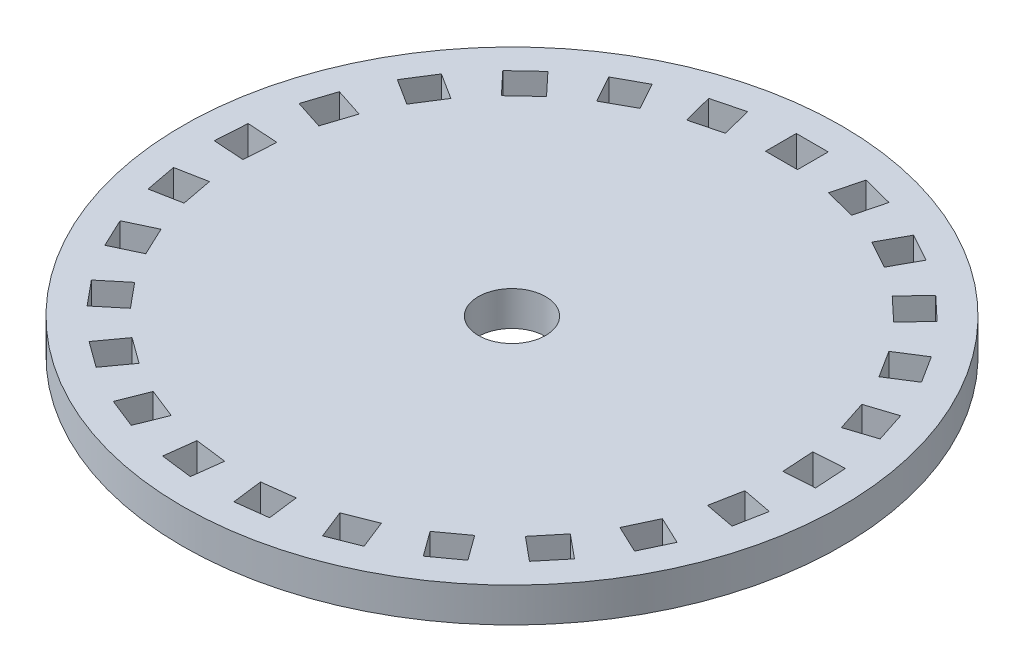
ISO-10303-21;
HEADER;
FILE_DESCRIPTION(('STEP AP214'),'2;1');
FILE_NAME('part.step','',(''),(''),'','','');
FILE_SCHEMA(('AUTOMOTIVE_DESIGN { 1 0 10303 214 1 1 1 1 }'));
ENDSEC;
DATA;
#1=APPLICATION_CONTEXT('core data for automotive mechanical design processes');
#2=APPLICATION_PROTOCOL_DEFINITION('international standard','automotive_design',2000,#1);
#3=PRODUCT_CONTEXT('',#1,'mechanical');
#4=PRODUCT('Part','Part','',(#3));
#5=PRODUCT_RELATED_PRODUCT_CATEGORY('part','',(#4));
#6=PRODUCT_DEFINITION_FORMATION('','',#4);
#7=PRODUCT_DEFINITION_CONTEXT('part definition',#1,'design');
#8=PRODUCT_DEFINITION('design','',#6,#7);
#9=PRODUCT_DEFINITION_SHAPE('','',#8);
#10=(LENGTH_UNIT() NAMED_UNIT(*) SI_UNIT(.MILLI.,.METRE.));
#11=(NAMED_UNIT(*) PLANE_ANGLE_UNIT() SI_UNIT($,.RADIAN.));
#12=(NAMED_UNIT(*) SI_UNIT($,.STERADIAN.) SOLID_ANGLE_UNIT());
#13=UNCERTAINTY_MEASURE_WITH_UNIT(LENGTH_MEASURE(1.E-05),#10,'distance_accuracy_value','');
#14=(GEOMETRIC_REPRESENTATION_CONTEXT(3) GLOBAL_UNCERTAINTY_ASSIGNED_CONTEXT((#13)) GLOBAL_UNIT_ASSIGNED_CONTEXT((#10,
#11,#12)) REPRESENTATION_CONTEXT('',''));
#15=CARTESIAN_POINT('',(0.,0.,0.));
#16=DIRECTION('',(0.,0.,1.));
#17=DIRECTION('',(1.,0.,0.));
#18=AXIS2_PLACEMENT_3D('',#15,#16,#17);
#19=CARTESIAN_POINT('',(0.,2.9972,0.));
#20=DIRECTION('',(0.,1.,0.));
#21=DIRECTION('',(0.,0.,1.));
#22=AXIS2_PLACEMENT_3D('',#19,#20,#21);
#23=PLANE('',#22);
#24=DIRECTION('',(-0.876306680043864,0.,0.481753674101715));
#25=VECTOR('',#24,1.);
#26=CARTESIAN_POINT('',(-13.7555282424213,2.9972,-22.1477528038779));
#27=LINE('',#26,#25);
#28=CARTESIAN_POINT('',(-11.3293855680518,2.9972,-23.4815360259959));
#29=VERTEX_POINT('',#28);
#30=CARTESIAN_POINT('',(-13.7555282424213,2.9972,-22.1477528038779));
#31=VERTEX_POINT('',#30);
#32=EDGE_CURVE('E688',#29,#31,#27,.T.);
#33=ORIENTED_EDGE('',*,*,#32,.F.);
#34=DIRECTION('',(-0.481753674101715,0.,-0.876306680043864));
#35=VECTOR('',#34,1.);
#36=CARTESIAN_POINT('',(-10.0445485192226,2.9972,-21.1444261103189));
#37=LINE('',#36,#35);
#38=CARTESIAN_POINT('',(-10.0445485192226,2.9972,-21.1444261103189));
#39=VERTEX_POINT('',#38);
#40=EDGE_CURVE('E686',#39,#29,#37,.T.);
#41=ORIENTED_EDGE('',*,*,#40,.F.);
#42=DIRECTION('',(0.876306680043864,0.,-0.481753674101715));
#43=VECTOR('',#42,1.);
#44=CARTESIAN_POINT('',(-12.470691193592,2.9972,-19.8106428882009));
#45=LINE('',#44,#43);
#46=CARTESIAN_POINT('',(-12.470691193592,2.9972,-19.8106428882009));
#47=VERTEX_POINT('',#46);
#48=EDGE_CURVE('E694',#47,#39,#45,.T.);
#49=ORIENTED_EDGE('',*,*,#48,.F.);
#50=DIRECTION('',(0.481753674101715,0.,0.876306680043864));
#51=VECTOR('',#50,1.);
#52=CARTESIAN_POINT('',(-12.470691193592,2.9972,-19.8106428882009));
#53=LINE('',#52,#51);
#54=EDGE_CURVE('E691',#31,#47,#53,.T.);
#55=ORIENTED_EDGE('',*,*,#54,.F.);
#56=EDGE_LOOP('',(#33,#41,#49,#55));
#57=FACE_BOUND('',#56,.T.);
#58=DIRECTION('',(-0.535826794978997,0.,0.844327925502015));
#59=VECTOR('',#58,1.);
#60=CARTESIAN_POINT('',(-22.7238225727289,2.9972,-12.781447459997));
#61=LINE('',#60,#59);
#62=CARTESIAN_POINT('',(-21.2403325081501,2.9972,-15.1190537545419));
#63=VERTEX_POINT('',#62);
#64=CARTESIAN_POINT('',(-22.7238225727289,2.9972,-12.781447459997));
#65=VERTEX_POINT('',#64);
#66=EDGE_CURVE('E750',#63,#65,#61,.T.);
#67=ORIENTED_EDGE('',*,*,#66,.F.);
#68=DIRECTION('',(-0.844327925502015,0.,-0.535826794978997));
#69=VECTOR('',#68,1.);
#70=CARTESIAN_POINT('',(-18.9885099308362,2.9972,-13.6900036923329));
#71=LINE('',#70,#69);
#72=CARTESIAN_POINT('',(-18.9885099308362,2.9972,-13.6900036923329));
#73=VERTEX_POINT('',#72);
#74=EDGE_CURVE('E748',#73,#63,#71,.T.);
#75=ORIENTED_EDGE('',*,*,#74,.F.);
#76=DIRECTION('',(0.535826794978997,0.,-0.844327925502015));
#77=VECTOR('',#76,1.);
#78=CARTESIAN_POINT('',(-20.4719999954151,2.9972,-11.352397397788));
#79=LINE('',#78,#77);
#80=CARTESIAN_POINT('',(-20.4719999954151,2.9972,-11.352397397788));
#81=VERTEX_POINT('',#80);
#82=EDGE_CURVE('E756',#81,#73,#79,.T.);
#83=ORIENTED_EDGE('',*,*,#82,.F.);
#84=DIRECTION('',(0.844327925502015,0.,0.535826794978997));
#85=VECTOR('',#84,1.);
#86=CARTESIAN_POINT('',(-20.4719999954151,2.9972,-11.352397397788));
#87=LINE('',#86,#85);
#88=EDGE_CURVE('E753',#65,#81,#87,.T.);
#89=ORIENTED_EDGE('',*,*,#88,.F.);
#90=EDGE_LOOP('',(#67,#75,#83,#89));
#91=FACE_BOUND('',#90,.T.);
#92=DIRECTION('',(-0.0627905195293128,0.,0.998026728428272));
#93=VECTOR('',#92,1.);
#94=CARTESIAN_POINT('',(-26.0705467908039,2.9972,-0.253182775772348));
#95=LINE('',#94,#93);
#96=CARTESIAN_POINT('',(-25.896704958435,2.9972,-3.01631957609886));
#97=VERTEX_POINT('',#96);
#98=CARTESIAN_POINT('',(-26.0705467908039,2.9972,-0.253182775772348));
#99=VERTEX_POINT('',#98);
#100=EDGE_CURVE('E812',#97,#99,#95,.T.);
#101=ORIENTED_EDGE('',*,*,#100,.F.);
#102=DIRECTION('',(-0.998026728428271,0.,-0.0627905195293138));
#103=VECTOR('',#102,1.);
#104=CARTESIAN_POINT('',(-23.2349676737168,2.9972,-2.84885726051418));
#105=LINE('',#104,#103);
#106=CARTESIAN_POINT('',(-23.2349676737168,2.9972,-2.84885726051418));
#107=VERTEX_POINT('',#106);
#108=EDGE_CURVE('E810',#107,#97,#105,.T.);
#109=ORIENTED_EDGE('',*,*,#108,.F.);
#110=DIRECTION('',(0.0627905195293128,0.,-0.998026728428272));
#111=VECTOR('',#110,1.);
#112=CARTESIAN_POINT('',(-23.4088095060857,2.9972,-0.0857204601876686));
#113=LINE('',#112,#111);
#114=CARTESIAN_POINT('',(-23.4088095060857,2.9972,-0.0857204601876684));
#115=VERTEX_POINT('',#114);
#116=EDGE_CURVE('E818',#115,#107,#113,.T.);
#117=ORIENTED_EDGE('',*,*,#116,.F.);
#118=DIRECTION('',(0.998026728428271,0.,0.0627905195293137));
#119=VECTOR('',#118,1.);
#120=CARTESIAN_POINT('',(-23.4088095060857,2.9972,-0.0857204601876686));
#121=LINE('',#120,#119);
#122=EDGE_CURVE('E815',#99,#115,#121,.T.);
#123=ORIENTED_EDGE('',*,*,#122,.F.);
#124=EDGE_LOOP('',(#101,#109,#117,#123));
#125=FACE_BOUND('',#124,.T.);
#126=DIRECTION('',(0.425779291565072,0.,0.90482705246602));
#127=VECTOR('',#126,1.);
#128=CARTESIAN_POINT('',(-22.9677660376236,2.9972,12.3377159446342));
#129=LINE('',#128,#127);
#130=CARTESIAN_POINT('',(-24.1465785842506,2.9972,9.83261176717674));
#131=VERTEX_POINT('',#130);
#132=CARTESIAN_POINT('',(-22.9677660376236,2.9972,12.3377159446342));
#133=VERTEX_POINT('',#132);
#134=EDGE_CURVE('E874',#131,#133,#129,.T.);
#135=ORIENTED_EDGE('',*,*,#134,.F.);
#136=DIRECTION('',(-0.90482705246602,0.,0.425779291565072));
#137=VECTOR('',#136,1.);
#138=CARTESIAN_POINT('',(-21.7334048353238,2.9972,8.69705839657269));
#139=LINE('',#138,#137);
#140=CARTESIAN_POINT('',(-21.7334048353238,2.9972,8.69705839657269));
#141=VERTEX_POINT('',#140);
#142=EDGE_CURVE('E872',#141,#131,#139,.T.);
#143=ORIENTED_EDGE('',*,*,#142,.F.);
#144=DIRECTION('',(-0.425779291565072,0.,-0.90482705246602));
#145=VECTOR('',#144,1.);
#146=CARTESIAN_POINT('',(-20.5545922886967,2.9972,11.2021625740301));
#147=LINE('',#146,#145);
#148=CARTESIAN_POINT('',(-20.5545922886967,2.9972,11.2021625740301));
#149=VERTEX_POINT('',#148);
#150=EDGE_CURVE('E880',#149,#141,#147,.T.);
#151=ORIENTED_EDGE('',*,*,#150,.F.);
#152=DIRECTION('',(0.90482705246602,0.,-0.425779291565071));
#153=VECTOR('',#152,1.);
#154=CARTESIAN_POINT('',(-20.5545922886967,2.9972,11.2021625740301));
#155=LINE('',#154,#153);
#156=EDGE_CURVE('E877',#133,#149,#155,.T.);
#157=ORIENTED_EDGE('',*,*,#156,.F.);
#158=EDGE_LOOP('',(#135,#143,#151,#157));
#159=FACE_BOUND('',#158,.T.);
#160=DIRECTION('',(0.809016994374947,0.,0.587785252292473));
#161=VECTOR('',#160,1.);
#162=CARTESIAN_POINT('',(-14.1830668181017,2.9972,21.8764285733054));
#163=LINE('',#162,#161);
#164=CARTESIAN_POINT('',(-16.4229112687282,2.9972,20.2490863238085));
#165=VERTEX_POINT('',#164);
#166=CARTESIAN_POINT('',(-14.1830668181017,2.9972,21.8764285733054));
#167=VERTEX_POINT('',#166);
#168=EDGE_CURVE('E936',#165,#167,#163,.T.);
#169=ORIENTED_EDGE('',*,*,#168,.F.);
#170=DIRECTION('',(-0.587785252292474,0.,0.809016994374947));
#171=VECTOR('',#170,1.);
#172=CARTESIAN_POINT('',(-14.8552880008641,2.9972,18.0914379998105));
#173=LINE('',#172,#171);
#174=CARTESIAN_POINT('',(-14.8552880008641,2.9972,18.0914379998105));
#175=VERTEX_POINT('',#174);
#176=EDGE_CURVE('E934',#175,#165,#173,.T.);
#177=ORIENTED_EDGE('',*,*,#176,.F.);
#178=DIRECTION('',(-0.809016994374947,0.,-0.587785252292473));
#179=VECTOR('',#178,1.);
#180=CARTESIAN_POINT('',(-12.6154435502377,2.9972,19.7187802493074));
#181=LINE('',#180,#179);
#182=CARTESIAN_POINT('',(-12.6154435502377,2.9972,19.7187802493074));
#183=VERTEX_POINT('',#182);
#184=EDGE_CURVE('E942',#183,#175,#181,.T.);
#185=ORIENTED_EDGE('',*,*,#184,.F.);
#186=DIRECTION('',(0.587785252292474,0.,-0.809016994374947));
#187=VECTOR('',#186,1.);
#188=CARTESIAN_POINT('',(-12.6154435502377,2.9972,19.7187802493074));
#189=LINE('',#188,#187);
#190=EDGE_CURVE('E939',#167,#183,#189,.T.);
#191=ORIENTED_EDGE('',*,*,#190,.F.);
#192=EDGE_LOOP('',(#169,#177,#185,#191));
#193=FACE_BOUND('',#192,.T.);
#194=DIRECTION('',(0.992114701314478,0.,0.125333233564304));
#195=VECTOR('',#194,1.);
#196=CARTESIAN_POINT('',(-1.88966635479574,2.9972,26.0032050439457));
#197=LINE('',#196,#195);
#198=CARTESIAN_POINT('',(-4.636435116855,2.9972,25.6562074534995));
#199=VERTEX_POINT('',#198);
#200=CARTESIAN_POINT('',(-1.88966635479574,2.9972,26.0032050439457));
#201=VERTEX_POINT('',#200);
#202=EDGE_CURVE('E998',#199,#201,#197,.T.);
#203=ORIENTED_EDGE('',*,*,#202,.F.);
#204=DIRECTION('',(-0.125333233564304,0.,0.992114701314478));
#205=VECTOR('',#204,1.);
#206=CARTESIAN_POINT('',(-4.302171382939,2.9972,23.0102375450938));
#207=LINE('',#206,#205);
#208=CARTESIAN_POINT('',(-4.302171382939,2.9972,23.0102375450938));
#209=VERTEX_POINT('',#208);
#210=EDGE_CURVE('E996',#209,#199,#207,.T.);
#211=ORIENTED_EDGE('',*,*,#210,.F.);
#212=DIRECTION('',(-0.992114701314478,0.,-0.125333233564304));
#213=VECTOR('',#212,1.);
#214=CARTESIAN_POINT('',(-1.55540262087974,2.9972,23.3572351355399));
#215=LINE('',#214,#213);
#216=CARTESIAN_POINT('',(-1.55540262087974,2.9972,23.3572351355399));
#217=VERTEX_POINT('',#216);
#218=EDGE_CURVE('E1004',#217,#209,#215,.T.);
#219=ORIENTED_EDGE('',*,*,#218,.F.);
#220=DIRECTION('',(0.125333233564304,0.,-0.992114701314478));
#221=VECTOR('',#220,1.);
#222=CARTESIAN_POINT('',(-1.55540262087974,2.9972,23.3572351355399));
#223=LINE('',#222,#221);
#224=EDGE_CURVE('E1001',#201,#217,#223,.T.);
#225=ORIENTED_EDGE('',*,*,#224,.F.);
#226=EDGE_LOOP('',(#203,#211,#219,#225));
#227=FACE_BOUND('',#226,.T.);
#228=DIRECTION('',(0.929776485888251,0.,-0.368124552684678));
#229=VECTOR('',#228,1.);
#230=CARTESIAN_POINT('',(10.871212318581,2.9972,23.6971359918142));
#231=LINE('',#230,#229);
#232=CARTESIAN_POINT('',(8.29703313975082,2.9972,24.716325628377));
#233=VERTEX_POINT('',#232);
#234=CARTESIAN_POINT('',(10.871212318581,2.9972,23.6971359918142));
#235=VERTEX_POINT('',#234);
#236=EDGE_CURVE('E1060',#233,#235,#231,.T.);
#237=ORIENTED_EDGE('',*,*,#236,.F.);
#238=DIRECTION('',(0.368124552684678,0.,0.929776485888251));
#239=VECTOR('',#238,1.);
#240=CARTESIAN_POINT('',(7.31524495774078,2.9972,22.236611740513));
#241=LINE('',#240,#239);
#242=CARTESIAN_POINT('',(7.31524495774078,2.9972,22.236611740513));
#243=VERTEX_POINT('',#242);
#244=EDGE_CURVE('E1058',#243,#233,#241,.T.);
#245=ORIENTED_EDGE('',*,*,#244,.F.);
#246=DIRECTION('',(-0.929776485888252,0.,0.368124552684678));
#247=VECTOR('',#246,1.);
#248=CARTESIAN_POINT('',(9.88942413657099,2.9972,21.2174221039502));
#249=LINE('',#248,#247);
#250=CARTESIAN_POINT('',(9.88942413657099,2.9972,21.2174221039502));
#251=VERTEX_POINT('',#250);
#252=EDGE_CURVE('E1066',#251,#243,#249,.T.);
#253=ORIENTED_EDGE('',*,*,#252,.F.);
#254=DIRECTION('',(-0.368124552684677,0.,-0.929776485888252));
#255=VECTOR('',#254,1.);
#256=CARTESIAN_POINT('',(9.88942413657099,2.9972,21.2174221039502));
#257=LINE('',#256,#255);
#258=EDGE_CURVE('E1063',#235,#251,#257,.T.);
#259=ORIENTED_EDGE('',*,*,#258,.F.);
#260=EDGE_LOOP('',(#237,#245,#253,#259));
#261=FACE_BOUND('',#260,.T.);
#262=DIRECTION('',(0.637423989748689,0.,-0.77051324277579));
#263=VECTOR('',#262,1.);
#264=CARTESIAN_POINT('',(20.9426983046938,2.9972,15.5287120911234));
#265=LINE('',#264,#263);
#266=CARTESIAN_POINT('',(19.1779262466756,2.9972,17.6619550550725));
#267=VERTEX_POINT('',#266);
#268=CARTESIAN_POINT('',(20.9426983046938,2.9972,15.5287120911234));
#269=VERTEX_POINT('',#268);
#270=EDGE_CURVE('E1122',#267,#269,#265,.T.);
#271=ORIENTED_EDGE('',*,*,#270,.F.);
#272=DIRECTION('',(0.770513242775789,0.,0.63742398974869));
#273=VECTOR('',#272,1.);
#274=CARTESIAN_POINT('',(17.1229674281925,2.9972,15.9619452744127));
#275=LINE('',#274,#273);
#276=CARTESIAN_POINT('',(17.1229674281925,2.9972,15.9619452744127));
#277=VERTEX_POINT('',#276);
#278=EDGE_CURVE('E1120',#277,#267,#275,.T.);
#279=ORIENTED_EDGE('',*,*,#278,.F.);
#280=DIRECTION('',(-0.637423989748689,0.,0.77051324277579));
#281=VECTOR('',#280,1.);
#282=CARTESIAN_POINT('',(18.8877394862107,2.9972,13.8287023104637));
#283=LINE('',#282,#281);
#284=CARTESIAN_POINT('',(18.8877394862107,2.9972,13.8287023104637));
#285=VERTEX_POINT('',#284);
#286=EDGE_CURVE('E1128',#285,#277,#283,.T.);
#287=ORIENTED_EDGE('',*,*,#286,.F.);
#288=DIRECTION('',(-0.770513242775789,0.,-0.63742398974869));
#289=VECTOR('',#288,1.);
#290=CARTESIAN_POINT('',(18.8877394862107,2.9972,13.8287023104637));
#291=LINE('',#290,#289);
#292=EDGE_CURVE('E1125',#269,#285,#291,.T.);
#293=ORIENTED_EDGE('',*,*,#292,.F.);
#294=EDGE_LOOP('',(#271,#279,#287,#293));
#295=FACE_BOUND('',#294,.T.);
#296=DIRECTION('',(0.187381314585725,0.,-0.982287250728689));
#297=VECTOR('',#296,1.);
#298=CARTESIAN_POINT('',(25.8332405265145,2.9972,3.51869228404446));
#299=LINE('',#298,#297);
#300=CARTESIAN_POINT('',(25.3144566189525,2.9972,6.23825276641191));
#301=VERTEX_POINT('',#300);
#302=CARTESIAN_POINT('',(25.8332405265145,2.9972,3.51869228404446));
#303=VERTEX_POINT('',#302);
#304=EDGE_CURVE('E1184',#301,#303,#299,.T.);
#305=ORIENTED_EDGE('',*,*,#304,.F.);
#306=DIRECTION('',(0.982287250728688,0.,0.187381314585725));
#307=VECTOR('',#306,1.);
#308=CARTESIAN_POINT('',(22.694696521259,2.9972,5.73850680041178));
#309=LINE('',#308,#307);
#310=CARTESIAN_POINT('',(22.694696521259,2.9972,5.73850680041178));
#311=VERTEX_POINT('',#310);
#312=EDGE_CURVE('E1182',#311,#301,#309,.T.);
#313=ORIENTED_EDGE('',*,*,#312,.F.);
#314=DIRECTION('',(-0.187381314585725,0.,0.982287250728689));
#315=VECTOR('',#314,1.);
#316=CARTESIAN_POINT('',(23.2134804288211,2.9972,3.01894631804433));
#317=LINE('',#316,#315);
#318=CARTESIAN_POINT('',(23.2134804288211,2.9972,3.01894631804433));
#319=VERTEX_POINT('',#318);
#320=EDGE_CURVE('E1190',#319,#311,#317,.T.);
#321=ORIENTED_EDGE('',*,*,#320,.F.);
#322=DIRECTION('',(-0.982287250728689,0.,-0.187381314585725));
#323=VECTOR('',#322,1.);
#324=CARTESIAN_POINT('',(23.2134804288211,2.9972,3.01894631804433));
#325=LINE('',#324,#323);
#326=EDGE_CURVE('E1187',#303,#319,#325,.T.);
#327=ORIENTED_EDGE('',*,*,#326,.F.);
#328=EDGE_LOOP('',(#305,#313,#321,#327));
#329=FACE_BOUND('',#328,.T.);
#330=DIRECTION('',(-0.309016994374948,0.,-0.951056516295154));
#331=VECTOR('',#330,1.);
#332=CARTESIAN_POINT('',(24.3329841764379,2.9972,-9.36180498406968));
#333=LINE('',#332,#331);
#334=CARTESIAN_POINT('',(25.1885286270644,2.9972,-6.72870991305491));
#335=VERTEX_POINT('',#334);
#336=CARTESIAN_POINT('',(24.3329841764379,2.9972,-9.36180498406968));
#337=VERTEX_POINT('',#336);
#338=EDGE_CURVE('E1246',#335,#337,#333,.T.);
#339=ORIENTED_EDGE('',*,*,#338,.F.);
#340=DIRECTION('',(0.951056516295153,0.,-0.309016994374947));
#341=VECTOR('',#340,1.);
#342=CARTESIAN_POINT('',(22.6520608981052,2.9972,-5.90456158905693));
#343=LINE('',#342,#341);
#344=CARTESIAN_POINT('',(22.6520608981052,2.9972,-5.90456158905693));
#345=VERTEX_POINT('',#344);
#346=EDGE_CURVE('E1244',#345,#335,#343,.T.);
#347=ORIENTED_EDGE('',*,*,#346,.F.);
#348=DIRECTION('',(0.309016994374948,0.,0.951056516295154));
#349=VECTOR('',#348,1.);
#350=CARTESIAN_POINT('',(21.7965164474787,2.9972,-8.53765666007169));
#351=LINE('',#350,#349);
#352=CARTESIAN_POINT('',(21.7965164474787,2.9972,-8.53765666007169));
#353=VERTEX_POINT('',#352);
#354=EDGE_CURVE('E1252',#353,#345,#351,.T.);
#355=ORIENTED_EDGE('',*,*,#354,.F.);
#356=DIRECTION('',(-0.951056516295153,0.,0.309016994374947));
#357=VECTOR('',#356,1.);
#358=CARTESIAN_POINT('',(21.7965164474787,2.9972,-8.53765666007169));
#359=LINE('',#358,#357);
#360=EDGE_CURVE('E1249',#337,#353,#359,.T.);
#361=ORIENTED_EDGE('',*,*,#360,.F.);
#362=EDGE_LOOP('',(#339,#347,#355,#361));
#363=FACE_BOUND('',#362,.T.);
#364=DIRECTION('',(-0.728968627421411,0.,-0.684547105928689));
#365=VECTOR('',#364,1.);
#366=CARTESIAN_POINT('',(16.8130726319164,2.9972,-19.926316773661));
#367=LINE('',#366,#365);
#368=CARTESIAN_POINT('',(18.8312951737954,2.9972,-18.0310796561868));
#369=VERTEX_POINT('',#368);
#370=CARTESIAN_POINT('',(16.8130726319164,2.9972,-19.926316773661));
#371=VERTEX_POINT('',#370);
#372=EDGE_CURVE('E1308',#369,#371,#367,.T.);
#373=ORIENTED_EDGE('',*,*,#372,.F.);
#374=DIRECTION('',(0.68454710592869,0.,-0.728968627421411));
#375=VECTOR('',#374,1.);
#376=CARTESIAN_POINT('',(17.0056080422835,2.9972,-16.0869203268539));
#377=LINE('',#376,#375);
#378=CARTESIAN_POINT('',(17.0056080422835,2.9972,-16.0869203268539));
#379=VERTEX_POINT('',#378);
#380=EDGE_CURVE('E1306',#379,#369,#377,.T.);
#381=ORIENTED_EDGE('',*,*,#380,.F.);
#382=DIRECTION('',(0.728968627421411,0.,0.684547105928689));
#383=VECTOR('',#382,1.);
#384=CARTESIAN_POINT('',(14.9873855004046,2.9972,-17.9821574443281));
#385=LINE('',#384,#383);
#386=CARTESIAN_POINT('',(14.9873855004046,2.9972,-17.9821574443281));
#387=VERTEX_POINT('',#386);
#388=EDGE_CURVE('E1314',#387,#379,#385,.T.);
#389=ORIENTED_EDGE('',*,*,#388,.F.);
#390=DIRECTION('',(-0.68454710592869,0.,0.728968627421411));
#391=VECTOR('',#390,1.);
#392=CARTESIAN_POINT('',(14.9873855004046,2.9972,-17.9821574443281));
#393=LINE('',#392,#391);
#394=EDGE_CURVE('E1311',#371,#387,#393,.T.);
#395=ORIENTED_EDGE('',*,*,#394,.F.);
#396=EDGE_LOOP('',(#373,#381,#389,#395));
#397=FACE_BOUND('',#396,.T.);
#398=DIRECTION('',(-0.968583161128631,0.,-0.248689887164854));
#399=VECTOR('',#398,1.);
#400=CARTESIAN_POINT('',(5.13383154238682,2.9972,-25.5613240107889));
#401=LINE('',#400,#399);
#402=CARTESIAN_POINT('',(7.81545088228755,2.9972,-24.8728011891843));
#403=VERTEX_POINT('',#402);
#404=CARTESIAN_POINT('',(5.13383154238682,2.9972,-25.5613240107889));
#405=VERTEX_POINT('',#404);
#406=EDGE_CURVE('E1370',#403,#405,#401,.T.);
#407=ORIENTED_EDGE('',*,*,#406,.F.);
#408=DIRECTION('',(0.248689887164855,0.,-0.968583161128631));
#409=VECTOR('',#408,1.);
#410=CARTESIAN_POINT('',(7.15219495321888,2.9972,-22.2895898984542));
#411=LINE('',#410,#409);
#412=CARTESIAN_POINT('',(7.15219495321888,2.9972,-22.2895898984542));
#413=VERTEX_POINT('',#412);
#414=EDGE_CURVE('E1368',#413,#403,#411,.T.);
#415=ORIENTED_EDGE('',*,*,#414,.F.);
#416=DIRECTION('',(0.968583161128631,0.,0.248689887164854));
#417=VECTOR('',#416,1.);
#418=CARTESIAN_POINT('',(4.47057561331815,2.9972,-22.9781127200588));
#419=LINE('',#418,#417);
#420=CARTESIAN_POINT('',(4.47057561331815,2.9972,-22.9781127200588));
#421=VERTEX_POINT('',#420);
#422=EDGE_CURVE('E1376',#421,#413,#419,.T.);
#423=ORIENTED_EDGE('',*,*,#422,.F.);
#424=DIRECTION('',(-0.248689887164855,0.,0.968583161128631));
#425=VECTOR('',#424,1.);
#426=CARTESIAN_POINT('',(4.47057561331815,2.9972,-22.9781127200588));
#427=LINE('',#426,#425);
#428=EDGE_CURVE('E1373',#405,#421,#427,.T.);
#429=ORIENTED_EDGE('',*,*,#428,.F.);
#430=EDGE_LOOP('',(#407,#415,#423,#429));
#431=FACE_BOUND('',#430,.T.);
#432=CARTESIAN_POINT('',(0.,2.9972,0.));
#433=DIRECTION('',(0.,1.,0.));
#434=DIRECTION('',(0.,0.,1.));
#435=AXIS2_PLACEMENT_3D('',#432,#433,#434);
#436=CIRCLE('',#435,2.921);
#437=CARTESIAN_POINT('',(0.,2.9972,-2.921));
#438=VERTEX_POINT('',#437);
#439=EDGE_CURVE('E1430',#438,#438,#436,.T.);
#440=ORIENTED_EDGE('',*,*,#439,.F.);
#441=EDGE_LOOP('',(#440));
#442=FACE_BOUND('',#441,.T.);
#443=CARTESIAN_POINT('',(0.,2.9972,0.));
#444=DIRECTION('',(0.,1.,0.));
#445=DIRECTION('',(0.,0.,1.));
#446=AXIS2_PLACEMENT_3D('',#443,#444,#445);
#447=CIRCLE('',#446,28.575);
#448=CARTESIAN_POINT('',(0.,2.9972,-28.575));
#449=VERTEX_POINT('',#448);
#450=EDGE_CURVE('E11',#449,#449,#447,.T.);
#451=ORIENTED_EDGE('',*,*,#450,.T.);
#452=EDGE_LOOP('',(#451));
#453=FACE_BOUND('',#452,.T.);
#454=DIRECTION('',(-1.,0.,0.));
#455=VECTOR('',#454,1.);
#456=CARTESIAN_POINT('',(-1.3843,2.9972,-26.035));
#457=LINE('',#456,#455);
#458=CARTESIAN_POINT('',(1.3843,2.9972,-26.035));
#459=VERTEX_POINT('',#458);
#460=CARTESIAN_POINT('',(-1.3843,2.9972,-26.035));
#461=VERTEX_POINT('',#460);
#462=EDGE_CURVE('E1401',#459,#461,#457,.T.);
#463=ORIENTED_EDGE('',*,*,#462,.F.);
#464=DIRECTION('',(0.,0.,-1.));
#465=VECTOR('',#464,1.);
#466=CARTESIAN_POINT('',(1.3843,2.9972,-23.368));
#467=LINE('',#466,#465);
#468=CARTESIAN_POINT('',(1.3843,2.9972,-23.368));
#469=VERTEX_POINT('',#468);
#470=EDGE_CURVE('E1399',#469,#459,#467,.T.);
#471=ORIENTED_EDGE('',*,*,#470,.F.);
#472=DIRECTION('',(1.,0.,0.));
#473=VECTOR('',#472,1.);
#474=CARTESIAN_POINT('',(-1.3843,2.9972,-23.368));
#475=LINE('',#474,#473);
#476=CARTESIAN_POINT('',(-1.3843,2.9972,-23.368));
#477=VERTEX_POINT('',#476);
#478=EDGE_CURVE('E1407',#477,#469,#475,.T.);
#479=ORIENTED_EDGE('',*,*,#478,.F.);
#480=DIRECTION('',(0.,0.,1.));
#481=VECTOR('',#480,1.);
#482=CARTESIAN_POINT('',(-1.3843,2.9972,-23.368));
#483=LINE('',#482,#481);
#484=EDGE_CURVE('E1404',#461,#477,#483,.T.);
#485=ORIENTED_EDGE('',*,*,#484,.F.);
#486=EDGE_LOOP('',(#463,#471,#479,#485));
#487=FACE_BOUND('',#486,.T.);
#488=DIRECTION('',(-0.876306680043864,0.,-0.481753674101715));
#489=VECTOR('',#488,1.);
#490=CARTESIAN_POINT('',(11.3293855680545,2.9972,-23.4815360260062));
#491=LINE('',#490,#489);
#492=CARTESIAN_POINT('',(13.7555282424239,2.9972,-22.1477528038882));
#493=VERTEX_POINT('',#492);
#494=CARTESIAN_POINT('',(11.3293855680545,2.9972,-23.4815360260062));
#495=VERTEX_POINT('',#494);
#496=EDGE_CURVE('E1339',#493,#495,#491,.T.);
#497=ORIENTED_EDGE('',*,*,#496,.F.);
#498=DIRECTION('',(0.481753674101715,0.,-0.876306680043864));
#499=VECTOR('',#498,1.);
#500=CARTESIAN_POINT('',(12.4706911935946,2.9972,-19.8106428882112));
#501=LINE('',#500,#499);
#502=CARTESIAN_POINT('',(12.4706911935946,2.9972,-19.8106428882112));
#503=VERTEX_POINT('',#502);
#504=EDGE_CURVE('E1337',#503,#493,#501,.T.);
#505=ORIENTED_EDGE('',*,*,#504,.F.);
#506=DIRECTION('',(0.876306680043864,0.,0.481753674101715));
#507=VECTOR('',#506,1.);
#508=CARTESIAN_POINT('',(10.0445485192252,2.9972,-21.1444261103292));
#509=LINE('',#508,#507);
#510=CARTESIAN_POINT('',(10.0445485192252,2.9972,-21.1444261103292));
#511=VERTEX_POINT('',#510);
#512=EDGE_CURVE('E1345',#511,#503,#509,.T.);
#513=ORIENTED_EDGE('',*,*,#512,.F.);
#514=DIRECTION('',(-0.481753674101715,0.,0.876306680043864));
#515=VECTOR('',#514,1.);
#516=CARTESIAN_POINT('',(10.0445485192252,2.9972,-21.1444261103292));
#517=LINE('',#516,#515);
#518=EDGE_CURVE('E1342',#495,#511,#517,.T.);
#519=ORIENTED_EDGE('',*,*,#518,.F.);
#520=EDGE_LOOP('',(#497,#505,#513,#519));
#521=FACE_BOUND('',#520,.T.);
#522=DIRECTION('',(-0.535826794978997,0.,-0.844327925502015));
#523=VECTOR('',#522,1.);
#524=CARTESIAN_POINT('',(21.24033250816,2.9972,-15.1190537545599));
#525=LINE('',#524,#523);
#526=CARTESIAN_POINT('',(22.7238225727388,2.9972,-12.781447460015));
#527=VERTEX_POINT('',#526);
#528=CARTESIAN_POINT('',(21.24033250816,2.9972,-15.1190537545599));
#529=VERTEX_POINT('',#528);
#530=EDGE_CURVE('E1277',#527,#529,#525,.T.);
#531=ORIENTED_EDGE('',*,*,#530,.F.);
#532=DIRECTION('',(0.844327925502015,0.,-0.535826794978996));
#533=VECTOR('',#532,1.);
#534=CARTESIAN_POINT('',(20.471999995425,2.9972,-11.352397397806));
#535=LINE('',#534,#533);
#536=CARTESIAN_POINT('',(20.471999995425,2.9972,-11.352397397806));
#537=VERTEX_POINT('',#536);
#538=EDGE_CURVE('E1275',#537,#527,#535,.T.);
#539=ORIENTED_EDGE('',*,*,#538,.F.);
#540=DIRECTION('',(0.535826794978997,0.,0.844327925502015));
#541=VECTOR('',#540,1.);
#542=CARTESIAN_POINT('',(18.9885099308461,2.9972,-13.6900036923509));
#543=LINE('',#542,#541);
#544=CARTESIAN_POINT('',(18.9885099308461,2.9972,-13.6900036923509));
#545=VERTEX_POINT('',#544);
#546=EDGE_CURVE('E1283',#545,#537,#543,.T.);
#547=ORIENTED_EDGE('',*,*,#546,.F.);
#548=DIRECTION('',(-0.844327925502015,0.,0.535826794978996));
#549=VECTOR('',#548,1.);
#550=CARTESIAN_POINT('',(18.9885099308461,2.9972,-13.6900036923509));
#551=LINE('',#550,#549);
#552=EDGE_CURVE('E1280',#529,#545,#551,.T.);
#553=ORIENTED_EDGE('',*,*,#552,.F.);
#554=EDGE_LOOP('',(#531,#539,#547,#553));
#555=FACE_BOUND('',#554,.T.);
#556=DIRECTION('',(-0.0627905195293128,0.,-0.998026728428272));
#557=VECTOR('',#556,1.);
#558=CARTESIAN_POINT('',(25.896704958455,2.9972,-3.01631957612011));
#559=LINE('',#558,#557);
#560=CARTESIAN_POINT('',(26.0705467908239,2.9972,-0.253182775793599));
#561=VERTEX_POINT('',#560);
#562=CARTESIAN_POINT('',(25.896704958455,2.9972,-3.01631957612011));
#563=VERTEX_POINT('',#562);
#564=EDGE_CURVE('E1215',#561,#563,#559,.T.);
#565=ORIENTED_EDGE('',*,*,#564,.F.);
#566=DIRECTION('',(0.998026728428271,0.,-0.0627905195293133));
#567=VECTOR('',#566,1.);
#568=CARTESIAN_POINT('',(23.4088095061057,2.9972,-0.0857204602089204));
#569=LINE('',#568,#567);
#570=CARTESIAN_POINT('',(23.4088095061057,2.9972,-0.0857204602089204));
#571=VERTEX_POINT('',#570);
#572=EDGE_CURVE('E1213',#571,#561,#569,.T.);
#573=ORIENTED_EDGE('',*,*,#572,.F.);
#574=DIRECTION('',(0.0627905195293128,0.,0.998026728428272));
#575=VECTOR('',#574,1.);
#576=CARTESIAN_POINT('',(23.2349676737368,2.9972,-2.84885726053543));
#577=LINE('',#576,#575);
#578=CARTESIAN_POINT('',(23.2349676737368,2.9972,-2.84885726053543));
#579=VERTEX_POINT('',#578);
#580=EDGE_CURVE('E1221',#579,#571,#577,.T.);
#581=ORIENTED_EDGE('',*,*,#580,.F.);
#582=DIRECTION('',(-0.998026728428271,0.,0.0627905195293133));
#583=VECTOR('',#582,1.);
#584=CARTESIAN_POINT('',(23.2349676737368,2.9972,-2.84885726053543));
#585=LINE('',#584,#583);
#586=EDGE_CURVE('E1218',#563,#579,#585,.T.);
#587=ORIENTED_EDGE('',*,*,#586,.F.);
#588=EDGE_LOOP('',(#565,#573,#581,#587));
#589=FACE_BOUND('',#588,.T.);
#590=DIRECTION('',(0.425779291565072,0.,-0.90482705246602));
#591=VECTOR('',#590,1.);
#592=CARTESIAN_POINT('',(24.146578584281,2.9972,9.83261176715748));
#593=LINE('',#592,#591);
#594=CARTESIAN_POINT('',(22.9677660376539,2.9972,12.3377159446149));
#595=VERTEX_POINT('',#594);
#596=CARTESIAN_POINT('',(24.146578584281,2.9972,9.83261176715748));
#597=VERTEX_POINT('',#596);
#598=EDGE_CURVE('E1153',#595,#597,#593,.T.);
#599=ORIENTED_EDGE('',*,*,#598,.F.);
#600=DIRECTION('',(0.90482705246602,0.,0.425779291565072));
#601=VECTOR('',#600,1.);
#602=CARTESIAN_POINT('',(20.5545922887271,2.9972,11.2021625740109));
#603=LINE('',#602,#601);
#604=CARTESIAN_POINT('',(20.5545922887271,2.9972,11.2021625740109));
#605=VERTEX_POINT('',#604);
#606=EDGE_CURVE('E1151',#605,#595,#603,.T.);
#607=ORIENTED_EDGE('',*,*,#606,.F.);
#608=DIRECTION('',(-0.425779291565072,0.,0.90482705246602));
#609=VECTOR('',#608,1.);
#610=CARTESIAN_POINT('',(21.7334048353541,2.9972,8.69705839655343));
#611=LINE('',#610,#609);
#612=CARTESIAN_POINT('',(21.7334048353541,2.9972,8.69705839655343));
#613=VERTEX_POINT('',#612);
#614=EDGE_CURVE('E1159',#613,#605,#611,.T.);
#615=ORIENTED_EDGE('',*,*,#614,.F.);
#616=DIRECTION('',(-0.90482705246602,0.,-0.425779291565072));
#617=VECTOR('',#616,1.);
#618=CARTESIAN_POINT('',(21.7334048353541,2.9972,8.69705839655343));
#619=LINE('',#618,#617);
#620=EDGE_CURVE('E1156',#597,#613,#619,.T.);
#621=ORIENTED_EDGE('',*,*,#620,.F.);
#622=EDGE_LOOP('',(#599,#607,#615,#621));
#623=FACE_BOUND('',#622,.T.);
#624=DIRECTION('',(0.809016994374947,0.,-0.587785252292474));
#625=VECTOR('',#624,1.);
#626=CARTESIAN_POINT('',(16.4229112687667,2.9972,20.249086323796));
#627=LINE('',#626,#625);
#628=CARTESIAN_POINT('',(14.1830668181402,2.9972,21.8764285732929));
#629=VERTEX_POINT('',#628);
#630=CARTESIAN_POINT('',(16.4229112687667,2.9972,20.249086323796));
#631=VERTEX_POINT('',#630);
#632=EDGE_CURVE('E1091',#629,#631,#627,.T.);
#633=ORIENTED_EDGE('',*,*,#632,.F.);
#634=DIRECTION('',(0.587785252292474,0.,0.809016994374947));
#635=VECTOR('',#634,1.);
#636=CARTESIAN_POINT('',(12.6154435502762,2.9972,19.7187802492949));
#637=LINE('',#636,#635);
#638=CARTESIAN_POINT('',(12.6154435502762,2.9972,19.7187802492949));
#639=VERTEX_POINT('',#638);
#640=EDGE_CURVE('E1089',#639,#629,#637,.T.);
#641=ORIENTED_EDGE('',*,*,#640,.F.);
#642=DIRECTION('',(-0.809016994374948,0.,0.587785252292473));
#643=VECTOR('',#642,1.);
#644=CARTESIAN_POINT('',(14.8552880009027,2.9972,18.091437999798));
#645=LINE('',#644,#643);
#646=CARTESIAN_POINT('',(14.8552880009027,2.9972,18.091437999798));
#647=VERTEX_POINT('',#646);
#648=EDGE_CURVE('E1097',#647,#639,#645,.T.);
#649=ORIENTED_EDGE('',*,*,#648,.F.);
#650=DIRECTION('',(-0.587785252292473,0.,-0.809016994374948));
#651=VECTOR('',#650,1.);
#652=CARTESIAN_POINT('',(14.8552880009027,2.9972,18.091437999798));
#653=LINE('',#652,#651);
#654=EDGE_CURVE('E1094',#631,#647,#653,.T.);
#655=ORIENTED_EDGE('',*,*,#654,.F.);
#656=EDGE_LOOP('',(#633,#641,#649,#655));
#657=FACE_BOUND('',#656,.T.);
#658=DIRECTION('',(0.992114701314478,0.,-0.125333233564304));
#659=VECTOR('',#658,1.);
#660=CARTESIAN_POINT('',(4.63643511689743,2.9972,25.6562074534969));
#661=LINE('',#660,#659);
#662=CARTESIAN_POINT('',(1.88966635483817,2.9972,26.003205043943));
#663=VERTEX_POINT('',#662);
#664=CARTESIAN_POINT('',(4.63643511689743,2.9972,25.6562074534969));
#665=VERTEX_POINT('',#664);
#666=EDGE_CURVE('E1029',#663,#665,#661,.T.);
#667=ORIENTED_EDGE('',*,*,#666,.F.);
#668=DIRECTION('',(0.125333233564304,0.,0.992114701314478));
#669=VECTOR('',#668,1.);
#670=CARTESIAN_POINT('',(1.55540262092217,2.9972,23.3572351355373));
#671=LINE('',#670,#669);
#672=CARTESIAN_POINT('',(1.55540262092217,2.9972,23.3572351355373));
#673=VERTEX_POINT('',#672);
#674=EDGE_CURVE('E1027',#673,#663,#671,.T.);
#675=ORIENTED_EDGE('',*,*,#674,.F.);
#676=DIRECTION('',(-0.992114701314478,0.,0.125333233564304));
#677=VECTOR('',#676,1.);
#678=CARTESIAN_POINT('',(4.30217138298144,2.9972,23.0102375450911));
#679=LINE('',#678,#677);
#680=CARTESIAN_POINT('',(4.30217138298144,2.9972,23.0102375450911));
#681=VERTEX_POINT('',#680);
#682=EDGE_CURVE('E1035',#681,#673,#679,.T.);
#683=ORIENTED_EDGE('',*,*,#682,.F.);
#684=DIRECTION('',(-0.125333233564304,0.,-0.992114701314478));
#685=VECTOR('',#684,1.);
#686=CARTESIAN_POINT('',(4.30217138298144,2.9972,23.0102375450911));
#687=LINE('',#686,#685);
#688=EDGE_CURVE('E1032',#665,#681,#687,.T.);
#689=ORIENTED_EDGE('',*,*,#688,.F.);
#690=EDGE_LOOP('',(#667,#675,#683,#689));
#691=FACE_BOUND('',#690,.T.);
#692=DIRECTION('',(0.929776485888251,0.,0.368124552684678));
#693=VECTOR('',#692,1.);
#694=CARTESIAN_POINT('',(-8.29703313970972,2.9972,24.7163256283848));
#695=LINE('',#694,#693);
#696=CARTESIAN_POINT('',(-10.8712123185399,2.9972,23.697135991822));
#697=VERTEX_POINT('',#696);
#698=CARTESIAN_POINT('',(-8.29703313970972,2.9972,24.7163256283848));
#699=VERTEX_POINT('',#698);
#700=EDGE_CURVE('E967',#697,#699,#695,.T.);
#701=ORIENTED_EDGE('',*,*,#700,.F.);
#702=DIRECTION('',(-0.368124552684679,0.,0.929776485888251));
#703=VECTOR('',#702,1.);
#704=CARTESIAN_POINT('',(-9.8894241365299,2.9972,21.217422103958));
#705=LINE('',#704,#703);
#706=CARTESIAN_POINT('',(-9.8894241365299,2.9972,21.217422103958));
#707=VERTEX_POINT('',#706);
#708=EDGE_CURVE('E965',#707,#697,#705,.T.);
#709=ORIENTED_EDGE('',*,*,#708,.F.);
#710=DIRECTION('',(-0.929776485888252,0.,-0.368124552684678));
#711=VECTOR('',#710,1.);
#712=CARTESIAN_POINT('',(-7.31524495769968,2.9972,22.2366117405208));
#713=LINE('',#712,#711);
#714=CARTESIAN_POINT('',(-7.31524495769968,2.9972,22.2366117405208));
#715=VERTEX_POINT('',#714);
#716=EDGE_CURVE('E973',#715,#707,#713,.T.);
#717=ORIENTED_EDGE('',*,*,#716,.F.);
#718=DIRECTION('',(0.368124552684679,0.,-0.929776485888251));
#719=VECTOR('',#718,1.);
#720=CARTESIAN_POINT('',(-7.31524495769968,2.9972,22.2366117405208));
#721=LINE('',#720,#719);
#722=EDGE_CURVE('E970',#699,#715,#721,.T.);
#723=ORIENTED_EDGE('',*,*,#722,.F.);
#724=EDGE_LOOP('',(#701,#709,#717,#723));
#725=FACE_BOUND('',#724,.T.);
#726=DIRECTION('',(0.63742398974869,0.,0.770513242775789));
#727=VECTOR('',#726,1.);
#728=CARTESIAN_POINT('',(-19.1779262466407,2.9972,17.6619550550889));
#729=LINE('',#728,#727);
#730=CARTESIAN_POINT('',(-20.9426983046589,2.9972,15.5287120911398));
#731=VERTEX_POINT('',#730);
#732=CARTESIAN_POINT('',(-19.1779262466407,2.9972,17.6619550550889));
#733=VERTEX_POINT('',#732);
#734=EDGE_CURVE('E905',#731,#733,#729,.T.);
#735=ORIENTED_EDGE('',*,*,#734,.F.);
#736=DIRECTION('',(-0.77051324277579,0.,0.637423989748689));
#737=VECTOR('',#736,1.);
#738=CARTESIAN_POINT('',(-18.8877394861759,2.9972,13.8287023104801));
#739=LINE('',#738,#737);
#740=CARTESIAN_POINT('',(-18.8877394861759,2.9972,13.8287023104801));
#741=VERTEX_POINT('',#740);
#742=EDGE_CURVE('E903',#741,#731,#739,.T.);
#743=ORIENTED_EDGE('',*,*,#742,.F.);
#744=DIRECTION('',(-0.637423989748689,0.,-0.77051324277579));
#745=VECTOR('',#744,1.);
#746=CARTESIAN_POINT('',(-17.1229674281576,2.9972,15.9619452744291));
#747=LINE('',#746,#745);
#748=CARTESIAN_POINT('',(-17.1229674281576,2.9972,15.9619452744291));
#749=VERTEX_POINT('',#748);
#750=EDGE_CURVE('E911',#749,#741,#747,.T.);
#751=ORIENTED_EDGE('',*,*,#750,.F.);
#752=DIRECTION('',(0.77051324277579,0.,-0.637423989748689));
#753=VECTOR('',#752,1.);
#754=CARTESIAN_POINT('',(-17.1229674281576,2.9972,15.9619452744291));
#755=LINE('',#754,#753);
#756=EDGE_CURVE('E908',#733,#749,#755,.T.);
#757=ORIENTED_EDGE('',*,*,#756,.F.);
#758=EDGE_LOOP('',(#735,#743,#751,#757));
#759=FACE_BOUND('',#758,.T.);
#760=DIRECTION('',(0.187381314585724,0.,0.982287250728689));
#761=VECTOR('',#760,1.);
#762=CARTESIAN_POINT('',(-25.3144566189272,2.9972,6.23825276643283));
#763=LINE('',#762,#761);
#764=CARTESIAN_POINT('',(-25.8332405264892,2.9972,3.51869228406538));
#765=VERTEX_POINT('',#764);
#766=CARTESIAN_POINT('',(-25.3144566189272,2.9972,6.23825276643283));
#767=VERTEX_POINT('',#766);
#768=EDGE_CURVE('E843',#765,#767,#763,.T.);
#769=ORIENTED_EDGE('',*,*,#768,.F.);
#770=DIRECTION('',(-0.982287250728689,0.,0.187381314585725));
#771=VECTOR('',#770,1.);
#772=CARTESIAN_POINT('',(-23.2134804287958,2.9972,3.01894631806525));
#773=LINE('',#772,#771);
#774=CARTESIAN_POINT('',(-23.2134804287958,2.9972,3.01894631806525));
#775=VERTEX_POINT('',#774);
#776=EDGE_CURVE('E841',#775,#765,#773,.T.);
#777=ORIENTED_EDGE('',*,*,#776,.F.);
#778=DIRECTION('',(-0.187381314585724,0.,-0.982287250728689));
#779=VECTOR('',#778,1.);
#780=CARTESIAN_POINT('',(-22.6946965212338,2.9972,5.7385068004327));
#781=LINE('',#780,#779);
#782=CARTESIAN_POINT('',(-22.6946965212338,2.9972,5.7385068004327));
#783=VERTEX_POINT('',#782);
#784=EDGE_CURVE('E849',#783,#775,#781,.T.);
#785=ORIENTED_EDGE('',*,*,#784,.F.);
#786=DIRECTION('',(0.982287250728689,0.,-0.187381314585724));
#787=VECTOR('',#786,1.);
#788=CARTESIAN_POINT('',(-22.6946965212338,2.9972,5.7385068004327));
#789=LINE('',#788,#787);
#790=EDGE_CURVE('E846',#767,#783,#789,.T.);
#791=ORIENTED_EDGE('',*,*,#790,.F.);
#792=EDGE_LOOP('',(#769,#777,#785,#791));
#793=FACE_BOUND('',#792,.T.);
#794=DIRECTION('',(-0.309016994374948,0.,0.951056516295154));
#795=VECTOR('',#794,1.);
#796=CARTESIAN_POINT('',(-25.1885286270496,2.9972,-6.72870991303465));
#797=LINE('',#796,#795);
#798=CARTESIAN_POINT('',(-24.3329841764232,2.9972,-9.36180498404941));
#799=VERTEX_POINT('',#798);
#800=CARTESIAN_POINT('',(-25.1885286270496,2.9972,-6.72870991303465));
#801=VERTEX_POINT('',#800);
#802=EDGE_CURVE('E781',#799,#801,#797,.T.);
#803=ORIENTED_EDGE('',*,*,#802,.F.);
#804=DIRECTION('',(-0.951056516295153,0.,-0.309016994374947));
#805=VECTOR('',#804,1.);
#806=CARTESIAN_POINT('',(-21.796516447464,2.9972,-8.53765666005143));
#807=LINE('',#806,#805);
#808=CARTESIAN_POINT('',(-21.796516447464,2.9972,-8.53765666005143));
#809=VERTEX_POINT('',#808);
#810=EDGE_CURVE('E779',#809,#799,#807,.T.);
#811=ORIENTED_EDGE('',*,*,#810,.F.);
#812=DIRECTION('',(0.309016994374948,0.,-0.951056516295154));
#813=VECTOR('',#812,1.);
#814=CARTESIAN_POINT('',(-22.6520608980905,2.9972,-5.90456158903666));
#815=LINE('',#814,#813);
#816=CARTESIAN_POINT('',(-22.6520608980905,2.9972,-5.90456158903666));
#817=VERTEX_POINT('',#816);
#818=EDGE_CURVE('E787',#817,#809,#815,.T.);
#819=ORIENTED_EDGE('',*,*,#818,.F.);
#820=DIRECTION('',(0.951056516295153,0.,0.309016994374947));
#821=VECTOR('',#820,1.);
#822=CARTESIAN_POINT('',(-22.6520608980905,2.9972,-5.90456158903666));
#823=LINE('',#822,#821);
#824=EDGE_CURVE('E784',#801,#817,#823,.T.);
#825=ORIENTED_EDGE('',*,*,#824,.F.);
#826=EDGE_LOOP('',(#803,#811,#819,#825));
#827=FACE_BOUND('',#826,.T.);
#828=DIRECTION('',(-0.728968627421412,0.,0.684547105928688));
#829=VECTOR('',#828,1.);
#830=CARTESIAN_POINT('',(-18.8312951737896,2.9972,-18.0310796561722));
#831=LINE('',#830,#829);
#832=CARTESIAN_POINT('',(-16.8130726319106,2.9972,-19.9263167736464));
#833=VERTEX_POINT('',#832);
#834=CARTESIAN_POINT('',(-18.8312951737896,2.9972,-18.0310796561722));
#835=VERTEX_POINT('',#834);
#836=EDGE_CURVE('E719',#833,#835,#831,.T.);
#837=ORIENTED_EDGE('',*,*,#836,.F.);
#838=DIRECTION('',(-0.684547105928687,0.,-0.728968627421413));
#839=VECTOR('',#838,1.);
#840=CARTESIAN_POINT('',(-14.9873855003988,2.9972,-17.9821574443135));
#841=LINE('',#840,#839);
#842=CARTESIAN_POINT('',(-14.9873855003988,2.9972,-17.9821574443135));
#843=VERTEX_POINT('',#842);
#844=EDGE_CURVE('E717',#843,#833,#841,.T.);
#845=ORIENTED_EDGE('',*,*,#844,.F.);
#846=DIRECTION('',(0.728968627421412,0.,-0.684547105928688));
#847=VECTOR('',#846,1.);
#848=CARTESIAN_POINT('',(-17.0056080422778,2.9972,-16.0869203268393));
#849=LINE('',#848,#847);
#850=CARTESIAN_POINT('',(-17.0056080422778,2.9972,-16.0869203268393));
#851=VERTEX_POINT('',#850);
#852=EDGE_CURVE('E725',#851,#843,#849,.T.);
#853=ORIENTED_EDGE('',*,*,#852,.F.);
#854=DIRECTION('',(0.684547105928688,0.,0.728968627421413));
#855=VECTOR('',#854,1.);
#856=CARTESIAN_POINT('',(-17.0056080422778,2.9972,-16.0869203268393));
#857=LINE('',#856,#855);
#858=EDGE_CURVE('E722',#835,#851,#857,.T.);
#859=ORIENTED_EDGE('',*,*,#858,.F.);
#860=EDGE_LOOP('',(#837,#845,#853,#859));
#861=FACE_BOUND('',#860,.T.);
#862=DIRECTION('',(-0.968583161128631,0.,0.248689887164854));
#863=VECTOR('',#862,1.);
#864=CARTESIAN_POINT('',(-7.81545088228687,2.9972,-24.872801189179));
#865=LINE('',#864,#863);
#866=CARTESIAN_POINT('',(-5.13383154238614,2.9972,-25.5613240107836));
#867=VERTEX_POINT('',#866);
#868=CARTESIAN_POINT('',(-7.81545088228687,2.9972,-24.872801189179));
#869=VERTEX_POINT('',#868);
#870=EDGE_CURVE('E658',#867,#869,#865,.T.);
#871=ORIENTED_EDGE('',*,*,#870,.F.);
#872=DIRECTION('',(-0.248689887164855,0.,-0.968583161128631));
#873=VECTOR('',#872,1.);
#874=CARTESIAN_POINT('',(-4.47057561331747,2.9972,-22.9781127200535));
#875=LINE('',#874,#873);
#876=CARTESIAN_POINT('',(-4.47057561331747,2.9972,-22.9781127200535));
#877=VERTEX_POINT('',#876);
#878=EDGE_CURVE('E650',#877,#867,#875,.T.);
#879=ORIENTED_EDGE('',*,*,#878,.F.);
#880=DIRECTION('',(0.968583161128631,0.,-0.248689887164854));
#881=VECTOR('',#880,1.);
#882=CARTESIAN_POINT('',(-7.1521949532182,2.9972,-22.2895898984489));
#883=LINE('',#882,#881);
#884=CARTESIAN_POINT('',(-7.1521949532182,2.9972,-22.2895898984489));
#885=VERTEX_POINT('',#884);
#886=EDGE_CURVE('E672',#885,#877,#883,.T.);
#887=ORIENTED_EDGE('',*,*,#886,.F.);
#888=DIRECTION('',(0.248689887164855,0.,0.968583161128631));
#889=VECTOR('',#888,1.);
#890=CARTESIAN_POINT('',(-7.1521949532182,2.9972,-22.2895898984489));
#891=LINE('',#890,#889);
#892=EDGE_CURVE('E670',#869,#885,#891,.T.);
#893=ORIENTED_EDGE('',*,*,#892,.F.);
#894=EDGE_LOOP('',(#871,#879,#887,#893));
#895=FACE_BOUND('',#894,.T.);
#896=ADVANCED_FACE('F33',(#57,#91,#125,#159,#193,#227,#261,#295,#329,#363,#397,#431,#442,#453,
#487,#521,#555,#589,#623,#657,#691,#725,#759,#793,#827,#861,#895),#23,.T.);
#897=CARTESIAN_POINT('',(0.,0.,0.));
#898=DIRECTION('',(0.,1.,0.));
#899=DIRECTION('',(0.,0.,1.));
#900=AXIS2_PLACEMENT_3D('',#897,#898,#899);
#901=PLANE('',#900);
#902=DIRECTION('',(-0.481753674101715,0.,-0.876306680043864));
#903=VECTOR('',#902,1.);
#904=CARTESIAN_POINT('',(-10.0445485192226,0.,-21.1444261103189));
#905=LINE('',#904,#903);
#906=CARTESIAN_POINT('',(-10.0445485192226,0.,-21.144426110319));
#907=VERTEX_POINT('',#906);
#908=CARTESIAN_POINT('',(-11.3293855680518,0.,-23.4815360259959));
#909=VERTEX_POINT('',#908);
#910=EDGE_CURVE('E666',#907,#909,#905,.T.);
#911=ORIENTED_EDGE('',*,*,#910,.T.);
#912=DIRECTION('',(-0.876306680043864,0.,0.481753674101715));
#913=VECTOR('',#912,1.);
#914=CARTESIAN_POINT('',(-13.7555282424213,0.,-22.1477528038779));
#915=LINE('',#914,#913);
#916=CARTESIAN_POINT('',(-13.7555282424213,0.,-22.1477528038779));
#917=VERTEX_POINT('',#916);
#918=EDGE_CURVE('E699',#909,#917,#915,.T.);
#919=ORIENTED_EDGE('',*,*,#918,.T.);
#920=DIRECTION('',(0.481753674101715,0.,0.876306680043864));
#921=VECTOR('',#920,1.);
#922=CARTESIAN_POINT('',(-12.470691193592,0.,-19.8106428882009));
#923=LINE('',#922,#921);
#924=CARTESIAN_POINT('',(-12.470691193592,0.,-19.8106428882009));
#925=VERTEX_POINT('',#924);
#926=EDGE_CURVE('E702',#917,#925,#923,.T.);
#927=ORIENTED_EDGE('',*,*,#926,.T.);
#928=DIRECTION('',(0.876306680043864,0.,-0.481753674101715));
#929=VECTOR('',#928,1.);
#930=CARTESIAN_POINT('',(-12.470691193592,0.,-19.8106428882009));
#931=LINE('',#930,#929);
#932=EDGE_CURVE('E689',#925,#907,#931,.T.);
#933=ORIENTED_EDGE('',*,*,#932,.T.);
#934=EDGE_LOOP('',(#911,#919,#927,#933));
#935=FACE_BOUND('',#934,.T.);
#936=DIRECTION('',(-0.844327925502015,0.,-0.535826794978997));
#937=VECTOR('',#936,1.);
#938=CARTESIAN_POINT('',(-18.9885099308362,0.,-13.6900036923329));
#939=LINE('',#938,#937);
#940=CARTESIAN_POINT('',(-18.9885099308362,0.,-13.6900036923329));
#941=VERTEX_POINT('',#940);
#942=CARTESIAN_POINT('',(-21.2403325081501,0.,-15.1190537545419));
#943=VERTEX_POINT('',#942);
#944=EDGE_CURVE('E747',#941,#943,#939,.T.);
#945=ORIENTED_EDGE('',*,*,#944,.T.);
#946=DIRECTION('',(-0.535826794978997,0.,0.844327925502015));
#947=VECTOR('',#946,1.);
#948=CARTESIAN_POINT('',(-22.7238225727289,0.,-12.781447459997));
#949=LINE('',#948,#947);
#950=CARTESIAN_POINT('',(-22.7238225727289,0.,-12.781447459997));
#951=VERTEX_POINT('',#950);
#952=EDGE_CURVE('E761',#943,#951,#949,.T.);
#953=ORIENTED_EDGE('',*,*,#952,.T.);
#954=DIRECTION('',(0.844327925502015,0.,0.535826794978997));
#955=VECTOR('',#954,1.);
#956=CARTESIAN_POINT('',(-20.4719999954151,0.,-11.352397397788));
#957=LINE('',#956,#955);
#958=CARTESIAN_POINT('',(-20.4719999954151,0.,-11.352397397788));
#959=VERTEX_POINT('',#958);
#960=EDGE_CURVE('E764',#951,#959,#957,.T.);
#961=ORIENTED_EDGE('',*,*,#960,.T.);
#962=DIRECTION('',(0.535826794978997,0.,-0.844327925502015));
#963=VECTOR('',#962,1.);
#964=CARTESIAN_POINT('',(-20.4719999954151,0.,-11.352397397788));
#965=LINE('',#964,#963);
#966=EDGE_CURVE('E751',#959,#941,#965,.T.);
#967=ORIENTED_EDGE('',*,*,#966,.T.);
#968=EDGE_LOOP('',(#945,#953,#961,#967));
#969=FACE_BOUND('',#968,.T.);
#970=DIRECTION('',(-0.998026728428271,0.,-0.0627905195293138));
#971=VECTOR('',#970,1.);
#972=CARTESIAN_POINT('',(-23.2349676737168,0.,-2.84885726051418));
#973=LINE('',#972,#971);
#974=CARTESIAN_POINT('',(-23.2349676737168,0.,-2.84885726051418));
#975=VERTEX_POINT('',#974);
#976=CARTESIAN_POINT('',(-25.896704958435,0.,-3.01631957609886));
#977=VERTEX_POINT('',#976);
#978=EDGE_CURVE('E809',#975,#977,#973,.T.);
#979=ORIENTED_EDGE('',*,*,#978,.T.);
#980=DIRECTION('',(-0.0627905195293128,0.,0.998026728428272));
#981=VECTOR('',#980,1.);
#982=CARTESIAN_POINT('',(-26.0705467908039,0.,-0.253182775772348));
#983=LINE('',#982,#981);
#984=CARTESIAN_POINT('',(-26.0705467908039,0.,-0.253182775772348));
#985=VERTEX_POINT('',#984);
#986=EDGE_CURVE('E823',#977,#985,#983,.T.);
#987=ORIENTED_EDGE('',*,*,#986,.T.);
#988=DIRECTION('',(0.998026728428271,0.,0.0627905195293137));
#989=VECTOR('',#988,1.);
#990=CARTESIAN_POINT('',(-23.4088095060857,0.,-0.0857204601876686));
#991=LINE('',#990,#989);
#992=CARTESIAN_POINT('',(-23.4088095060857,0.,-0.0857204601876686));
#993=VERTEX_POINT('',#992);
#994=EDGE_CURVE('E826',#985,#993,#991,.T.);
#995=ORIENTED_EDGE('',*,*,#994,.T.);
#996=DIRECTION('',(0.0627905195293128,0.,-0.998026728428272));
#997=VECTOR('',#996,1.);
#998=CARTESIAN_POINT('',(-23.4088095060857,0.,-0.0857204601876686));
#999=LINE('',#998,#997);
#1000=EDGE_CURVE('E813',#993,#975,#999,.T.);
#1001=ORIENTED_EDGE('',*,*,#1000,.T.);
#1002=EDGE_LOOP('',(#979,#987,#995,#1001));
#1003=FACE_BOUND('',#1002,.T.);
#1004=DIRECTION('',(-0.90482705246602,0.,0.425779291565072));
#1005=VECTOR('',#1004,1.);
#1006=CARTESIAN_POINT('',(-21.7334048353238,0.,8.69705839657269));
#1007=LINE('',#1006,#1005);
#1008=CARTESIAN_POINT('',(-21.7334048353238,0.,8.69705839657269));
#1009=VERTEX_POINT('',#1008);
#1010=CARTESIAN_POINT('',(-24.1465785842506,0.,9.83261176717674));
#1011=VERTEX_POINT('',#1010);
#1012=EDGE_CURVE('E871',#1009,#1011,#1007,.T.);
#1013=ORIENTED_EDGE('',*,*,#1012,.T.);
#1014=DIRECTION('',(0.425779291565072,0.,0.90482705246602));
#1015=VECTOR('',#1014,1.);
#1016=CARTESIAN_POINT('',(-22.9677660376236,0.,12.3377159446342));
#1017=LINE('',#1016,#1015);
#1018=CARTESIAN_POINT('',(-22.9677660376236,0.,12.3377159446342));
#1019=VERTEX_POINT('',#1018);
#1020=EDGE_CURVE('E885',#1011,#1019,#1017,.T.);
#1021=ORIENTED_EDGE('',*,*,#1020,.T.);
#1022=DIRECTION('',(0.90482705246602,0.,-0.425779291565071));
#1023=VECTOR('',#1022,1.);
#1024=CARTESIAN_POINT('',(-20.5545922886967,0.,11.2021625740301));
#1025=LINE('',#1024,#1023);
#1026=CARTESIAN_POINT('',(-20.5545922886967,0.,11.2021625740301));
#1027=VERTEX_POINT('',#1026);
#1028=EDGE_CURVE('E888',#1019,#1027,#1025,.T.);
#1029=ORIENTED_EDGE('',*,*,#1028,.T.);
#1030=DIRECTION('',(-0.425779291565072,0.,-0.90482705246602));
#1031=VECTOR('',#1030,1.);
#1032=CARTESIAN_POINT('',(-20.5545922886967,0.,11.2021625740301));
#1033=LINE('',#1032,#1031);
#1034=EDGE_CURVE('E875',#1027,#1009,#1033,.T.);
#1035=ORIENTED_EDGE('',*,*,#1034,.T.);
#1036=EDGE_LOOP('',(#1013,#1021,#1029,#1035));
#1037=FACE_BOUND('',#1036,.T.);
#1038=DIRECTION('',(-0.587785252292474,0.,0.809016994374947));
#1039=VECTOR('',#1038,1.);
#1040=CARTESIAN_POINT('',(-14.8552880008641,0.,18.0914379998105));
#1041=LINE('',#1040,#1039);
#1042=CARTESIAN_POINT('',(-14.8552880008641,0.,18.0914379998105));
#1043=VERTEX_POINT('',#1042);
#1044=CARTESIAN_POINT('',(-16.4229112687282,0.,20.2490863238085));
#1045=VERTEX_POINT('',#1044);
#1046=EDGE_CURVE('E933',#1043,#1045,#1041,.T.);
#1047=ORIENTED_EDGE('',*,*,#1046,.T.);
#1048=DIRECTION('',(0.809016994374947,0.,0.587785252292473));
#1049=VECTOR('',#1048,1.);
#1050=CARTESIAN_POINT('',(-14.1830668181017,0.,21.8764285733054));
#1051=LINE('',#1050,#1049);
#1052=CARTESIAN_POINT('',(-14.1830668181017,0.,21.8764285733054));
#1053=VERTEX_POINT('',#1052);
#1054=EDGE_CURVE('E947',#1045,#1053,#1051,.T.);
#1055=ORIENTED_EDGE('',*,*,#1054,.T.);
#1056=DIRECTION('',(0.587785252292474,0.,-0.809016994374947));
#1057=VECTOR('',#1056,1.);
#1058=CARTESIAN_POINT('',(-12.6154435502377,0.,19.7187802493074));
#1059=LINE('',#1058,#1057);
#1060=CARTESIAN_POINT('',(-12.6154435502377,0.,19.7187802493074));
#1061=VERTEX_POINT('',#1060);
#1062=EDGE_CURVE('E950',#1053,#1061,#1059,.T.);
#1063=ORIENTED_EDGE('',*,*,#1062,.T.);
#1064=DIRECTION('',(-0.809016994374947,0.,-0.587785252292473));
#1065=VECTOR('',#1064,1.);
#1066=CARTESIAN_POINT('',(-12.6154435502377,0.,19.7187802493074));
#1067=LINE('',#1066,#1065);
#1068=EDGE_CURVE('E937',#1061,#1043,#1067,.T.);
#1069=ORIENTED_EDGE('',*,*,#1068,.T.);
#1070=EDGE_LOOP('',(#1047,#1055,#1063,#1069));
#1071=FACE_BOUND('',#1070,.T.);
#1072=DIRECTION('',(-0.125333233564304,0.,0.992114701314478));
#1073=VECTOR('',#1072,1.);
#1074=CARTESIAN_POINT('',(-4.302171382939,0.,23.0102375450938));
#1075=LINE('',#1074,#1073);
#1076=CARTESIAN_POINT('',(-4.302171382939,0.,23.0102375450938));
#1077=VERTEX_POINT('',#1076);
#1078=CARTESIAN_POINT('',(-4.636435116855,0.,25.6562074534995));
#1079=VERTEX_POINT('',#1078);
#1080=EDGE_CURVE('E995',#1077,#1079,#1075,.T.);
#1081=ORIENTED_EDGE('',*,*,#1080,.T.);
#1082=DIRECTION('',(0.992114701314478,0.,0.125333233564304));
#1083=VECTOR('',#1082,1.);
#1084=CARTESIAN_POINT('',(-1.88966635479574,0.,26.0032050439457));
#1085=LINE('',#1084,#1083);
#1086=CARTESIAN_POINT('',(-1.88966635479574,0.,26.0032050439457));
#1087=VERTEX_POINT('',#1086);
#1088=EDGE_CURVE('E1009',#1079,#1087,#1085,.T.);
#1089=ORIENTED_EDGE('',*,*,#1088,.T.);
#1090=DIRECTION('',(0.125333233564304,0.,-0.992114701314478));
#1091=VECTOR('',#1090,1.);
#1092=CARTESIAN_POINT('',(-1.55540262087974,0.,23.3572351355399));
#1093=LINE('',#1092,#1091);
#1094=CARTESIAN_POINT('',(-1.55540262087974,0.,23.3572351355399));
#1095=VERTEX_POINT('',#1094);
#1096=EDGE_CURVE('E1012',#1087,#1095,#1093,.T.);
#1097=ORIENTED_EDGE('',*,*,#1096,.T.);
#1098=DIRECTION('',(-0.992114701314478,0.,-0.125333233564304));
#1099=VECTOR('',#1098,1.);
#1100=CARTESIAN_POINT('',(-1.55540262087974,0.,23.3572351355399));
#1101=LINE('',#1100,#1099);
#1102=EDGE_CURVE('E999',#1095,#1077,#1101,.T.);
#1103=ORIENTED_EDGE('',*,*,#1102,.T.);
#1104=EDGE_LOOP('',(#1081,#1089,#1097,#1103));
#1105=FACE_BOUND('',#1104,.T.);
#1106=DIRECTION('',(0.368124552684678,0.,0.929776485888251));
#1107=VECTOR('',#1106,1.);
#1108=CARTESIAN_POINT('',(7.31524495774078,0.,22.236611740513));
#1109=LINE('',#1108,#1107);
#1110=CARTESIAN_POINT('',(7.31524495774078,0.,22.236611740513));
#1111=VERTEX_POINT('',#1110);
#1112=CARTESIAN_POINT('',(8.29703313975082,0.,24.716325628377));
#1113=VERTEX_POINT('',#1112);
#1114=EDGE_CURVE('E1057',#1111,#1113,#1109,.T.);
#1115=ORIENTED_EDGE('',*,*,#1114,.T.);
#1116=DIRECTION('',(0.929776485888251,0.,-0.368124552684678));
#1117=VECTOR('',#1116,1.);
#1118=CARTESIAN_POINT('',(10.871212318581,0.,23.6971359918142));
#1119=LINE('',#1118,#1117);
#1120=CARTESIAN_POINT('',(10.871212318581,0.,23.6971359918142));
#1121=VERTEX_POINT('',#1120);
#1122=EDGE_CURVE('E1071',#1113,#1121,#1119,.T.);
#1123=ORIENTED_EDGE('',*,*,#1122,.T.);
#1124=DIRECTION('',(-0.368124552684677,0.,-0.929776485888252));
#1125=VECTOR('',#1124,1.);
#1126=CARTESIAN_POINT('',(9.88942413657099,0.,21.2174221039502));
#1127=LINE('',#1126,#1125);
#1128=CARTESIAN_POINT('',(9.88942413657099,0.,21.2174221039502));
#1129=VERTEX_POINT('',#1128);
#1130=EDGE_CURVE('E1074',#1121,#1129,#1127,.T.);
#1131=ORIENTED_EDGE('',*,*,#1130,.T.);
#1132=DIRECTION('',(-0.929776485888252,0.,0.368124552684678));
#1133=VECTOR('',#1132,1.);
#1134=CARTESIAN_POINT('',(9.88942413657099,0.,21.2174221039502));
#1135=LINE('',#1134,#1133);
#1136=EDGE_CURVE('E1061',#1129,#1111,#1135,.T.);
#1137=ORIENTED_EDGE('',*,*,#1136,.T.);
#1138=EDGE_LOOP('',(#1115,#1123,#1131,#1137));
#1139=FACE_BOUND('',#1138,.T.);
#1140=DIRECTION('',(0.770513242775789,0.,0.63742398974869));
#1141=VECTOR('',#1140,1.);
#1142=CARTESIAN_POINT('',(17.1229674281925,0.,15.9619452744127));
#1143=LINE('',#1142,#1141);
#1144=CARTESIAN_POINT('',(17.1229674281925,0.,15.9619452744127));
#1145=VERTEX_POINT('',#1144);
#1146=CARTESIAN_POINT('',(19.1779262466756,0.,17.6619550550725));
#1147=VERTEX_POINT('',#1146);
#1148=EDGE_CURVE('E1119',#1145,#1147,#1143,.T.);
#1149=ORIENTED_EDGE('',*,*,#1148,.T.);
#1150=DIRECTION('',(0.637423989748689,0.,-0.77051324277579));
#1151=VECTOR('',#1150,1.);
#1152=CARTESIAN_POINT('',(20.9426983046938,0.,15.5287120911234));
#1153=LINE('',#1152,#1151);
#1154=CARTESIAN_POINT('',(20.9426983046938,0.,15.5287120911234));
#1155=VERTEX_POINT('',#1154);
#1156=EDGE_CURVE('E1133',#1147,#1155,#1153,.T.);
#1157=ORIENTED_EDGE('',*,*,#1156,.T.);
#1158=DIRECTION('',(-0.770513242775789,0.,-0.63742398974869));
#1159=VECTOR('',#1158,1.);
#1160=CARTESIAN_POINT('',(18.8877394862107,0.,13.8287023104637));
#1161=LINE('',#1160,#1159);
#1162=CARTESIAN_POINT('',(18.8877394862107,0.,13.8287023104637));
#1163=VERTEX_POINT('',#1162);
#1164=EDGE_CURVE('E1136',#1155,#1163,#1161,.T.);
#1165=ORIENTED_EDGE('',*,*,#1164,.T.);
#1166=DIRECTION('',(-0.637423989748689,0.,0.77051324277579));
#1167=VECTOR('',#1166,1.);
#1168=CARTESIAN_POINT('',(18.8877394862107,0.,13.8287023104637));
#1169=LINE('',#1168,#1167);
#1170=EDGE_CURVE('E1123',#1163,#1145,#1169,.T.);
#1171=ORIENTED_EDGE('',*,*,#1170,.T.);
#1172=EDGE_LOOP('',(#1149,#1157,#1165,#1171));
#1173=FACE_BOUND('',#1172,.T.);
#1174=DIRECTION('',(0.982287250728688,0.,0.187381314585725));
#1175=VECTOR('',#1174,1.);
#1176=CARTESIAN_POINT('',(22.694696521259,0.,5.73850680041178));
#1177=LINE('',#1176,#1175);
#1178=CARTESIAN_POINT('',(22.694696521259,0.,5.73850680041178));
#1179=VERTEX_POINT('',#1178);
#1180=CARTESIAN_POINT('',(25.3144566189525,0.,6.23825276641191));
#1181=VERTEX_POINT('',#1180);
#1182=EDGE_CURVE('E1181',#1179,#1181,#1177,.T.);
#1183=ORIENTED_EDGE('',*,*,#1182,.T.);
#1184=DIRECTION('',(0.187381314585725,0.,-0.982287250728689));
#1185=VECTOR('',#1184,1.);
#1186=CARTESIAN_POINT('',(25.8332405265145,0.,3.51869228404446));
#1187=LINE('',#1186,#1185);
#1188=CARTESIAN_POINT('',(25.8332405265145,0.,3.51869228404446));
#1189=VERTEX_POINT('',#1188);
#1190=EDGE_CURVE('E1195',#1181,#1189,#1187,.T.);
#1191=ORIENTED_EDGE('',*,*,#1190,.T.);
#1192=DIRECTION('',(-0.982287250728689,0.,-0.187381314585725));
#1193=VECTOR('',#1192,1.);
#1194=CARTESIAN_POINT('',(23.2134804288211,0.,3.01894631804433));
#1195=LINE('',#1194,#1193);
#1196=CARTESIAN_POINT('',(23.2134804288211,0.,3.01894631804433));
#1197=VERTEX_POINT('',#1196);
#1198=EDGE_CURVE('E1198',#1189,#1197,#1195,.T.);
#1199=ORIENTED_EDGE('',*,*,#1198,.T.);
#1200=DIRECTION('',(-0.187381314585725,0.,0.982287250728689));
#1201=VECTOR('',#1200,1.);
#1202=CARTESIAN_POINT('',(23.2134804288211,0.,3.01894631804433));
#1203=LINE('',#1202,#1201);
#1204=EDGE_CURVE('E1185',#1197,#1179,#1203,.T.);
#1205=ORIENTED_EDGE('',*,*,#1204,.T.);
#1206=EDGE_LOOP('',(#1183,#1191,#1199,#1205));
#1207=FACE_BOUND('',#1206,.T.);
#1208=DIRECTION('',(0.951056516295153,0.,-0.309016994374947));
#1209=VECTOR('',#1208,1.);
#1210=CARTESIAN_POINT('',(22.6520608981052,0.,-5.90456158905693));
#1211=LINE('',#1210,#1209);
#1212=CARTESIAN_POINT('',(22.6520608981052,0.,-5.90456158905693));
#1213=VERTEX_POINT('',#1212);
#1214=CARTESIAN_POINT('',(25.1885286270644,0.,-6.72870991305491));
#1215=VERTEX_POINT('',#1214);
#1216=EDGE_CURVE('E1243',#1213,#1215,#1211,.T.);
#1217=ORIENTED_EDGE('',*,*,#1216,.T.);
#1218=DIRECTION('',(-0.309016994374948,0.,-0.951056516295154));
#1219=VECTOR('',#1218,1.);
#1220=CARTESIAN_POINT('',(24.3329841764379,0.,-9.36180498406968));
#1221=LINE('',#1220,#1219);
#1222=CARTESIAN_POINT('',(24.3329841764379,0.,-9.36180498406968));
#1223=VERTEX_POINT('',#1222);
#1224=EDGE_CURVE('E1257',#1215,#1223,#1221,.T.);
#1225=ORIENTED_EDGE('',*,*,#1224,.T.);
#1226=DIRECTION('',(-0.951056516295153,0.,0.309016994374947));
#1227=VECTOR('',#1226,1.);
#1228=CARTESIAN_POINT('',(21.7965164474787,0.,-8.53765666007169));
#1229=LINE('',#1228,#1227);
#1230=CARTESIAN_POINT('',(21.7965164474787,0.,-8.53765666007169));
#1231=VERTEX_POINT('',#1230);
#1232=EDGE_CURVE('E1260',#1223,#1231,#1229,.T.);
#1233=ORIENTED_EDGE('',*,*,#1232,.T.);
#1234=DIRECTION('',(0.309016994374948,0.,0.951056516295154));
#1235=VECTOR('',#1234,1.);
#1236=CARTESIAN_POINT('',(21.7965164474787,0.,-8.53765666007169));
#1237=LINE('',#1236,#1235);
#1238=EDGE_CURVE('E1247',#1231,#1213,#1237,.T.);
#1239=ORIENTED_EDGE('',*,*,#1238,.T.);
#1240=EDGE_LOOP('',(#1217,#1225,#1233,#1239));
#1241=FACE_BOUND('',#1240,.T.);
#1242=DIRECTION('',(0.68454710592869,0.,-0.728968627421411));
#1243=VECTOR('',#1242,1.);
#1244=CARTESIAN_POINT('',(17.0056080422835,0.,-16.0869203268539));
#1245=LINE('',#1244,#1243);
#1246=CARTESIAN_POINT('',(17.0056080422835,0.,-16.0869203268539));
#1247=VERTEX_POINT('',#1246);
#1248=CARTESIAN_POINT('',(18.8312951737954,0.,-18.0310796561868));
#1249=VERTEX_POINT('',#1248);
#1250=EDGE_CURVE('E1305',#1247,#1249,#1245,.T.);
#1251=ORIENTED_EDGE('',*,*,#1250,.T.);
#1252=DIRECTION('',(-0.728968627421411,0.,-0.684547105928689));
#1253=VECTOR('',#1252,1.);
#1254=CARTESIAN_POINT('',(16.8130726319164,0.,-19.926316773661));
#1255=LINE('',#1254,#1253);
#1256=CARTESIAN_POINT('',(16.8130726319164,0.,-19.926316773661));
#1257=VERTEX_POINT('',#1256);
#1258=EDGE_CURVE('E1319',#1249,#1257,#1255,.T.);
#1259=ORIENTED_EDGE('',*,*,#1258,.T.);
#1260=DIRECTION('',(-0.68454710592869,0.,0.728968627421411));
#1261=VECTOR('',#1260,1.);
#1262=CARTESIAN_POINT('',(14.9873855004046,0.,-17.9821574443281));
#1263=LINE('',#1262,#1261);
#1264=CARTESIAN_POINT('',(14.9873855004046,0.,-17.9821574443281));
#1265=VERTEX_POINT('',#1264);
#1266=EDGE_CURVE('E1322',#1257,#1265,#1263,.T.);
#1267=ORIENTED_EDGE('',*,*,#1266,.T.);
#1268=DIRECTION('',(0.728968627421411,0.,0.684547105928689));
#1269=VECTOR('',#1268,1.);
#1270=CARTESIAN_POINT('',(14.9873855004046,0.,-17.9821574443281));
#1271=LINE('',#1270,#1269);
#1272=EDGE_CURVE('E1309',#1265,#1247,#1271,.T.);
#1273=ORIENTED_EDGE('',*,*,#1272,.T.);
#1274=EDGE_LOOP('',(#1251,#1259,#1267,#1273));
#1275=FACE_BOUND('',#1274,.T.);
#1276=DIRECTION('',(0.248689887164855,0.,-0.968583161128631));
#1277=VECTOR('',#1276,1.);
#1278=CARTESIAN_POINT('',(7.15219495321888,0.,-22.2895898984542));
#1279=LINE('',#1278,#1277);
#1280=CARTESIAN_POINT('',(7.15219495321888,0.,-22.2895898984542));
#1281=VERTEX_POINT('',#1280);
#1282=CARTESIAN_POINT('',(7.81545088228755,0.,-24.8728011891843));
#1283=VERTEX_POINT('',#1282);
#1284=EDGE_CURVE('E1367',#1281,#1283,#1279,.T.);
#1285=ORIENTED_EDGE('',*,*,#1284,.T.);
#1286=DIRECTION('',(-0.968583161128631,0.,-0.248689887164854));
#1287=VECTOR('',#1286,1.);
#1288=CARTESIAN_POINT('',(5.13383154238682,0.,-25.5613240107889));
#1289=LINE('',#1288,#1287);
#1290=CARTESIAN_POINT('',(5.13383154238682,0.,-25.5613240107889));
#1291=VERTEX_POINT('',#1290);
#1292=EDGE_CURVE('E1381',#1283,#1291,#1289,.T.);
#1293=ORIENTED_EDGE('',*,*,#1292,.T.);
#1294=DIRECTION('',(-0.248689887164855,0.,0.968583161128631));
#1295=VECTOR('',#1294,1.);
#1296=CARTESIAN_POINT('',(4.47057561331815,0.,-22.9781127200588));
#1297=LINE('',#1296,#1295);
#1298=CARTESIAN_POINT('',(4.47057561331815,0.,-22.9781127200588));
#1299=VERTEX_POINT('',#1298);
#1300=EDGE_CURVE('E1384',#1291,#1299,#1297,.T.);
#1301=ORIENTED_EDGE('',*,*,#1300,.T.);
#1302=DIRECTION('',(0.968583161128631,0.,0.248689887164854));
#1303=VECTOR('',#1302,1.);
#1304=CARTESIAN_POINT('',(4.47057561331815,0.,-22.9781127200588));
#1305=LINE('',#1304,#1303);
#1306=EDGE_CURVE('E1371',#1299,#1281,#1305,.T.);
#1307=ORIENTED_EDGE('',*,*,#1306,.T.);
#1308=EDGE_LOOP('',(#1285,#1293,#1301,#1307));
#1309=FACE_BOUND('',#1308,.T.);
#1310=CARTESIAN_POINT('',(0.,0.,0.));
#1311=DIRECTION('',(0.,1.,0.));
#1312=DIRECTION('',(0.,0.,1.));
#1313=AXIS2_PLACEMENT_3D('',#1310,#1311,#1312);
#1314=CIRCLE('',#1313,2.921);
#1315=CARTESIAN_POINT('',(0.,0.,-2.921));
#1316=VERTEX_POINT('',#1315);
#1317=EDGE_CURVE('E1429',#1316,#1316,#1314,.T.);
#1318=ORIENTED_EDGE('',*,*,#1317,.T.);
#1319=EDGE_LOOP('',(#1318));
#1320=FACE_BOUND('',#1319,.T.);
#1321=CARTESIAN_POINT('',(0.,0.,0.));
#1322=DIRECTION('',(0.,1.,0.));
#1323=DIRECTION('',(0.,0.,1.));
#1324=AXIS2_PLACEMENT_3D('',#1321,#1322,#1323);
#1325=CIRCLE('',#1324,28.575);
#1326=CARTESIAN_POINT('',(0.,0.,-28.575));
#1327=VERTEX_POINT('',#1326);
#1328=EDGE_CURVE('E37',#1327,#1327,#1325,.T.);
#1329=ORIENTED_EDGE('',*,*,#1328,.F.);
#1330=EDGE_LOOP('',(#1329));
#1331=FACE_BOUND('',#1330,.T.);
#1332=DIRECTION('',(0.,0.,-1.));
#1333=VECTOR('',#1332,1.);
#1334=CARTESIAN_POINT('',(1.3843,0.,-23.368));
#1335=LINE('',#1334,#1333);
#1336=CARTESIAN_POINT('',(1.3843,0.,-23.368));
#1337=VERTEX_POINT('',#1336);
#1338=CARTESIAN_POINT('',(1.3843,0.,-26.035));
#1339=VERTEX_POINT('',#1338);
#1340=EDGE_CURVE('E1398',#1337,#1339,#1335,.T.);
#1341=ORIENTED_EDGE('',*,*,#1340,.T.);
#1342=DIRECTION('',(-1.,0.,0.));
#1343=VECTOR('',#1342,1.);
#1344=CARTESIAN_POINT('',(-1.3843,0.,-26.035));
#1345=LINE('',#1344,#1343);
#1346=CARTESIAN_POINT('',(-1.3843,0.,-26.035));
#1347=VERTEX_POINT('',#1346);
#1348=EDGE_CURVE('E1412',#1339,#1347,#1345,.T.);
#1349=ORIENTED_EDGE('',*,*,#1348,.T.);
#1350=DIRECTION('',(0.,0.,1.));
#1351=VECTOR('',#1350,1.);
#1352=CARTESIAN_POINT('',(-1.3843,0.,-23.368));
#1353=LINE('',#1352,#1351);
#1354=CARTESIAN_POINT('',(-1.3843,0.,-23.368));
#1355=VERTEX_POINT('',#1354);
#1356=EDGE_CURVE('E1415',#1347,#1355,#1353,.T.);
#1357=ORIENTED_EDGE('',*,*,#1356,.T.);
#1358=DIRECTION('',(1.,0.,0.));
#1359=VECTOR('',#1358,1.);
#1360=CARTESIAN_POINT('',(-1.3843,0.,-23.368));
#1361=LINE('',#1360,#1359);
#1362=EDGE_CURVE('E1402',#1355,#1337,#1361,.T.);
#1363=ORIENTED_EDGE('',*,*,#1362,.T.);
#1364=EDGE_LOOP('',(#1341,#1349,#1357,#1363));
#1365=FACE_BOUND('',#1364,.T.);
#1366=DIRECTION('',(0.481753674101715,0.,-0.876306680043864));
#1367=VECTOR('',#1366,1.);
#1368=CARTESIAN_POINT('',(12.4706911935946,0.,-19.8106428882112));
#1369=LINE('',#1368,#1367);
#1370=CARTESIAN_POINT('',(12.4706911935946,0.,-19.8106428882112));
#1371=VERTEX_POINT('',#1370);
#1372=CARTESIAN_POINT('',(13.7555282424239,0.,-22.1477528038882));
#1373=VERTEX_POINT('',#1372);
#1374=EDGE_CURVE('E1336',#1371,#1373,#1369,.T.);
#1375=ORIENTED_EDGE('',*,*,#1374,.T.);
#1376=DIRECTION('',(-0.876306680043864,0.,-0.481753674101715));
#1377=VECTOR('',#1376,1.);
#1378=CARTESIAN_POINT('',(11.3293855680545,0.,-23.4815360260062));
#1379=LINE('',#1378,#1377);
#1380=CARTESIAN_POINT('',(11.3293855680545,0.,-23.4815360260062));
#1381=VERTEX_POINT('',#1380);
#1382=EDGE_CURVE('E1350',#1373,#1381,#1379,.T.);
#1383=ORIENTED_EDGE('',*,*,#1382,.T.);
#1384=DIRECTION('',(-0.481753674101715,0.,0.876306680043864));
#1385=VECTOR('',#1384,1.);
#1386=CARTESIAN_POINT('',(10.0445485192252,0.,-21.1444261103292));
#1387=LINE('',#1386,#1385);
#1388=CARTESIAN_POINT('',(10.0445485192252,0.,-21.1444261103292));
#1389=VERTEX_POINT('',#1388);
#1390=EDGE_CURVE('E1353',#1381,#1389,#1387,.T.);
#1391=ORIENTED_EDGE('',*,*,#1390,.T.);
#1392=DIRECTION('',(0.876306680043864,0.,0.481753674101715));
#1393=VECTOR('',#1392,1.);
#1394=CARTESIAN_POINT('',(10.0445485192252,0.,-21.1444261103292));
#1395=LINE('',#1394,#1393);
#1396=EDGE_CURVE('E1340',#1389,#1371,#1395,.T.);
#1397=ORIENTED_EDGE('',*,*,#1396,.T.);
#1398=EDGE_LOOP('',(#1375,#1383,#1391,#1397));
#1399=FACE_BOUND('',#1398,.T.);
#1400=DIRECTION('',(0.844327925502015,0.,-0.535826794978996));
#1401=VECTOR('',#1400,1.);
#1402=CARTESIAN_POINT('',(20.471999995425,0.,-11.352397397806));
#1403=LINE('',#1402,#1401);
#1404=CARTESIAN_POINT('',(20.471999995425,0.,-11.352397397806));
#1405=VERTEX_POINT('',#1404);
#1406=CARTESIAN_POINT('',(22.7238225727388,0.,-12.781447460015));
#1407=VERTEX_POINT('',#1406);
#1408=EDGE_CURVE('E1274',#1405,#1407,#1403,.T.);
#1409=ORIENTED_EDGE('',*,*,#1408,.T.);
#1410=DIRECTION('',(-0.535826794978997,0.,-0.844327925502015));
#1411=VECTOR('',#1410,1.);
#1412=CARTESIAN_POINT('',(21.24033250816,0.,-15.1190537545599));
#1413=LINE('',#1412,#1411);
#1414=CARTESIAN_POINT('',(21.24033250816,0.,-15.1190537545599));
#1415=VERTEX_POINT('',#1414);
#1416=EDGE_CURVE('E1288',#1407,#1415,#1413,.T.);
#1417=ORIENTED_EDGE('',*,*,#1416,.T.);
#1418=DIRECTION('',(-0.844327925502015,0.,0.535826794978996));
#1419=VECTOR('',#1418,1.);
#1420=CARTESIAN_POINT('',(18.9885099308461,0.,-13.6900036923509));
#1421=LINE('',#1420,#1419);
#1422=CARTESIAN_POINT('',(18.9885099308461,0.,-13.6900036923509));
#1423=VERTEX_POINT('',#1422);
#1424=EDGE_CURVE('E1291',#1415,#1423,#1421,.T.);
#1425=ORIENTED_EDGE('',*,*,#1424,.T.);
#1426=DIRECTION('',(0.535826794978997,0.,0.844327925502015));
#1427=VECTOR('',#1426,1.);
#1428=CARTESIAN_POINT('',(18.9885099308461,0.,-13.6900036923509));
#1429=LINE('',#1428,#1427);
#1430=EDGE_CURVE('E1278',#1423,#1405,#1429,.T.);
#1431=ORIENTED_EDGE('',*,*,#1430,.T.);
#1432=EDGE_LOOP('',(#1409,#1417,#1425,#1431));
#1433=FACE_BOUND('',#1432,.T.);
#1434=DIRECTION('',(0.998026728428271,0.,-0.0627905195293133));
#1435=VECTOR('',#1434,1.);
#1436=CARTESIAN_POINT('',(23.4088095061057,0.,-0.0857204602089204));
#1437=LINE('',#1436,#1435);
#1438=CARTESIAN_POINT('',(23.4088095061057,0.,-0.0857204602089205));
#1439=VERTEX_POINT('',#1438);
#1440=CARTESIAN_POINT('',(26.0705467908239,0.,-0.253182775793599));
#1441=VERTEX_POINT('',#1440);
#1442=EDGE_CURVE('E1212',#1439,#1441,#1437,.T.);
#1443=ORIENTED_EDGE('',*,*,#1442,.T.);
#1444=DIRECTION('',(-0.0627905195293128,0.,-0.998026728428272));
#1445=VECTOR('',#1444,1.);
#1446=CARTESIAN_POINT('',(25.896704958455,0.,-3.01631957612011));
#1447=LINE('',#1446,#1445);
#1448=CARTESIAN_POINT('',(25.896704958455,0.,-3.01631957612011));
#1449=VERTEX_POINT('',#1448);
#1450=EDGE_CURVE('E1226',#1441,#1449,#1447,.T.);
#1451=ORIENTED_EDGE('',*,*,#1450,.T.);
#1452=DIRECTION('',(-0.998026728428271,0.,0.0627905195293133));
#1453=VECTOR('',#1452,1.);
#1454=CARTESIAN_POINT('',(23.2349676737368,0.,-2.84885726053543));
#1455=LINE('',#1454,#1453);
#1456=CARTESIAN_POINT('',(23.2349676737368,0.,-2.84885726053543));
#1457=VERTEX_POINT('',#1456);
#1458=EDGE_CURVE('E1229',#1449,#1457,#1455,.T.);
#1459=ORIENTED_EDGE('',*,*,#1458,.T.);
#1460=DIRECTION('',(0.0627905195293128,0.,0.998026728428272));
#1461=VECTOR('',#1460,1.);
#1462=CARTESIAN_POINT('',(23.2349676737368,0.,-2.84885726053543));
#1463=LINE('',#1462,#1461);
#1464=EDGE_CURVE('E1216',#1457,#1439,#1463,.T.);
#1465=ORIENTED_EDGE('',*,*,#1464,.T.);
#1466=EDGE_LOOP('',(#1443,#1451,#1459,#1465));
#1467=FACE_BOUND('',#1466,.T.);
#1468=DIRECTION('',(0.90482705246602,0.,0.425779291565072));
#1469=VECTOR('',#1468,1.);
#1470=CARTESIAN_POINT('',(20.5545922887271,0.,11.2021625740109));
#1471=LINE('',#1470,#1469);
#1472=CARTESIAN_POINT('',(20.5545922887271,0.,11.2021625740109));
#1473=VERTEX_POINT('',#1472);
#1474=CARTESIAN_POINT('',(22.9677660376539,0.,12.3377159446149));
#1475=VERTEX_POINT('',#1474);
#1476=EDGE_CURVE('E1150',#1473,#1475,#1471,.T.);
#1477=ORIENTED_EDGE('',*,*,#1476,.T.);
#1478=DIRECTION('',(0.425779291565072,0.,-0.90482705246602));
#1479=VECTOR('',#1478,1.);
#1480=CARTESIAN_POINT('',(24.146578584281,0.,9.83261176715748));
#1481=LINE('',#1480,#1479);
#1482=CARTESIAN_POINT('',(24.146578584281,0.,9.83261176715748));
#1483=VERTEX_POINT('',#1482);
#1484=EDGE_CURVE('E1164',#1475,#1483,#1481,.T.);
#1485=ORIENTED_EDGE('',*,*,#1484,.T.);
#1486=DIRECTION('',(-0.90482705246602,0.,-0.425779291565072));
#1487=VECTOR('',#1486,1.);
#1488=CARTESIAN_POINT('',(21.7334048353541,0.,8.69705839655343));
#1489=LINE('',#1488,#1487);
#1490=CARTESIAN_POINT('',(21.7334048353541,0.,8.69705839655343));
#1491=VERTEX_POINT('',#1490);
#1492=EDGE_CURVE('E1167',#1483,#1491,#1489,.T.);
#1493=ORIENTED_EDGE('',*,*,#1492,.T.);
#1494=DIRECTION('',(-0.425779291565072,0.,0.90482705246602));
#1495=VECTOR('',#1494,1.);
#1496=CARTESIAN_POINT('',(21.7334048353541,0.,8.69705839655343));
#1497=LINE('',#1496,#1495);
#1498=EDGE_CURVE('E1154',#1491,#1473,#1497,.T.);
#1499=ORIENTED_EDGE('',*,*,#1498,.T.);
#1500=EDGE_LOOP('',(#1477,#1485,#1493,#1499));
#1501=FACE_BOUND('',#1500,.T.);
#1502=DIRECTION('',(0.587785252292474,0.,0.809016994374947));
#1503=VECTOR('',#1502,1.);
#1504=CARTESIAN_POINT('',(12.6154435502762,0.,19.7187802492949));
#1505=LINE('',#1504,#1503);
#1506=CARTESIAN_POINT('',(12.6154435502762,0.,19.7187802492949));
#1507=VERTEX_POINT('',#1506);
#1508=CARTESIAN_POINT('',(14.1830668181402,0.,21.8764285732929));
#1509=VERTEX_POINT('',#1508);
#1510=EDGE_CURVE('E1088',#1507,#1509,#1505,.T.);
#1511=ORIENTED_EDGE('',*,*,#1510,.T.);
#1512=DIRECTION('',(0.809016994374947,0.,-0.587785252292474));
#1513=VECTOR('',#1512,1.);
#1514=CARTESIAN_POINT('',(16.4229112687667,0.,20.249086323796));
#1515=LINE('',#1514,#1513);
#1516=CARTESIAN_POINT('',(16.4229112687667,0.,20.249086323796));
#1517=VERTEX_POINT('',#1516);
#1518=EDGE_CURVE('E1102',#1509,#1517,#1515,.T.);
#1519=ORIENTED_EDGE('',*,*,#1518,.T.);
#1520=DIRECTION('',(-0.587785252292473,0.,-0.809016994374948));
#1521=VECTOR('',#1520,1.);
#1522=CARTESIAN_POINT('',(14.8552880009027,0.,18.091437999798));
#1523=LINE('',#1522,#1521);
#1524=CARTESIAN_POINT('',(14.8552880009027,0.,18.091437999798));
#1525=VERTEX_POINT('',#1524);
#1526=EDGE_CURVE('E1105',#1517,#1525,#1523,.T.);
#1527=ORIENTED_EDGE('',*,*,#1526,.T.);
#1528=DIRECTION('',(-0.809016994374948,0.,0.587785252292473));
#1529=VECTOR('',#1528,1.);
#1530=CARTESIAN_POINT('',(14.8552880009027,0.,18.091437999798));
#1531=LINE('',#1530,#1529);
#1532=EDGE_CURVE('E1092',#1525,#1507,#1531,.T.);
#1533=ORIENTED_EDGE('',*,*,#1532,.T.);
#1534=EDGE_LOOP('',(#1511,#1519,#1527,#1533));
#1535=FACE_BOUND('',#1534,.T.);
#1536=DIRECTION('',(0.125333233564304,0.,0.992114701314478));
#1537=VECTOR('',#1536,1.);
#1538=CARTESIAN_POINT('',(1.55540262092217,0.,23.3572351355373));
#1539=LINE('',#1538,#1537);
#1540=CARTESIAN_POINT('',(1.55540262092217,0.,23.3572351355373));
#1541=VERTEX_POINT('',#1540);
#1542=CARTESIAN_POINT('',(1.88966635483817,0.,26.003205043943));
#1543=VERTEX_POINT('',#1542);
#1544=EDGE_CURVE('E1026',#1541,#1543,#1539,.T.);
#1545=ORIENTED_EDGE('',*,*,#1544,.T.);
#1546=DIRECTION('',(0.992114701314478,0.,-0.125333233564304));
#1547=VECTOR('',#1546,1.);
#1548=CARTESIAN_POINT('',(4.63643511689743,0.,25.6562074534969));
#1549=LINE('',#1548,#1547);
#1550=CARTESIAN_POINT('',(4.63643511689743,0.,25.6562074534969));
#1551=VERTEX_POINT('',#1550);
#1552=EDGE_CURVE('E1040',#1543,#1551,#1549,.T.);
#1553=ORIENTED_EDGE('',*,*,#1552,.T.);
#1554=DIRECTION('',(-0.125333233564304,0.,-0.992114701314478));
#1555=VECTOR('',#1554,1.);
#1556=CARTESIAN_POINT('',(4.30217138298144,0.,23.0102375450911));
#1557=LINE('',#1556,#1555);
#1558=CARTESIAN_POINT('',(4.30217138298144,0.,23.0102375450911));
#1559=VERTEX_POINT('',#1558);
#1560=EDGE_CURVE('E1043',#1551,#1559,#1557,.T.);
#1561=ORIENTED_EDGE('',*,*,#1560,.T.);
#1562=DIRECTION('',(-0.992114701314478,0.,0.125333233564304));
#1563=VECTOR('',#1562,1.);
#1564=CARTESIAN_POINT('',(4.30217138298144,0.,23.0102375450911));
#1565=LINE('',#1564,#1563);
#1566=EDGE_CURVE('E1030',#1559,#1541,#1565,.T.);
#1567=ORIENTED_EDGE('',*,*,#1566,.T.);
#1568=EDGE_LOOP('',(#1545,#1553,#1561,#1567));
#1569=FACE_BOUND('',#1568,.T.);
#1570=DIRECTION('',(-0.368124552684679,0.,0.929776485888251));
#1571=VECTOR('',#1570,1.);
#1572=CARTESIAN_POINT('',(-9.8894241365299,0.,21.217422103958));
#1573=LINE('',#1572,#1571);
#1574=CARTESIAN_POINT('',(-9.8894241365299,0.,21.217422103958));
#1575=VERTEX_POINT('',#1574);
#1576=CARTESIAN_POINT('',(-10.8712123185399,0.,23.697135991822));
#1577=VERTEX_POINT('',#1576);
#1578=EDGE_CURVE('E964',#1575,#1577,#1573,.T.);
#1579=ORIENTED_EDGE('',*,*,#1578,.T.);
#1580=DIRECTION('',(0.929776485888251,0.,0.368124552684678));
#1581=VECTOR('',#1580,1.);
#1582=CARTESIAN_POINT('',(-8.29703313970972,0.,24.7163256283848));
#1583=LINE('',#1582,#1581);
#1584=CARTESIAN_POINT('',(-8.29703313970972,0.,24.7163256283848));
#1585=VERTEX_POINT('',#1584);
#1586=EDGE_CURVE('E978',#1577,#1585,#1583,.T.);
#1587=ORIENTED_EDGE('',*,*,#1586,.T.);
#1588=DIRECTION('',(0.368124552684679,0.,-0.929776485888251));
#1589=VECTOR('',#1588,1.);
#1590=CARTESIAN_POINT('',(-7.31524495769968,0.,22.2366117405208));
#1591=LINE('',#1590,#1589);
#1592=CARTESIAN_POINT('',(-7.31524495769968,0.,22.2366117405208));
#1593=VERTEX_POINT('',#1592);
#1594=EDGE_CURVE('E981',#1585,#1593,#1591,.T.);
#1595=ORIENTED_EDGE('',*,*,#1594,.T.);
#1596=DIRECTION('',(-0.929776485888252,0.,-0.368124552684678));
#1597=VECTOR('',#1596,1.);
#1598=CARTESIAN_POINT('',(-7.31524495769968,0.,22.2366117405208));
#1599=LINE('',#1598,#1597);
#1600=EDGE_CURVE('E968',#1593,#1575,#1599,.T.);
#1601=ORIENTED_EDGE('',*,*,#1600,.T.);
#1602=EDGE_LOOP('',(#1579,#1587,#1595,#1601));
#1603=FACE_BOUND('',#1602,.T.);
#1604=DIRECTION('',(-0.77051324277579,0.,0.637423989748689));
#1605=VECTOR('',#1604,1.);
#1606=CARTESIAN_POINT('',(-18.8877394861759,0.,13.8287023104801));
#1607=LINE('',#1606,#1605);
#1608=CARTESIAN_POINT('',(-18.8877394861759,0.,13.8287023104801));
#1609=VERTEX_POINT('',#1608);
#1610=CARTESIAN_POINT('',(-20.9426983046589,0.,15.5287120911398));
#1611=VERTEX_POINT('',#1610);
#1612=EDGE_CURVE('E902',#1609,#1611,#1607,.T.);
#1613=ORIENTED_EDGE('',*,*,#1612,.T.);
#1614=DIRECTION('',(0.63742398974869,0.,0.770513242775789));
#1615=VECTOR('',#1614,1.);
#1616=CARTESIAN_POINT('',(-19.1779262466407,0.,17.6619550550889));
#1617=LINE('',#1616,#1615);
#1618=CARTESIAN_POINT('',(-19.1779262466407,0.,17.6619550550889));
#1619=VERTEX_POINT('',#1618);
#1620=EDGE_CURVE('E916',#1611,#1619,#1617,.T.);
#1621=ORIENTED_EDGE('',*,*,#1620,.T.);
#1622=DIRECTION('',(0.77051324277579,0.,-0.637423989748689));
#1623=VECTOR('',#1622,1.);
#1624=CARTESIAN_POINT('',(-17.1229674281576,0.,15.9619452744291));
#1625=LINE('',#1624,#1623);
#1626=CARTESIAN_POINT('',(-17.1229674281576,0.,15.9619452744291));
#1627=VERTEX_POINT('',#1626);
#1628=EDGE_CURVE('E919',#1619,#1627,#1625,.T.);
#1629=ORIENTED_EDGE('',*,*,#1628,.T.);
#1630=DIRECTION('',(-0.637423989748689,0.,-0.77051324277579));
#1631=VECTOR('',#1630,1.);
#1632=CARTESIAN_POINT('',(-17.1229674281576,0.,15.9619452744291));
#1633=LINE('',#1632,#1631);
#1634=EDGE_CURVE('E906',#1627,#1609,#1633,.T.);
#1635=ORIENTED_EDGE('',*,*,#1634,.T.);
#1636=EDGE_LOOP('',(#1613,#1621,#1629,#1635));
#1637=FACE_BOUND('',#1636,.T.);
#1638=DIRECTION('',(-0.982287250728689,0.,0.187381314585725));
#1639=VECTOR('',#1638,1.);
#1640=CARTESIAN_POINT('',(-23.2134804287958,0.,3.01894631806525));
#1641=LINE('',#1640,#1639);
#1642=CARTESIAN_POINT('',(-23.2134804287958,0.,3.01894631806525));
#1643=VERTEX_POINT('',#1642);
#1644=CARTESIAN_POINT('',(-25.8332405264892,0.,3.51869228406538));
#1645=VERTEX_POINT('',#1644);
#1646=EDGE_CURVE('E840',#1643,#1645,#1641,.T.);
#1647=ORIENTED_EDGE('',*,*,#1646,.T.);
#1648=DIRECTION('',(0.187381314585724,0.,0.982287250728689));
#1649=VECTOR('',#1648,1.);
#1650=CARTESIAN_POINT('',(-25.3144566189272,0.,6.23825276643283));
#1651=LINE('',#1650,#1649);
#1652=CARTESIAN_POINT('',(-25.3144566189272,0.,6.23825276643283));
#1653=VERTEX_POINT('',#1652);
#1654=EDGE_CURVE('E854',#1645,#1653,#1651,.T.);
#1655=ORIENTED_EDGE('',*,*,#1654,.T.);
#1656=DIRECTION('',(0.982287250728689,0.,-0.187381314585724));
#1657=VECTOR('',#1656,1.);
#1658=CARTESIAN_POINT('',(-22.6946965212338,0.,5.7385068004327));
#1659=LINE('',#1658,#1657);
#1660=CARTESIAN_POINT('',(-22.6946965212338,0.,5.7385068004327));
#1661=VERTEX_POINT('',#1660);
#1662=EDGE_CURVE('E857',#1653,#1661,#1659,.T.);
#1663=ORIENTED_EDGE('',*,*,#1662,.T.);
#1664=DIRECTION('',(-0.187381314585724,0.,-0.982287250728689));
#1665=VECTOR('',#1664,1.);
#1666=CARTESIAN_POINT('',(-22.6946965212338,0.,5.7385068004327));
#1667=LINE('',#1666,#1665);
#1668=EDGE_CURVE('E844',#1661,#1643,#1667,.T.);
#1669=ORIENTED_EDGE('',*,*,#1668,.T.);
#1670=EDGE_LOOP('',(#1647,#1655,#1663,#1669));
#1671=FACE_BOUND('',#1670,.T.);
#1672=DIRECTION('',(-0.951056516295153,0.,-0.309016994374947));
#1673=VECTOR('',#1672,1.);
#1674=CARTESIAN_POINT('',(-21.796516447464,0.,-8.53765666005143));
#1675=LINE('',#1674,#1673);
#1676=CARTESIAN_POINT('',(-21.796516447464,0.,-8.53765666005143));
#1677=VERTEX_POINT('',#1676);
#1678=CARTESIAN_POINT('',(-24.3329841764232,0.,-9.36180498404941));
#1679=VERTEX_POINT('',#1678);
#1680=EDGE_CURVE('E778',#1677,#1679,#1675,.T.);
#1681=ORIENTED_EDGE('',*,*,#1680,.T.);
#1682=DIRECTION('',(-0.309016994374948,0.,0.951056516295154));
#1683=VECTOR('',#1682,1.);
#1684=CARTESIAN_POINT('',(-25.1885286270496,0.,-6.72870991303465));
#1685=LINE('',#1684,#1683);
#1686=CARTESIAN_POINT('',(-25.1885286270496,0.,-6.72870991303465));
#1687=VERTEX_POINT('',#1686);
#1688=EDGE_CURVE('E792',#1679,#1687,#1685,.T.);
#1689=ORIENTED_EDGE('',*,*,#1688,.T.);
#1690=DIRECTION('',(0.951056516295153,0.,0.309016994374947));
#1691=VECTOR('',#1690,1.);
#1692=CARTESIAN_POINT('',(-22.6520608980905,0.,-5.90456158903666));
#1693=LINE('',#1692,#1691);
#1694=CARTESIAN_POINT('',(-22.6520608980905,0.,-5.90456158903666));
#1695=VERTEX_POINT('',#1694);
#1696=EDGE_CURVE('E795',#1687,#1695,#1693,.T.);
#1697=ORIENTED_EDGE('',*,*,#1696,.T.);
#1698=DIRECTION('',(0.309016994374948,0.,-0.951056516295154));
#1699=VECTOR('',#1698,1.);
#1700=CARTESIAN_POINT('',(-22.6520608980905,0.,-5.90456158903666));
#1701=LINE('',#1700,#1699);
#1702=EDGE_CURVE('E782',#1695,#1677,#1701,.T.);
#1703=ORIENTED_EDGE('',*,*,#1702,.T.);
#1704=EDGE_LOOP('',(#1681,#1689,#1697,#1703));
#1705=FACE_BOUND('',#1704,.T.);
#1706=DIRECTION('',(-0.684547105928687,0.,-0.728968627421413));
#1707=VECTOR('',#1706,1.);
#1708=CARTESIAN_POINT('',(-14.9873855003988,0.,-17.9821574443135));
#1709=LINE('',#1708,#1707);
#1710=CARTESIAN_POINT('',(-14.9873855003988,0.,-17.9821574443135));
#1711=VERTEX_POINT('',#1710);
#1712=CARTESIAN_POINT('',(-16.8130726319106,0.,-19.9263167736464));
#1713=VERTEX_POINT('',#1712);
#1714=EDGE_CURVE('E716',#1711,#1713,#1709,.T.);
#1715=ORIENTED_EDGE('',*,*,#1714,.T.);
#1716=DIRECTION('',(-0.728968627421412,0.,0.684547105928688));
#1717=VECTOR('',#1716,1.);
#1718=CARTESIAN_POINT('',(-18.8312951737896,0.,-18.0310796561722));
#1719=LINE('',#1718,#1717);
#1720=CARTESIAN_POINT('',(-18.8312951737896,0.,-18.0310796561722));
#1721=VERTEX_POINT('',#1720);
#1722=EDGE_CURVE('E730',#1713,#1721,#1719,.T.);
#1723=ORIENTED_EDGE('',*,*,#1722,.T.);
#1724=DIRECTION('',(0.684547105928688,0.,0.728968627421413));
#1725=VECTOR('',#1724,1.);
#1726=CARTESIAN_POINT('',(-17.0056080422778,0.,-16.0869203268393));
#1727=LINE('',#1726,#1725);
#1728=CARTESIAN_POINT('',(-17.0056080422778,0.,-16.0869203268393));
#1729=VERTEX_POINT('',#1728);
#1730=EDGE_CURVE('E733',#1721,#1729,#1727,.T.);
#1731=ORIENTED_EDGE('',*,*,#1730,.T.);
#1732=DIRECTION('',(0.728968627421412,0.,-0.684547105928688));
#1733=VECTOR('',#1732,1.);
#1734=CARTESIAN_POINT('',(-17.0056080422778,0.,-16.0869203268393));
#1735=LINE('',#1734,#1733);
#1736=EDGE_CURVE('E720',#1729,#1711,#1735,.T.);
#1737=ORIENTED_EDGE('',*,*,#1736,.T.);
#1738=EDGE_LOOP('',(#1715,#1723,#1731,#1737));
#1739=FACE_BOUND('',#1738,.T.);
#1740=DIRECTION('',(-0.248689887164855,0.,-0.968583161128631));
#1741=VECTOR('',#1740,1.);
#1742=CARTESIAN_POINT('',(-4.47057561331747,0.,-22.9781127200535));
#1743=LINE('',#1742,#1741);
#1744=CARTESIAN_POINT('',(-4.47057561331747,0.,-22.9781127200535));
#1745=VERTEX_POINT('',#1744);
#1746=CARTESIAN_POINT('',(-5.13383154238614,0.,-25.5613240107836));
#1747=VERTEX_POINT('',#1746);
#1748=EDGE_CURVE('E56',#1745,#1747,#1743,.T.);
#1749=ORIENTED_EDGE('',*,*,#1748,.T.);
#1750=DIRECTION('',(-0.968583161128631,0.,0.248689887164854));
#1751=VECTOR('',#1750,1.);
#1752=CARTESIAN_POINT('',(-7.81545088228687,0.,-24.872801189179));
#1753=LINE('',#1752,#1751);
#1754=CARTESIAN_POINT('',(-7.81545088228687,0.,-24.872801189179));
#1755=VERTEX_POINT('',#1754);
#1756=EDGE_CURVE('E665',#1747,#1755,#1753,.T.);
#1757=ORIENTED_EDGE('',*,*,#1756,.T.);
#1758=DIRECTION('',(0.248689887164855,0.,0.968583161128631));
#1759=VECTOR('',#1758,1.);
#1760=CARTESIAN_POINT('',(-7.1521949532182,0.,-22.2895898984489));
#1761=LINE('',#1760,#1759);
#1762=CARTESIAN_POINT('',(-7.1521949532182,0.,-22.2895898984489));
#1763=VERTEX_POINT('',#1762);
#1764=EDGE_CURVE('E678',#1755,#1763,#1761,.T.);
#1765=ORIENTED_EDGE('',*,*,#1764,.T.);
#1766=DIRECTION('',(0.968583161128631,0.,-0.248689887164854));
#1767=VECTOR('',#1766,1.);
#1768=CARTESIAN_POINT('',(-7.1521949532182,0.,-22.2895898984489));
#1769=LINE('',#1768,#1767);
#1770=EDGE_CURVE('E659',#1763,#1745,#1769,.T.);
#1771=ORIENTED_EDGE('',*,*,#1770,.T.);
#1772=EDGE_LOOP('',(#1749,#1757,#1765,#1771));
#1773=FACE_BOUND('',#1772,.T.);
#1774=ADVANCED_FACE('F1436',(#935,#969,#1003,#1037,#1071,#1105,#1139,#1173,#1207,#1241,#1275,
#1309,#1320,#1331,#1365,#1399,#1433,#1467,#1501,#1535,#1569,#1603,#1637,#1671,#1705,#1739,
#1773),#901,.F.);
#1775=CARTESIAN_POINT('',(0.,2.9972,0.));
#1776=DIRECTION('',(0.,-1.,0.));
#1777=DIRECTION('',(0.,0.,-1.));
#1778=AXIS2_PLACEMENT_3D('',#1775,#1776,#1777);
#1779=CYLINDRICAL_SURFACE('',#1778,28.575);
#1780=CARTESIAN_POINT('',(0.,2.9972,-28.575));
#1781=CARTESIAN_POINT('',(0.,2.96597916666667,-28.575));
#1782=CARTESIAN_POINT('',(0.,2.93475833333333,-28.575));
#1783=CARTESIAN_POINT('',(0.,2.87231666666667,-28.575));
#1784=CARTESIAN_POINT('',(0.,2.84109583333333,-28.575));
#1785=CARTESIAN_POINT('',(0.,2.77865416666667,-28.575));
#1786=CARTESIAN_POINT('',(0.,2.74743333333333,-28.575));
#1787=CARTESIAN_POINT('',(0.,2.68499166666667,-28.575));
#1788=CARTESIAN_POINT('',(0.,2.65377083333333,-28.575));
#1789=CARTESIAN_POINT('',(0.,2.59132916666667,-28.575));
#1790=CARTESIAN_POINT('',(0.,2.56010833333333,-28.575));
#1791=CARTESIAN_POINT('',(0.,2.49766666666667,-28.575));
#1792=CARTESIAN_POINT('',(0.,2.46644583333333,-28.575));
#1793=CARTESIAN_POINT('',(0.,2.40400416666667,-28.575));
#1794=CARTESIAN_POINT('',(0.,2.37278333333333,-28.575));
#1795=CARTESIAN_POINT('',(0.,2.31034166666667,-28.575));
#1796=CARTESIAN_POINT('',(0.,2.27912083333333,-28.575));
#1797=CARTESIAN_POINT('',(0.,2.21667916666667,-28.575));
#1798=CARTESIAN_POINT('',(0.,2.18545833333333,-28.575));
#1799=CARTESIAN_POINT('',(0.,2.12301666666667,-28.575));
#1800=CARTESIAN_POINT('',(0.,2.09179583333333,-28.575));
#1801=CARTESIAN_POINT('',(0.,2.02935416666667,-28.575));
#1802=CARTESIAN_POINT('',(0.,1.99813333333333,-28.575));
#1803=CARTESIAN_POINT('',(0.,1.93569166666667,-28.575));
#1804=CARTESIAN_POINT('',(0.,1.90447083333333,-28.575));
#1805=CARTESIAN_POINT('',(0.,1.84202916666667,-28.575));
#1806=CARTESIAN_POINT('',(0.,1.81080833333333,-28.575));
#1807=CARTESIAN_POINT('',(0.,1.74836666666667,-28.575));
#1808=CARTESIAN_POINT('',(0.,1.71714583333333,-28.575));
#1809=CARTESIAN_POINT('',(0.,1.65470416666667,-28.575));
#1810=CARTESIAN_POINT('',(0.,1.62348333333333,-28.575));
#1811=CARTESIAN_POINT('',(0.,1.56104166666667,-28.575));
#1812=CARTESIAN_POINT('',(0.,1.52982083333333,-28.575));
#1813=CARTESIAN_POINT('',(0.,1.46737916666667,-28.575));
#1814=CARTESIAN_POINT('',(0.,1.43615833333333,-28.575));
#1815=CARTESIAN_POINT('',(0.,1.37371666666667,-28.575));
#1816=CARTESIAN_POINT('',(0.,1.34249583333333,-28.575));
#1817=CARTESIAN_POINT('',(0.,1.28005416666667,-28.575));
#1818=CARTESIAN_POINT('',(0.,1.24883333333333,-28.575));
#1819=CARTESIAN_POINT('',(0.,1.18639166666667,-28.575));
#1820=CARTESIAN_POINT('',(0.,1.15517083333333,-28.575));
#1821=CARTESIAN_POINT('',(0.,1.09272916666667,-28.575));
#1822=CARTESIAN_POINT('',(0.,1.06150833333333,-28.575));
#1823=CARTESIAN_POINT('',(0.,0.999066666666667,-28.575));
#1824=CARTESIAN_POINT('',(0.,0.967845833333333,-28.575));
#1825=CARTESIAN_POINT('',(0.,0.905404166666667,-28.575));
#1826=CARTESIAN_POINT('',(0.,0.874183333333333,-28.575));
#1827=CARTESIAN_POINT('',(0.,0.811741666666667,-28.575));
#1828=CARTESIAN_POINT('',(0.,0.780520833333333,-28.575));
#1829=CARTESIAN_POINT('',(0.,0.718079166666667,-28.575));
#1830=CARTESIAN_POINT('',(0.,0.686858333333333,-28.575));
#1831=CARTESIAN_POINT('',(0.,0.624416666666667,-28.575));
#1832=CARTESIAN_POINT('',(0.,0.593195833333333,-28.575));
#1833=CARTESIAN_POINT('',(0.,0.530754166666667,-28.575));
#1834=CARTESIAN_POINT('',(0.,0.499533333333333,-28.575));
#1835=CARTESIAN_POINT('',(0.,0.437091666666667,-28.575));
#1836=CARTESIAN_POINT('',(0.,0.405870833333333,-28.575));
#1837=CARTESIAN_POINT('',(0.,0.343429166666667,-28.575));
#1838=CARTESIAN_POINT('',(0.,0.312208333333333,-28.575));
#1839=CARTESIAN_POINT('',(0.,0.249766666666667,-28.575));
#1840=CARTESIAN_POINT('',(0.,0.218545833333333,-28.575));
#1841=CARTESIAN_POINT('',(0.,0.156104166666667,-28.575));
#1842=CARTESIAN_POINT('',(0.,0.124883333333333,-28.575));
#1843=CARTESIAN_POINT('',(0.,0.0624416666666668,-28.575));
#1844=CARTESIAN_POINT('',(0.,0.0312208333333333,-28.575));
#1845=CARTESIAN_POINT('',(0.,0.,-28.575));
#1846=B_SPLINE_CURVE_WITH_KNOTS('',3,(#1780,#1781,#1782,#1783,#1784,#1785,#1786,#1787,#1788,
#1789,#1790,#1791,#1792,#1793,#1794,#1795,#1796,#1797,#1798,#1799,#1800,#1801,#1802,#1803,#1804,
#1805,#1806,#1807,#1808,#1809,#1810,#1811,#1812,#1813,#1814,#1815,#1816,#1817,#1818,#1819,#1820,
#1821,#1822,#1823,#1824,#1825,#1826,#1827,#1828,#1829,#1830,#1831,#1832,#1833,#1834,#1835,#1836,
#1837,#1838,#1839,#1840,#1841,#1842,#1843,#1844,#1845),.UNSPECIFIED.,.F.,.F.,(4,2,2,2,2,2,2,2,2,
2,2,2,2,2,2,2,2,2,2,2,2,2,2,2,2,2,2,2,2,2,2,2,4),(0.,0.0936625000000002,0.187325,0.2809875,
0.37465,0.4683125,0.561975,0.6556375,0.7493,0.8429625,0.936625,1.0302875,1.12395,1.2176125,
1.311275,1.4049375,1.4986,1.5922625,1.685925,1.7795875,1.87325,1.9669125,2.060575,2.1542375,
2.2479,2.3415625,2.435225,2.5288875,2.62255,2.7162125,2.809875,2.9035375,2.9972),.UNSPECIFIED.);
#1847=EDGE_CURVE('BSEAM35',#449,#1327,#1846,.T.);
#1848=ORIENTED_EDGE('',*,*,#450,.F.);
#1849=ORIENTED_EDGE('',*,*,#1328,.T.);
#1850=ORIENTED_EDGE('',*,*,#1847,.T.);
#1851=ORIENTED_EDGE('',*,*,#1847,.F.);
#1852=EDGE_LOOP('',(#1848,#1850,#1849,#1851));
#1853=FACE_BOUND('',#1852,.T.);
#1854=ADVANCED_FACE('F35',(#1853),#1779,.T.);
#1855=CARTESIAN_POINT('',(0.,2.9972,0.));
#1856=DIRECTION('',(0.,-1.,0.));
#1857=DIRECTION('',(0.,0.,-1.));
#1858=AXIS2_PLACEMENT_3D('',#1855,#1856,#1857);
#1859=CYLINDRICAL_SURFACE('',#1858,2.921);
#1860=CARTESIAN_POINT('',(0.,2.9972,-2.921));
#1861=CARTESIAN_POINT('',(0.,2.96597916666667,-2.921));
#1862=CARTESIAN_POINT('',(0.,2.93475833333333,-2.921));
#1863=CARTESIAN_POINT('',(0.,2.87231666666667,-2.921));
#1864=CARTESIAN_POINT('',(0.,2.84109583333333,-2.921));
#1865=CARTESIAN_POINT('',(0.,2.77865416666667,-2.921));
#1866=CARTESIAN_POINT('',(0.,2.74743333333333,-2.921));
#1867=CARTESIAN_POINT('',(0.,2.68499166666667,-2.921));
#1868=CARTESIAN_POINT('',(0.,2.65377083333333,-2.921));
#1869=CARTESIAN_POINT('',(0.,2.59132916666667,-2.921));
#1870=CARTESIAN_POINT('',(0.,2.56010833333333,-2.921));
#1871=CARTESIAN_POINT('',(0.,2.49766666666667,-2.921));
#1872=CARTESIAN_POINT('',(0.,2.46644583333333,-2.921));
#1873=CARTESIAN_POINT('',(0.,2.40400416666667,-2.921));
#1874=CARTESIAN_POINT('',(0.,2.37278333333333,-2.921));
#1875=CARTESIAN_POINT('',(0.,2.31034166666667,-2.921));
#1876=CARTESIAN_POINT('',(0.,2.27912083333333,-2.921));
#1877=CARTESIAN_POINT('',(0.,2.21667916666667,-2.921));
#1878=CARTESIAN_POINT('',(0.,2.18545833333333,-2.921));
#1879=CARTESIAN_POINT('',(0.,2.12301666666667,-2.921));
#1880=CARTESIAN_POINT('',(0.,2.09179583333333,-2.921));
#1881=CARTESIAN_POINT('',(0.,2.02935416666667,-2.921));
#1882=CARTESIAN_POINT('',(0.,1.99813333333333,-2.921));
#1883=CARTESIAN_POINT('',(0.,1.93569166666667,-2.921));
#1884=CARTESIAN_POINT('',(0.,1.90447083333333,-2.921));
#1885=CARTESIAN_POINT('',(0.,1.84202916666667,-2.921));
#1886=CARTESIAN_POINT('',(0.,1.81080833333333,-2.921));
#1887=CARTESIAN_POINT('',(0.,1.74836666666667,-2.921));
#1888=CARTESIAN_POINT('',(0.,1.71714583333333,-2.921));
#1889=CARTESIAN_POINT('',(0.,1.65470416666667,-2.921));
#1890=CARTESIAN_POINT('',(0.,1.62348333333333,-2.921));
#1891=CARTESIAN_POINT('',(0.,1.56104166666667,-2.921));
#1892=CARTESIAN_POINT('',(0.,1.52982083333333,-2.921));
#1893=CARTESIAN_POINT('',(0.,1.46737916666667,-2.921));
#1894=CARTESIAN_POINT('',(0.,1.43615833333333,-2.921));
#1895=CARTESIAN_POINT('',(0.,1.37371666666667,-2.921));
#1896=CARTESIAN_POINT('',(0.,1.34249583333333,-2.921));
#1897=CARTESIAN_POINT('',(0.,1.28005416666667,-2.921));
#1898=CARTESIAN_POINT('',(0.,1.24883333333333,-2.921));
#1899=CARTESIAN_POINT('',(0.,1.18639166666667,-2.921));
#1900=CARTESIAN_POINT('',(0.,1.15517083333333,-2.921));
#1901=CARTESIAN_POINT('',(0.,1.09272916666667,-2.921));
#1902=CARTESIAN_POINT('',(0.,1.06150833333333,-2.921));
#1903=CARTESIAN_POINT('',(0.,0.999066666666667,-2.921));
#1904=CARTESIAN_POINT('',(0.,0.967845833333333,-2.921));
#1905=CARTESIAN_POINT('',(0.,0.905404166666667,-2.921));
#1906=CARTESIAN_POINT('',(0.,0.874183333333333,-2.921));
#1907=CARTESIAN_POINT('',(0.,0.811741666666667,-2.921));
#1908=CARTESIAN_POINT('',(0.,0.780520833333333,-2.921));
#1909=CARTESIAN_POINT('',(0.,0.718079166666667,-2.921));
#1910=CARTESIAN_POINT('',(0.,0.686858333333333,-2.921));
#1911=CARTESIAN_POINT('',(0.,0.624416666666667,-2.921));
#1912=CARTESIAN_POINT('',(0.,0.593195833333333,-2.921));
#1913=CARTESIAN_POINT('',(0.,0.530754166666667,-2.921));
#1914=CARTESIAN_POINT('',(0.,0.499533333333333,-2.921));
#1915=CARTESIAN_POINT('',(0.,0.437091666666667,-2.921));
#1916=CARTESIAN_POINT('',(0.,0.405870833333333,-2.921));
#1917=CARTESIAN_POINT('',(0.,0.343429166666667,-2.921));
#1918=CARTESIAN_POINT('',(0.,0.312208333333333,-2.921));
#1919=CARTESIAN_POINT('',(0.,0.249766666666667,-2.921));
#1920=CARTESIAN_POINT('',(0.,0.218545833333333,-2.921));
#1921=CARTESIAN_POINT('',(0.,0.156104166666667,-2.921));
#1922=CARTESIAN_POINT('',(0.,0.124883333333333,-2.921));
#1923=CARTESIAN_POINT('',(0.,0.0624416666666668,-2.921));
#1924=CARTESIAN_POINT('',(0.,0.0312208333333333,-2.921));
#1925=CARTESIAN_POINT('',(0.,0.,-2.921));
#1926=B_SPLINE_CURVE_WITH_KNOTS('',3,(#1860,#1861,#1862,#1863,#1864,#1865,#1866,#1867,#1868,
#1869,#1870,#1871,#1872,#1873,#1874,#1875,#1876,#1877,#1878,#1879,#1880,#1881,#1882,#1883,#1884,
#1885,#1886,#1887,#1888,#1889,#1890,#1891,#1892,#1893,#1894,#1895,#1896,#1897,#1898,#1899,#1900,
#1901,#1902,#1903,#1904,#1905,#1906,#1907,#1908,#1909,#1910,#1911,#1912,#1913,#1914,#1915,#1916,
#1917,#1918,#1919,#1920,#1921,#1922,#1923,#1924,#1925),.UNSPECIFIED.,.F.,.F.,(4,2,2,2,2,2,2,2,2,
2,2,2,2,2,2,2,2,2,2,2,2,2,2,2,2,2,2,2,2,2,2,2,4),(0.,0.0936624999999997,0.187325,0.2809875,
0.37465,0.4683125,0.561975,0.655637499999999,0.7493,0.8429625,0.936624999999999,1.0302875,
1.12395,1.2176125,1.311275,1.4049375,1.4986,1.5922625,1.685925,1.7795875,1.87325,1.9669125,
2.060575,2.1542375,2.2479,2.3415625,2.435225,2.5288875,2.62255,2.7162125,2.809875,2.9035375,
2.9972),.UNSPECIFIED.);
#1927=EDGE_CURVE('BSEAM1439',#438,#1316,#1926,.T.);
#1928=ORIENTED_EDGE('',*,*,#439,.T.);
#1929=ORIENTED_EDGE('',*,*,#1317,.F.);
#1930=ORIENTED_EDGE('',*,*,#1927,.T.);
#1931=ORIENTED_EDGE('',*,*,#1927,.F.);
#1932=EDGE_LOOP('',(#1928,#1930,#1929,#1931));
#1933=FACE_BOUND('',#1932,.T.);
#1934=ADVANCED_FACE('F1439',(#1933),#1859,.F.);
#1935=CARTESIAN_POINT('',(1.3843,2.9972,-23.368));
#1936=DIRECTION('',(-1.,0.,0.));
#1937=DIRECTION('',(0.,0.,1.));
#1938=AXIS2_PLACEMENT_3D('',#1935,#1936,#1937);
#1939=PLANE('',#1938);
#1940=ORIENTED_EDGE('',*,*,#1340,.F.);
#1941=DIRECTION('',(0.,-1.,0.));
#1942=VECTOR('',#1941,1.);
#1943=CARTESIAN_POINT('',(1.3843,2.9972,-23.368));
#1944=LINE('',#1943,#1942);
#1945=EDGE_CURVE('E1409',#469,#1337,#1944,.T.);
#1946=ORIENTED_EDGE('',*,*,#1945,.F.);
#1947=ORIENTED_EDGE('',*,*,#470,.T.);
#1948=DIRECTION('',(0.,-1.,0.));
#1949=VECTOR('',#1948,1.);
#1950=CARTESIAN_POINT('',(1.3843,2.9972,-26.035));
#1951=LINE('',#1950,#1949);
#1952=EDGE_CURVE('E1426',#459,#1339,#1951,.T.);
#1953=ORIENTED_EDGE('',*,*,#1952,.T.);
#1954=EDGE_LOOP('',(#1940,#1946,#1947,#1953));
#1955=FACE_BOUND('',#1954,.T.);
#1956=ADVANCED_FACE('F1441',(#1955),#1939,.T.);
#1957=CARTESIAN_POINT('',(-1.3843,2.9972,-26.035));
#1958=DIRECTION('',(0.,0.,1.));
#1959=DIRECTION('',(1.,0.,0.));
#1960=AXIS2_PLACEMENT_3D('',#1957,#1958,#1959);
#1961=PLANE('',#1960);
#1962=ORIENTED_EDGE('',*,*,#1348,.F.);
#1963=ORIENTED_EDGE('',*,*,#1952,.F.);
#1964=ORIENTED_EDGE('',*,*,#462,.T.);
#1965=DIRECTION('',(0.,-1.,0.));
#1966=VECTOR('',#1965,1.);
#1967=CARTESIAN_POINT('',(-1.3843,2.9972,-26.035));
#1968=LINE('',#1967,#1966);
#1969=EDGE_CURVE('E1424',#461,#1347,#1968,.T.);
#1970=ORIENTED_EDGE('',*,*,#1969,.T.);
#1971=EDGE_LOOP('',(#1962,#1963,#1964,#1970));
#1972=FACE_BOUND('',#1971,.T.);
#1973=ADVANCED_FACE('F1448',(#1972),#1961,.T.);
#1974=CARTESIAN_POINT('',(-1.3843,2.9972,-23.368));
#1975=DIRECTION('',(1.,0.,0.));
#1976=DIRECTION('',(0.,0.,-1.));
#1977=AXIS2_PLACEMENT_3D('',#1974,#1975,#1976);
#1978=PLANE('',#1977);
#1979=ORIENTED_EDGE('',*,*,#1356,.F.);
#1980=ORIENTED_EDGE('',*,*,#1969,.F.);
#1981=ORIENTED_EDGE('',*,*,#484,.T.);
#1982=DIRECTION('',(0.,-1.,0.));
#1983=VECTOR('',#1982,1.);
#1984=CARTESIAN_POINT('',(-1.3843,2.9972,-23.368));
#1985=LINE('',#1984,#1983);
#1986=EDGE_CURVE('E1422',#477,#1355,#1985,.T.);
#1987=ORIENTED_EDGE('',*,*,#1986,.T.);
#1988=EDGE_LOOP('',(#1979,#1980,#1981,#1987));
#1989=FACE_BOUND('',#1988,.T.);
#1990=ADVANCED_FACE('F1930',(#1989),#1978,.T.);
#1991=CARTESIAN_POINT('',(-1.3843,2.9972,-23.368));
#1992=DIRECTION('',(0.,0.,-1.));
#1993=DIRECTION('',(-1.,0.,0.));
#1994=AXIS2_PLACEMENT_3D('',#1991,#1992,#1993);
#1995=PLANE('',#1994);
#1996=ORIENTED_EDGE('',*,*,#1362,.F.);
#1997=ORIENTED_EDGE('',*,*,#1986,.F.);
#1998=ORIENTED_EDGE('',*,*,#478,.T.);
#1999=ORIENTED_EDGE('',*,*,#1945,.T.);
#2000=EDGE_LOOP('',(#1996,#1997,#1998,#1999));
#2001=FACE_BOUND('',#2000,.T.);
#2002=ADVANCED_FACE('F1926',(#2001),#1995,.T.);
#2003=CARTESIAN_POINT('',(7.15219495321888,2.9972,-22.2895898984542));
#2004=DIRECTION('',(-0.968583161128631,0.,-0.248689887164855));
#2005=DIRECTION('',(-0.248689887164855,0.,0.968583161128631));
#2006=AXIS2_PLACEMENT_3D('',#2003,#2004,#2005);
#2007=PLANE('',#2006);
#2008=ORIENTED_EDGE('',*,*,#1284,.F.);
#2009=DIRECTION('',(0.,-1.,0.));
#2010=VECTOR('',#2009,1.);
#2011=CARTESIAN_POINT('',(7.15219495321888,2.9972,-22.2895898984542));
#2012=LINE('',#2011,#2010);
#2013=EDGE_CURVE('E1378',#413,#1281,#2012,.T.);
#2014=ORIENTED_EDGE('',*,*,#2013,.F.);
#2015=ORIENTED_EDGE('',*,*,#414,.T.);
#2016=DIRECTION('',(0.,-1.,0.));
#2017=VECTOR('',#2016,1.);
#2018=CARTESIAN_POINT('',(7.81545088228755,2.9972,-24.8728011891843));
#2019=LINE('',#2018,#2017);
#2020=EDGE_CURVE('E1395',#403,#1283,#2019,.T.);
#2021=ORIENTED_EDGE('',*,*,#2020,.T.);
#2022=EDGE_LOOP('',(#2008,#2014,#2015,#2021));
#2023=FACE_BOUND('',#2022,.T.);
#2024=ADVANCED_FACE('F1922',(#2023),#2007,.T.);
#2025=CARTESIAN_POINT('',(5.13383154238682,2.9972,-25.5613240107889));
#2026=DIRECTION('',(-0.248689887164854,0.,0.968583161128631));
#2027=DIRECTION('',(0.968583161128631,0.,0.248689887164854));
#2028=AXIS2_PLACEMENT_3D('',#2025,#2026,#2027);
#2029=PLANE('',#2028);
#2030=ORIENTED_EDGE('',*,*,#1292,.F.);
#2031=ORIENTED_EDGE('',*,*,#2020,.F.);
#2032=ORIENTED_EDGE('',*,*,#406,.T.);
#2033=DIRECTION('',(0.,-1.,0.));
#2034=VECTOR('',#2033,1.);
#2035=CARTESIAN_POINT('',(5.13383154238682,2.9972,-25.5613240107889));
#2036=LINE('',#2035,#2034);
#2037=EDGE_CURVE('E1393',#405,#1291,#2036,.T.);
#2038=ORIENTED_EDGE('',*,*,#2037,.T.);
#2039=EDGE_LOOP('',(#2030,#2031,#2032,#2038));
#2040=FACE_BOUND('',#2039,.T.);
#2041=ADVANCED_FACE('F1918',(#2040),#2029,.T.);
#2042=CARTESIAN_POINT('',(4.47057561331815,2.9972,-22.9781127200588));
#2043=DIRECTION('',(0.968583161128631,0.,0.248689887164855));
#2044=DIRECTION('',(0.248689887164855,0.,-0.968583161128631));
#2045=AXIS2_PLACEMENT_3D('',#2042,#2043,#2044);
#2046=PLANE('',#2045);
#2047=ORIENTED_EDGE('',*,*,#1300,.F.);
#2048=ORIENTED_EDGE('',*,*,#2037,.F.);
#2049=ORIENTED_EDGE('',*,*,#428,.T.);
#2050=DIRECTION('',(0.,-1.,0.));
#2051=VECTOR('',#2050,1.);
#2052=CARTESIAN_POINT('',(4.47057561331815,2.9972,-22.9781127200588));
#2053=LINE('',#2052,#2051);
#2054=EDGE_CURVE('E1391',#421,#1299,#2053,.T.);
#2055=ORIENTED_EDGE('',*,*,#2054,.T.);
#2056=EDGE_LOOP('',(#2047,#2048,#2049,#2055));
#2057=FACE_BOUND('',#2056,.T.);
#2058=ADVANCED_FACE('F1914',(#2057),#2046,.T.);
#2059=CARTESIAN_POINT('',(4.47057561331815,2.9972,-22.9781127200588));
#2060=DIRECTION('',(0.248689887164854,0.,-0.968583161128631));
#2061=DIRECTION('',(-0.968583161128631,0.,-0.248689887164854));
#2062=AXIS2_PLACEMENT_3D('',#2059,#2060,#2061);
#2063=PLANE('',#2062);
#2064=ORIENTED_EDGE('',*,*,#1306,.F.);
#2065=ORIENTED_EDGE('',*,*,#2054,.F.);
#2066=ORIENTED_EDGE('',*,*,#422,.T.);
#2067=ORIENTED_EDGE('',*,*,#2013,.T.);
#2068=EDGE_LOOP('',(#2064,#2065,#2066,#2067));
#2069=FACE_BOUND('',#2068,.T.);
#2070=ADVANCED_FACE('F1910',(#2069),#2063,.T.);
#2071=CARTESIAN_POINT('',(12.4706911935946,2.9972,-19.8106428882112));
#2072=DIRECTION('',(-0.876306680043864,0.,-0.481753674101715));
#2073=DIRECTION('',(-0.481753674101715,0.,0.876306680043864));
#2074=AXIS2_PLACEMENT_3D('',#2071,#2072,#2073);
#2075=PLANE('',#2074);
#2076=ORIENTED_EDGE('',*,*,#1374,.F.);
#2077=DIRECTION('',(0.,-1.,0.));
#2078=VECTOR('',#2077,1.);
#2079=CARTESIAN_POINT('',(12.4706911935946,2.9972,-19.8106428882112));
#2080=LINE('',#2079,#2078);
#2081=EDGE_CURVE('E1347',#503,#1371,#2080,.T.);
#2082=ORIENTED_EDGE('',*,*,#2081,.F.);
#2083=ORIENTED_EDGE('',*,*,#504,.T.);
#2084=DIRECTION('',(0.,-1.,0.));
#2085=VECTOR('',#2084,1.);
#2086=CARTESIAN_POINT('',(13.7555282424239,2.9972,-22.1477528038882));
#2087=LINE('',#2086,#2085);
#2088=EDGE_CURVE('E1364',#493,#1373,#2087,.T.);
#2089=ORIENTED_EDGE('',*,*,#2088,.T.);
#2090=EDGE_LOOP('',(#2076,#2082,#2083,#2089));
#2091=FACE_BOUND('',#2090,.T.);
#2092=ADVANCED_FACE('F1906',(#2091),#2075,.T.);
#2093=CARTESIAN_POINT('',(11.3293855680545,2.9972,-23.4815360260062));
#2094=DIRECTION('',(-0.481753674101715,0.,0.876306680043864));
#2095=DIRECTION('',(0.876306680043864,0.,0.481753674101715));
#2096=AXIS2_PLACEMENT_3D('',#2093,#2094,#2095);
#2097=PLANE('',#2096);
#2098=ORIENTED_EDGE('',*,*,#1382,.F.);
#2099=ORIENTED_EDGE('',*,*,#2088,.F.);
#2100=ORIENTED_EDGE('',*,*,#496,.T.);
#2101=DIRECTION('',(0.,-1.,0.));
#2102=VECTOR('',#2101,1.);
#2103=CARTESIAN_POINT('',(11.3293855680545,2.9972,-23.4815360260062));
#2104=LINE('',#2103,#2102);
#2105=EDGE_CURVE('E1362',#495,#1381,#2104,.T.);
#2106=ORIENTED_EDGE('',*,*,#2105,.T.);
#2107=EDGE_LOOP('',(#2098,#2099,#2100,#2106));
#2108=FACE_BOUND('',#2107,.T.);
#2109=ADVANCED_FACE('F1902',(#2108),#2097,.T.);
#2110=CARTESIAN_POINT('',(10.0445485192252,2.9972,-21.1444261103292));
#2111=DIRECTION('',(0.876306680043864,0.,0.481753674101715));
#2112=DIRECTION('',(0.481753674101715,0.,-0.876306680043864));
#2113=AXIS2_PLACEMENT_3D('',#2110,#2111,#2112);
#2114=PLANE('',#2113);
#2115=ORIENTED_EDGE('',*,*,#1390,.F.);
#2116=ORIENTED_EDGE('',*,*,#2105,.F.);
#2117=ORIENTED_EDGE('',*,*,#518,.T.);
#2118=DIRECTION('',(0.,-1.,0.));
#2119=VECTOR('',#2118,1.);
#2120=CARTESIAN_POINT('',(10.0445485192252,2.9972,-21.1444261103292));
#2121=LINE('',#2120,#2119);
#2122=EDGE_CURVE('E1360',#511,#1389,#2121,.T.);
#2123=ORIENTED_EDGE('',*,*,#2122,.T.);
#2124=EDGE_LOOP('',(#2115,#2116,#2117,#2123));
#2125=FACE_BOUND('',#2124,.T.);
#2126=ADVANCED_FACE('F1898',(#2125),#2114,.T.);
#2127=CARTESIAN_POINT('',(10.0445485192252,2.9972,-21.1444261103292));
#2128=DIRECTION('',(0.481753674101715,0.,-0.876306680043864));
#2129=DIRECTION('',(-0.876306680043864,0.,-0.481753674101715));
#2130=AXIS2_PLACEMENT_3D('',#2127,#2128,#2129);
#2131=PLANE('',#2130);
#2132=ORIENTED_EDGE('',*,*,#1396,.F.);
#2133=ORIENTED_EDGE('',*,*,#2122,.F.);
#2134=ORIENTED_EDGE('',*,*,#512,.T.);
#2135=ORIENTED_EDGE('',*,*,#2081,.T.);
#2136=EDGE_LOOP('',(#2132,#2133,#2134,#2135));
#2137=FACE_BOUND('',#2136,.T.);
#2138=ADVANCED_FACE('F1894',(#2137),#2131,.T.);
#2139=CARTESIAN_POINT('',(17.0056080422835,2.9972,-16.0869203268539));
#2140=DIRECTION('',(-0.728968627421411,0.,-0.68454710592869));
#2141=DIRECTION('',(-0.68454710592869,0.,0.728968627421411));
#2142=AXIS2_PLACEMENT_3D('',#2139,#2140,#2141);
#2143=PLANE('',#2142);
#2144=ORIENTED_EDGE('',*,*,#1250,.F.);
#2145=DIRECTION('',(0.,-1.,0.));
#2146=VECTOR('',#2145,1.);
#2147=CARTESIAN_POINT('',(17.0056080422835,2.9972,-16.0869203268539));
#2148=LINE('',#2147,#2146);
#2149=EDGE_CURVE('E1316',#379,#1247,#2148,.T.);
#2150=ORIENTED_EDGE('',*,*,#2149,.F.);
#2151=ORIENTED_EDGE('',*,*,#380,.T.);
#2152=DIRECTION('',(0.,-1.,0.));
#2153=VECTOR('',#2152,1.);
#2154=CARTESIAN_POINT('',(18.8312951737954,2.9972,-18.0310796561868));
#2155=LINE('',#2154,#2153);
#2156=EDGE_CURVE('E1333',#369,#1249,#2155,.T.);
#2157=ORIENTED_EDGE('',*,*,#2156,.T.);
#2158=EDGE_LOOP('',(#2144,#2150,#2151,#2157));
#2159=FACE_BOUND('',#2158,.T.);
#2160=ADVANCED_FACE('F1890',(#2159),#2143,.T.);
#2161=CARTESIAN_POINT('',(16.8130726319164,2.9972,-19.926316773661));
#2162=DIRECTION('',(-0.684547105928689,0.,0.728968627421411));
#2163=DIRECTION('',(0.728968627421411,0.,0.684547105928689));
#2164=AXIS2_PLACEMENT_3D('',#2161,#2162,#2163);
#2165=PLANE('',#2164);
#2166=ORIENTED_EDGE('',*,*,#1258,.F.);
#2167=ORIENTED_EDGE('',*,*,#2156,.F.);
#2168=ORIENTED_EDGE('',*,*,#372,.T.);
#2169=DIRECTION('',(0.,-1.,0.));
#2170=VECTOR('',#2169,1.);
#2171=CARTESIAN_POINT('',(16.8130726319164,2.9972,-19.926316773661));
#2172=LINE('',#2171,#2170);
#2173=EDGE_CURVE('E1331',#371,#1257,#2172,.T.);
#2174=ORIENTED_EDGE('',*,*,#2173,.T.);
#2175=EDGE_LOOP('',(#2166,#2167,#2168,#2174));
#2176=FACE_BOUND('',#2175,.T.);
#2177=ADVANCED_FACE('F1886',(#2176),#2165,.T.);
#2178=CARTESIAN_POINT('',(14.9873855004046,2.9972,-17.9821574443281));
#2179=DIRECTION('',(0.728968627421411,0.,0.68454710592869));
#2180=DIRECTION('',(0.68454710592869,0.,-0.728968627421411));
#2181=AXIS2_PLACEMENT_3D('',#2178,#2179,#2180);
#2182=PLANE('',#2181);
#2183=ORIENTED_EDGE('',*,*,#1266,.F.);
#2184=ORIENTED_EDGE('',*,*,#2173,.F.);
#2185=ORIENTED_EDGE('',*,*,#394,.T.);
#2186=DIRECTION('',(0.,-1.,0.));
#2187=VECTOR('',#2186,1.);
#2188=CARTESIAN_POINT('',(14.9873855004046,2.9972,-17.9821574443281));
#2189=LINE('',#2188,#2187);
#2190=EDGE_CURVE('E1329',#387,#1265,#2189,.T.);
#2191=ORIENTED_EDGE('',*,*,#2190,.T.);
#2192=EDGE_LOOP('',(#2183,#2184,#2185,#2191));
#2193=FACE_BOUND('',#2192,.T.);
#2194=ADVANCED_FACE('F1882',(#2193),#2182,.T.);
#2195=CARTESIAN_POINT('',(14.9873855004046,2.9972,-17.9821574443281));
#2196=DIRECTION('',(0.684547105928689,0.,-0.728968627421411));
#2197=DIRECTION('',(-0.728968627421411,0.,-0.684547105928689));
#2198=AXIS2_PLACEMENT_3D('',#2195,#2196,#2197);
#2199=PLANE('',#2198);
#2200=ORIENTED_EDGE('',*,*,#1272,.F.);
#2201=ORIENTED_EDGE('',*,*,#2190,.F.);
#2202=ORIENTED_EDGE('',*,*,#388,.T.);
#2203=ORIENTED_EDGE('',*,*,#2149,.T.);
#2204=EDGE_LOOP('',(#2200,#2201,#2202,#2203));
#2205=FACE_BOUND('',#2204,.T.);
#2206=ADVANCED_FACE('F1878',(#2205),#2199,.T.);
#2207=CARTESIAN_POINT('',(20.471999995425,2.9972,-11.352397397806));
#2208=DIRECTION('',(-0.535826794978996,0.,-0.844327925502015));
#2209=DIRECTION('',(-0.844327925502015,0.,0.535826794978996));
#2210=AXIS2_PLACEMENT_3D('',#2207,#2208,#2209);
#2211=PLANE('',#2210);
#2212=ORIENTED_EDGE('',*,*,#1408,.F.);
#2213=DIRECTION('',(0.,-1.,0.));
#2214=VECTOR('',#2213,1.);
#2215=CARTESIAN_POINT('',(20.471999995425,2.9972,-11.352397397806));
#2216=LINE('',#2215,#2214);
#2217=EDGE_CURVE('E1285',#537,#1405,#2216,.T.);
#2218=ORIENTED_EDGE('',*,*,#2217,.F.);
#2219=ORIENTED_EDGE('',*,*,#538,.T.);
#2220=DIRECTION('',(0.,-1.,0.));
#2221=VECTOR('',#2220,1.);
#2222=CARTESIAN_POINT('',(22.7238225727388,2.9972,-12.781447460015));
#2223=LINE('',#2222,#2221);
#2224=EDGE_CURVE('E1302',#527,#1407,#2223,.T.);
#2225=ORIENTED_EDGE('',*,*,#2224,.T.);
#2226=EDGE_LOOP('',(#2212,#2218,#2219,#2225));
#2227=FACE_BOUND('',#2226,.T.);
#2228=ADVANCED_FACE('F1874',(#2227),#2211,.T.);
#2229=CARTESIAN_POINT('',(21.24033250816,2.9972,-15.1190537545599));
#2230=DIRECTION('',(-0.844327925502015,0.,0.535826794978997));
#2231=DIRECTION('',(0.535826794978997,0.,0.844327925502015));
#2232=AXIS2_PLACEMENT_3D('',#2229,#2230,#2231);
#2233=PLANE('',#2232);
#2234=ORIENTED_EDGE('',*,*,#1416,.F.);
#2235=ORIENTED_EDGE('',*,*,#2224,.F.);
#2236=ORIENTED_EDGE('',*,*,#530,.T.);
#2237=DIRECTION('',(0.,-1.,0.));
#2238=VECTOR('',#2237,1.);
#2239=CARTESIAN_POINT('',(21.24033250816,2.9972,-15.1190537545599));
#2240=LINE('',#2239,#2238);
#2241=EDGE_CURVE('E1300',#529,#1415,#2240,.T.);
#2242=ORIENTED_EDGE('',*,*,#2241,.T.);
#2243=EDGE_LOOP('',(#2234,#2235,#2236,#2242));
#2244=FACE_BOUND('',#2243,.T.);
#2245=ADVANCED_FACE('F1870',(#2244),#2233,.T.);
#2246=CARTESIAN_POINT('',(18.9885099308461,2.9972,-13.6900036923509));
#2247=DIRECTION('',(0.535826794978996,0.,0.844327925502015));
#2248=DIRECTION('',(0.844327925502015,0.,-0.535826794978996));
#2249=AXIS2_PLACEMENT_3D('',#2246,#2247,#2248);
#2250=PLANE('',#2249);
#2251=ORIENTED_EDGE('',*,*,#1424,.F.);
#2252=ORIENTED_EDGE('',*,*,#2241,.F.);
#2253=ORIENTED_EDGE('',*,*,#552,.T.);
#2254=DIRECTION('',(0.,-1.,0.));
#2255=VECTOR('',#2254,1.);
#2256=CARTESIAN_POINT('',(18.9885099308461,2.9972,-13.6900036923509));
#2257=LINE('',#2256,#2255);
#2258=EDGE_CURVE('E1298',#545,#1423,#2257,.T.);
#2259=ORIENTED_EDGE('',*,*,#2258,.T.);
#2260=EDGE_LOOP('',(#2251,#2252,#2253,#2259));
#2261=FACE_BOUND('',#2260,.T.);
#2262=ADVANCED_FACE('F1866',(#2261),#2250,.T.);
#2263=CARTESIAN_POINT('',(18.9885099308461,2.9972,-13.6900036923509));
#2264=DIRECTION('',(0.844327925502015,0.,-0.535826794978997));
#2265=DIRECTION('',(-0.535826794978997,0.,-0.844327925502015));
#2266=AXIS2_PLACEMENT_3D('',#2263,#2264,#2265);
#2267=PLANE('',#2266);
#2268=ORIENTED_EDGE('',*,*,#1430,.F.);
#2269=ORIENTED_EDGE('',*,*,#2258,.F.);
#2270=ORIENTED_EDGE('',*,*,#546,.T.);
#2271=ORIENTED_EDGE('',*,*,#2217,.T.);
#2272=EDGE_LOOP('',(#2268,#2269,#2270,#2271));
#2273=FACE_BOUND('',#2272,.T.);
#2274=ADVANCED_FACE('F1862',(#2273),#2267,.T.);
#2275=CARTESIAN_POINT('',(22.6520608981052,2.9972,-5.90456158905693));
#2276=DIRECTION('',(-0.309016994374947,0.,-0.951056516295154));
#2277=DIRECTION('',(-0.951056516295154,0.,0.309016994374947));
#2278=AXIS2_PLACEMENT_3D('',#2275,#2276,#2277);
#2279=PLANE('',#2278);
#2280=ORIENTED_EDGE('',*,*,#1216,.F.);
#2281=DIRECTION('',(0.,-1.,0.));
#2282=VECTOR('',#2281,1.);
#2283=CARTESIAN_POINT('',(22.6520608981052,2.9972,-5.90456158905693));
#2284=LINE('',#2283,#2282);
#2285=EDGE_CURVE('E1254',#345,#1213,#2284,.T.);
#2286=ORIENTED_EDGE('',*,*,#2285,.F.);
#2287=ORIENTED_EDGE('',*,*,#346,.T.);
#2288=DIRECTION('',(0.,-1.,0.));
#2289=VECTOR('',#2288,1.);
#2290=CARTESIAN_POINT('',(25.1885286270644,2.9972,-6.72870991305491));
#2291=LINE('',#2290,#2289);
#2292=EDGE_CURVE('E1271',#335,#1215,#2291,.T.);
#2293=ORIENTED_EDGE('',*,*,#2292,.T.);
#2294=EDGE_LOOP('',(#2280,#2286,#2287,#2293));
#2295=FACE_BOUND('',#2294,.T.);
#2296=ADVANCED_FACE('F1858',(#2295),#2279,.T.);
#2297=CARTESIAN_POINT('',(24.3329841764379,2.9972,-9.36180498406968));
#2298=DIRECTION('',(-0.951056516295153,0.,0.309016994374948));
#2299=DIRECTION('',(0.309016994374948,0.,0.951056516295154));
#2300=AXIS2_PLACEMENT_3D('',#2297,#2298,#2299);
#2301=PLANE('',#2300);
#2302=ORIENTED_EDGE('',*,*,#1224,.F.);
#2303=ORIENTED_EDGE('',*,*,#2292,.F.);
#2304=ORIENTED_EDGE('',*,*,#338,.T.);
#2305=DIRECTION('',(0.,-1.,0.));
#2306=VECTOR('',#2305,1.);
#2307=CARTESIAN_POINT('',(24.3329841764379,2.9972,-9.36180498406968));
#2308=LINE('',#2307,#2306);
#2309=EDGE_CURVE('E1269',#337,#1223,#2308,.T.);
#2310=ORIENTED_EDGE('',*,*,#2309,.T.);
#2311=EDGE_LOOP('',(#2302,#2303,#2304,#2310));
#2312=FACE_BOUND('',#2311,.T.);
#2313=ADVANCED_FACE('F1854',(#2312),#2301,.T.);
#2314=CARTESIAN_POINT('',(21.7965164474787,2.9972,-8.53765666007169));
#2315=DIRECTION('',(0.309016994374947,0.,0.951056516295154));
#2316=DIRECTION('',(0.951056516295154,0.,-0.309016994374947));
#2317=AXIS2_PLACEMENT_3D('',#2314,#2315,#2316);
#2318=PLANE('',#2317);
#2319=ORIENTED_EDGE('',*,*,#1232,.F.);
#2320=ORIENTED_EDGE('',*,*,#2309,.F.);
#2321=ORIENTED_EDGE('',*,*,#360,.T.);
#2322=DIRECTION('',(0.,-1.,0.));
#2323=VECTOR('',#2322,1.);
#2324=CARTESIAN_POINT('',(21.7965164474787,2.9972,-8.53765666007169));
#2325=LINE('',#2324,#2323);
#2326=EDGE_CURVE('E1267',#353,#1231,#2325,.T.);
#2327=ORIENTED_EDGE('',*,*,#2326,.T.);
#2328=EDGE_LOOP('',(#2319,#2320,#2321,#2327));
#2329=FACE_BOUND('',#2328,.T.);
#2330=ADVANCED_FACE('F1850',(#2329),#2318,.T.);
#2331=CARTESIAN_POINT('',(21.7965164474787,2.9972,-8.53765666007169));
#2332=DIRECTION('',(0.951056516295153,0.,-0.309016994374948));
#2333=DIRECTION('',(-0.309016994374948,0.,-0.951056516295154));
#2334=AXIS2_PLACEMENT_3D('',#2331,#2332,#2333);
#2335=PLANE('',#2334);
#2336=ORIENTED_EDGE('',*,*,#1238,.F.);
#2337=ORIENTED_EDGE('',*,*,#2326,.F.);
#2338=ORIENTED_EDGE('',*,*,#354,.T.);
#2339=ORIENTED_EDGE('',*,*,#2285,.T.);
#2340=EDGE_LOOP('',(#2336,#2337,#2338,#2339));
#2341=FACE_BOUND('',#2340,.T.);
#2342=ADVANCED_FACE('F1846',(#2341),#2335,.T.);
#2343=CARTESIAN_POINT('',(23.4088095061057,2.9972,-0.0857204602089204));
#2344=DIRECTION('',(-0.0627905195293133,0.,-0.998026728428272));
#2345=DIRECTION('',(-0.998026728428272,0.,0.0627905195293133));
#2346=AXIS2_PLACEMENT_3D('',#2343,#2344,#2345);
#2347=PLANE('',#2346);
#2348=ORIENTED_EDGE('',*,*,#1442,.F.);
#2349=DIRECTION('',(0.,-1.,0.));
#2350=VECTOR('',#2349,1.);
#2351=CARTESIAN_POINT('',(23.4088095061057,2.9972,-0.0857204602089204));
#2352=LINE('',#2351,#2350);
#2353=EDGE_CURVE('E1223',#571,#1439,#2352,.T.);
#2354=ORIENTED_EDGE('',*,*,#2353,.F.);
#2355=ORIENTED_EDGE('',*,*,#572,.T.);
#2356=DIRECTION('',(0.,-1.,0.));
#2357=VECTOR('',#2356,1.);
#2358=CARTESIAN_POINT('',(26.0705467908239,2.9972,-0.253182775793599));
#2359=LINE('',#2358,#2357);
#2360=EDGE_CURVE('E1240',#561,#1441,#2359,.T.);
#2361=ORIENTED_EDGE('',*,*,#2360,.T.);
#2362=EDGE_LOOP('',(#2348,#2354,#2355,#2361));
#2363=FACE_BOUND('',#2362,.T.);
#2364=ADVANCED_FACE('F1842',(#2363),#2347,.T.);
#2365=CARTESIAN_POINT('',(25.896704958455,2.9972,-3.01631957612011));
#2366=DIRECTION('',(-0.998026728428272,0.,0.0627905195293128));
#2367=DIRECTION('',(0.0627905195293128,0.,0.998026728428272));
#2368=AXIS2_PLACEMENT_3D('',#2365,#2366,#2367);
#2369=PLANE('',#2368);
#2370=ORIENTED_EDGE('',*,*,#1450,.F.);
#2371=ORIENTED_EDGE('',*,*,#2360,.F.);
#2372=ORIENTED_EDGE('',*,*,#564,.T.);
#2373=DIRECTION('',(0.,-1.,0.));
#2374=VECTOR('',#2373,1.);
#2375=CARTESIAN_POINT('',(25.896704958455,2.9972,-3.01631957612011));
#2376=LINE('',#2375,#2374);
#2377=EDGE_CURVE('E1238',#563,#1449,#2376,.T.);
#2378=ORIENTED_EDGE('',*,*,#2377,.T.);
#2379=EDGE_LOOP('',(#2370,#2371,#2372,#2378));
#2380=FACE_BOUND('',#2379,.T.);
#2381=ADVANCED_FACE('F1838',(#2380),#2369,.T.);
#2382=CARTESIAN_POINT('',(23.2349676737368,2.9972,-2.84885726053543));
#2383=DIRECTION('',(0.0627905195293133,0.,0.998026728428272));
#2384=DIRECTION('',(0.998026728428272,0.,-0.0627905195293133));
#2385=AXIS2_PLACEMENT_3D('',#2382,#2383,#2384);
#2386=PLANE('',#2385);
#2387=ORIENTED_EDGE('',*,*,#1458,.F.);
#2388=ORIENTED_EDGE('',*,*,#2377,.F.);
#2389=ORIENTED_EDGE('',*,*,#586,.T.);
#2390=DIRECTION('',(0.,-1.,0.));
#2391=VECTOR('',#2390,1.);
#2392=CARTESIAN_POINT('',(23.2349676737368,2.9972,-2.84885726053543));
#2393=LINE('',#2392,#2391);
#2394=EDGE_CURVE('E1236',#579,#1457,#2393,.T.);
#2395=ORIENTED_EDGE('',*,*,#2394,.T.);
#2396=EDGE_LOOP('',(#2387,#2388,#2389,#2395));
#2397=FACE_BOUND('',#2396,.T.);
#2398=ADVANCED_FACE('F1834',(#2397),#2386,.T.);
#2399=CARTESIAN_POINT('',(23.2349676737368,2.9972,-2.84885726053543));
#2400=DIRECTION('',(0.998026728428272,0.,-0.0627905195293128));
#2401=DIRECTION('',(-0.0627905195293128,0.,-0.998026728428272));
#2402=AXIS2_PLACEMENT_3D('',#2399,#2400,#2401);
#2403=PLANE('',#2402);
#2404=ORIENTED_EDGE('',*,*,#1464,.F.);
#2405=ORIENTED_EDGE('',*,*,#2394,.F.);
#2406=ORIENTED_EDGE('',*,*,#580,.T.);
#2407=ORIENTED_EDGE('',*,*,#2353,.T.);
#2408=EDGE_LOOP('',(#2404,#2405,#2406,#2407));
#2409=FACE_BOUND('',#2408,.T.);
#2410=ADVANCED_FACE('F1830',(#2409),#2403,.T.);
#2411=CARTESIAN_POINT('',(22.694696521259,2.9972,5.73850680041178));
#2412=DIRECTION('',(0.187381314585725,0.,-0.982287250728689));
#2413=DIRECTION('',(-0.982287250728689,0.,-0.187381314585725));
#2414=AXIS2_PLACEMENT_3D('',#2411,#2412,#2413);
#2415=PLANE('',#2414);
#2416=ORIENTED_EDGE('',*,*,#1182,.F.);
#2417=DIRECTION('',(0.,-1.,0.));
#2418=VECTOR('',#2417,1.);
#2419=CARTESIAN_POINT('',(22.694696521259,2.9972,5.73850680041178));
#2420=LINE('',#2419,#2418);
#2421=EDGE_CURVE('E1192',#311,#1179,#2420,.T.);
#2422=ORIENTED_EDGE('',*,*,#2421,.F.);
#2423=ORIENTED_EDGE('',*,*,#312,.T.);
#2424=DIRECTION('',(0.,-1.,0.));
#2425=VECTOR('',#2424,1.);
#2426=CARTESIAN_POINT('',(25.3144566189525,2.9972,6.23825276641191));
#2427=LINE('',#2426,#2425);
#2428=EDGE_CURVE('E1209',#301,#1181,#2427,.T.);
#2429=ORIENTED_EDGE('',*,*,#2428,.T.);
#2430=EDGE_LOOP('',(#2416,#2422,#2423,#2429));
#2431=FACE_BOUND('',#2430,.T.);
#2432=ADVANCED_FACE('F1826',(#2431),#2415,.T.);
#2433=CARTESIAN_POINT('',(25.8332405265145,2.9972,3.51869228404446));
#2434=DIRECTION('',(-0.982287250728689,0.,-0.187381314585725));
#2435=DIRECTION('',(-0.187381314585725,0.,0.982287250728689));
#2436=AXIS2_PLACEMENT_3D('',#2433,#2434,#2435);
#2437=PLANE('',#2436);
#2438=ORIENTED_EDGE('',*,*,#1190,.F.);
#2439=ORIENTED_EDGE('',*,*,#2428,.F.);
#2440=ORIENTED_EDGE('',*,*,#304,.T.);
#2441=DIRECTION('',(0.,-1.,0.));
#2442=VECTOR('',#2441,1.);
#2443=CARTESIAN_POINT('',(25.8332405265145,2.9972,3.51869228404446));
#2444=LINE('',#2443,#2442);
#2445=EDGE_CURVE('E1207',#303,#1189,#2444,.T.);
#2446=ORIENTED_EDGE('',*,*,#2445,.T.);
#2447=EDGE_LOOP('',(#2438,#2439,#2440,#2446));
#2448=FACE_BOUND('',#2447,.T.);
#2449=ADVANCED_FACE('F1822',(#2448),#2437,.T.);
#2450=CARTESIAN_POINT('',(23.2134804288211,2.9972,3.01894631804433));
#2451=DIRECTION('',(-0.187381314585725,0.,0.982287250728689));
#2452=DIRECTION('',(0.982287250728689,0.,0.187381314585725));
#2453=AXIS2_PLACEMENT_3D('',#2450,#2451,#2452);
#2454=PLANE('',#2453);
#2455=ORIENTED_EDGE('',*,*,#1198,.F.);
#2456=ORIENTED_EDGE('',*,*,#2445,.F.);
#2457=ORIENTED_EDGE('',*,*,#326,.T.);
#2458=DIRECTION('',(0.,-1.,0.));
#2459=VECTOR('',#2458,1.);
#2460=CARTESIAN_POINT('',(23.2134804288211,2.9972,3.01894631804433));
#2461=LINE('',#2460,#2459);
#2462=EDGE_CURVE('E1205',#319,#1197,#2461,.T.);
#2463=ORIENTED_EDGE('',*,*,#2462,.T.);
#2464=EDGE_LOOP('',(#2455,#2456,#2457,#2463));
#2465=FACE_BOUND('',#2464,.T.);
#2466=ADVANCED_FACE('F1818',(#2465),#2454,.T.);
#2467=CARTESIAN_POINT('',(23.2134804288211,2.9972,3.01894631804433));
#2468=DIRECTION('',(0.982287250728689,0.,0.187381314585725));
#2469=DIRECTION('',(0.187381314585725,0.,-0.982287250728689));
#2470=AXIS2_PLACEMENT_3D('',#2467,#2468,#2469);
#2471=PLANE('',#2470);
#2472=ORIENTED_EDGE('',*,*,#1204,.F.);
#2473=ORIENTED_EDGE('',*,*,#2462,.F.);
#2474=ORIENTED_EDGE('',*,*,#320,.T.);
#2475=ORIENTED_EDGE('',*,*,#2421,.T.);
#2476=EDGE_LOOP('',(#2472,#2473,#2474,#2475));
#2477=FACE_BOUND('',#2476,.T.);
#2478=ADVANCED_FACE('F1814',(#2477),#2471,.T.);
#2479=CARTESIAN_POINT('',(20.5545922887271,2.9972,11.2021625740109));
#2480=DIRECTION('',(0.425779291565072,0.,-0.90482705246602));
#2481=DIRECTION('',(-0.90482705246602,0.,-0.425779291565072));
#2482=AXIS2_PLACEMENT_3D('',#2479,#2480,#2481);
#2483=PLANE('',#2482);
#2484=ORIENTED_EDGE('',*,*,#1476,.F.);
#2485=DIRECTION('',(0.,-1.,0.));
#2486=VECTOR('',#2485,1.);
#2487=CARTESIAN_POINT('',(20.5545922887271,2.9972,11.2021625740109));
#2488=LINE('',#2487,#2486);
#2489=EDGE_CURVE('E1161',#605,#1473,#2488,.T.);
#2490=ORIENTED_EDGE('',*,*,#2489,.F.);
#2491=ORIENTED_EDGE('',*,*,#606,.T.);
#2492=DIRECTION('',(0.,-1.,0.));
#2493=VECTOR('',#2492,1.);
#2494=CARTESIAN_POINT('',(22.9677660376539,2.9972,12.3377159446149));
#2495=LINE('',#2494,#2493);
#2496=EDGE_CURVE('E1178',#595,#1475,#2495,.T.);
#2497=ORIENTED_EDGE('',*,*,#2496,.T.);
#2498=EDGE_LOOP('',(#2484,#2490,#2491,#2497));
#2499=FACE_BOUND('',#2498,.T.);
#2500=ADVANCED_FACE('F1810',(#2499),#2483,.T.);
#2501=CARTESIAN_POINT('',(24.146578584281,2.9972,9.83261176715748));
#2502=DIRECTION('',(-0.90482705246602,0.,-0.425779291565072));
#2503=DIRECTION('',(-0.425779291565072,0.,0.90482705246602));
#2504=AXIS2_PLACEMENT_3D('',#2501,#2502,#2503);
#2505=PLANE('',#2504);
#2506=ORIENTED_EDGE('',*,*,#1484,.F.);
#2507=ORIENTED_EDGE('',*,*,#2496,.F.);
#2508=ORIENTED_EDGE('',*,*,#598,.T.);
#2509=DIRECTION('',(0.,-1.,0.));
#2510=VECTOR('',#2509,1.);
#2511=CARTESIAN_POINT('',(24.146578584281,2.9972,9.83261176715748));
#2512=LINE('',#2511,#2510);
#2513=EDGE_CURVE('E1176',#597,#1483,#2512,.T.);
#2514=ORIENTED_EDGE('',*,*,#2513,.T.);
#2515=EDGE_LOOP('',(#2506,#2507,#2508,#2514));
#2516=FACE_BOUND('',#2515,.T.);
#2517=ADVANCED_FACE('F1806',(#2516),#2505,.T.);
#2518=CARTESIAN_POINT('',(21.7334048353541,2.9972,8.69705839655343));
#2519=DIRECTION('',(-0.425779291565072,0.,0.90482705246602));
#2520=DIRECTION('',(0.90482705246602,0.,0.425779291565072));
#2521=AXIS2_PLACEMENT_3D('',#2518,#2519,#2520);
#2522=PLANE('',#2521);
#2523=ORIENTED_EDGE('',*,*,#1492,.F.);
#2524=ORIENTED_EDGE('',*,*,#2513,.F.);
#2525=ORIENTED_EDGE('',*,*,#620,.T.);
#2526=DIRECTION('',(0.,-1.,0.));
#2527=VECTOR('',#2526,1.);
#2528=CARTESIAN_POINT('',(21.7334048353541,2.9972,8.69705839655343));
#2529=LINE('',#2528,#2527);
#2530=EDGE_CURVE('E1174',#613,#1491,#2529,.T.);
#2531=ORIENTED_EDGE('',*,*,#2530,.T.);
#2532=EDGE_LOOP('',(#2523,#2524,#2525,#2531));
#2533=FACE_BOUND('',#2532,.T.);
#2534=ADVANCED_FACE('F1802',(#2533),#2522,.T.);
#2535=CARTESIAN_POINT('',(21.7334048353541,2.9972,8.69705839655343));
#2536=DIRECTION('',(0.90482705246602,0.,0.425779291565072));
#2537=DIRECTION('',(0.425779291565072,0.,-0.90482705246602));
#2538=AXIS2_PLACEMENT_3D('',#2535,#2536,#2537);
#2539=PLANE('',#2538);
#2540=ORIENTED_EDGE('',*,*,#1498,.F.);
#2541=ORIENTED_EDGE('',*,*,#2530,.F.);
#2542=ORIENTED_EDGE('',*,*,#614,.T.);
#2543=ORIENTED_EDGE('',*,*,#2489,.T.);
#2544=EDGE_LOOP('',(#2540,#2541,#2542,#2543));
#2545=FACE_BOUND('',#2544,.T.);
#2546=ADVANCED_FACE('F1798',(#2545),#2539,.T.);
#2547=CARTESIAN_POINT('',(17.1229674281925,2.9972,15.9619452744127));
#2548=DIRECTION('',(0.63742398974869,0.,-0.770513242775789));
#2549=DIRECTION('',(-0.770513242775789,0.,-0.63742398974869));
#2550=AXIS2_PLACEMENT_3D('',#2547,#2548,#2549);
#2551=PLANE('',#2550);
#2552=ORIENTED_EDGE('',*,*,#1148,.F.);
#2553=DIRECTION('',(0.,-1.,0.));
#2554=VECTOR('',#2553,1.);
#2555=CARTESIAN_POINT('',(17.1229674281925,2.9972,15.9619452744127));
#2556=LINE('',#2555,#2554);
#2557=EDGE_CURVE('E1130',#277,#1145,#2556,.T.);
#2558=ORIENTED_EDGE('',*,*,#2557,.F.);
#2559=ORIENTED_EDGE('',*,*,#278,.T.);
#2560=DIRECTION('',(0.,-1.,0.));
#2561=VECTOR('',#2560,1.);
#2562=CARTESIAN_POINT('',(19.1779262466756,2.9972,17.6619550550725));
#2563=LINE('',#2562,#2561);
#2564=EDGE_CURVE('E1147',#267,#1147,#2563,.T.);
#2565=ORIENTED_EDGE('',*,*,#2564,.T.);
#2566=EDGE_LOOP('',(#2552,#2558,#2559,#2565));
#2567=FACE_BOUND('',#2566,.T.);
#2568=ADVANCED_FACE('F1794',(#2567),#2551,.T.);
#2569=CARTESIAN_POINT('',(20.9426983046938,2.9972,15.5287120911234));
#2570=DIRECTION('',(-0.77051324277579,0.,-0.637423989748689));
#2571=DIRECTION('',(-0.637423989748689,0.,0.77051324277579));
#2572=AXIS2_PLACEMENT_3D('',#2569,#2570,#2571);
#2573=PLANE('',#2572);
#2574=ORIENTED_EDGE('',*,*,#1156,.F.);
#2575=ORIENTED_EDGE('',*,*,#2564,.F.);
#2576=ORIENTED_EDGE('',*,*,#270,.T.);
#2577=DIRECTION('',(0.,-1.,0.));
#2578=VECTOR('',#2577,1.);
#2579=CARTESIAN_POINT('',(20.9426983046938,2.9972,15.5287120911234));
#2580=LINE('',#2579,#2578);
#2581=EDGE_CURVE('E1145',#269,#1155,#2580,.T.);
#2582=ORIENTED_EDGE('',*,*,#2581,.T.);
#2583=EDGE_LOOP('',(#2574,#2575,#2576,#2582));
#2584=FACE_BOUND('',#2583,.T.);
#2585=ADVANCED_FACE('F1790',(#2584),#2573,.T.);
#2586=CARTESIAN_POINT('',(18.8877394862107,2.9972,13.8287023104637));
#2587=DIRECTION('',(-0.63742398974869,0.,0.770513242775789));
#2588=DIRECTION('',(0.770513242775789,0.,0.63742398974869));
#2589=AXIS2_PLACEMENT_3D('',#2586,#2587,#2588);
#2590=PLANE('',#2589);
#2591=ORIENTED_EDGE('',*,*,#1164,.F.);
#2592=ORIENTED_EDGE('',*,*,#2581,.F.);
#2593=ORIENTED_EDGE('',*,*,#292,.T.);
#2594=DIRECTION('',(0.,-1.,0.));
#2595=VECTOR('',#2594,1.);
#2596=CARTESIAN_POINT('',(18.8877394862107,2.9972,13.8287023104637));
#2597=LINE('',#2596,#2595);
#2598=EDGE_CURVE('E1143',#285,#1163,#2597,.T.);
#2599=ORIENTED_EDGE('',*,*,#2598,.T.);
#2600=EDGE_LOOP('',(#2591,#2592,#2593,#2599));
#2601=FACE_BOUND('',#2600,.T.);
#2602=ADVANCED_FACE('F1786',(#2601),#2590,.T.);
#2603=CARTESIAN_POINT('',(18.8877394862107,2.9972,13.8287023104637));
#2604=DIRECTION('',(0.77051324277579,0.,0.637423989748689));
#2605=DIRECTION('',(0.637423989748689,0.,-0.77051324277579));
#2606=AXIS2_PLACEMENT_3D('',#2603,#2604,#2605);
#2607=PLANE('',#2606);
#2608=ORIENTED_EDGE('',*,*,#1170,.F.);
#2609=ORIENTED_EDGE('',*,*,#2598,.F.);
#2610=ORIENTED_EDGE('',*,*,#286,.T.);
#2611=ORIENTED_EDGE('',*,*,#2557,.T.);
#2612=EDGE_LOOP('',(#2608,#2609,#2610,#2611));
#2613=FACE_BOUND('',#2612,.T.);
#2614=ADVANCED_FACE('F1782',(#2613),#2607,.T.);
#2615=CARTESIAN_POINT('',(12.6154435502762,2.9972,19.7187802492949));
#2616=DIRECTION('',(0.809016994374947,0.,-0.587785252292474));
#2617=DIRECTION('',(-0.587785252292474,0.,-0.809016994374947));
#2618=AXIS2_PLACEMENT_3D('',#2615,#2616,#2617);
#2619=PLANE('',#2618);
#2620=ORIENTED_EDGE('',*,*,#1510,.F.);
#2621=DIRECTION('',(0.,-1.,0.));
#2622=VECTOR('',#2621,1.);
#2623=CARTESIAN_POINT('',(12.6154435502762,2.9972,19.7187802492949));
#2624=LINE('',#2623,#2622);
#2625=EDGE_CURVE('E1099',#639,#1507,#2624,.T.);
#2626=ORIENTED_EDGE('',*,*,#2625,.F.);
#2627=ORIENTED_EDGE('',*,*,#640,.T.);
#2628=DIRECTION('',(0.,-1.,0.));
#2629=VECTOR('',#2628,1.);
#2630=CARTESIAN_POINT('',(14.1830668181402,2.9972,21.8764285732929));
#2631=LINE('',#2630,#2629);
#2632=EDGE_CURVE('E1116',#629,#1509,#2631,.T.);
#2633=ORIENTED_EDGE('',*,*,#2632,.T.);
#2634=EDGE_LOOP('',(#2620,#2626,#2627,#2633));
#2635=FACE_BOUND('',#2634,.T.);
#2636=ADVANCED_FACE('F1778',(#2635),#2619,.T.);
#2637=CARTESIAN_POINT('',(16.4229112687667,2.9972,20.249086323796));
#2638=DIRECTION('',(-0.587785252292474,0.,-0.809016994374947));
#2639=DIRECTION('',(-0.809016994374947,0.,0.587785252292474));
#2640=AXIS2_PLACEMENT_3D('',#2637,#2638,#2639);
#2641=PLANE('',#2640);
#2642=ORIENTED_EDGE('',*,*,#1518,.F.);
#2643=ORIENTED_EDGE('',*,*,#2632,.F.);
#2644=ORIENTED_EDGE('',*,*,#632,.T.);
#2645=DIRECTION('',(0.,-1.,0.));
#2646=VECTOR('',#2645,1.);
#2647=CARTESIAN_POINT('',(16.4229112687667,2.9972,20.249086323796));
#2648=LINE('',#2647,#2646);
#2649=EDGE_CURVE('E1114',#631,#1517,#2648,.T.);
#2650=ORIENTED_EDGE('',*,*,#2649,.T.);
#2651=EDGE_LOOP('',(#2642,#2643,#2644,#2650));
#2652=FACE_BOUND('',#2651,.T.);
#2653=ADVANCED_FACE('F1774',(#2652),#2641,.T.);
#2654=CARTESIAN_POINT('',(14.8552880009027,2.9972,18.091437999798));
#2655=DIRECTION('',(-0.809016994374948,0.,0.587785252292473));
#2656=DIRECTION('',(0.587785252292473,0.,0.809016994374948));
#2657=AXIS2_PLACEMENT_3D('',#2654,#2655,#2656);
#2658=PLANE('',#2657);
#2659=ORIENTED_EDGE('',*,*,#1526,.F.);
#2660=ORIENTED_EDGE('',*,*,#2649,.F.);
#2661=ORIENTED_EDGE('',*,*,#654,.T.);
#2662=DIRECTION('',(0.,-1.,0.));
#2663=VECTOR('',#2662,1.);
#2664=CARTESIAN_POINT('',(14.8552880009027,2.9972,18.091437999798));
#2665=LINE('',#2664,#2663);
#2666=EDGE_CURVE('E1112',#647,#1525,#2665,.T.);
#2667=ORIENTED_EDGE('',*,*,#2666,.T.);
#2668=EDGE_LOOP('',(#2659,#2660,#2661,#2667));
#2669=FACE_BOUND('',#2668,.T.);
#2670=ADVANCED_FACE('F1770',(#2669),#2658,.T.);
#2671=CARTESIAN_POINT('',(14.8552880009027,2.9972,18.091437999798));
#2672=DIRECTION('',(0.587785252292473,0.,0.809016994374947));
#2673=DIRECTION('',(0.809016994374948,0.,-0.587785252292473));
#2674=AXIS2_PLACEMENT_3D('',#2671,#2672,#2673);
#2675=PLANE('',#2674);
#2676=ORIENTED_EDGE('',*,*,#1532,.F.);
#2677=ORIENTED_EDGE('',*,*,#2666,.F.);
#2678=ORIENTED_EDGE('',*,*,#648,.T.);
#2679=ORIENTED_EDGE('',*,*,#2625,.T.);
#2680=EDGE_LOOP('',(#2676,#2677,#2678,#2679));
#2681=FACE_BOUND('',#2680,.T.);
#2682=ADVANCED_FACE('F1766',(#2681),#2675,.T.);
#2683=CARTESIAN_POINT('',(7.31524495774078,2.9972,22.236611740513));
#2684=DIRECTION('',(0.929776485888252,0.,-0.368124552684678));
#2685=DIRECTION('',(-0.368124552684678,0.,-0.929776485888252));
#2686=AXIS2_PLACEMENT_3D('',#2683,#2684,#2685);
#2687=PLANE('',#2686);
#2688=ORIENTED_EDGE('',*,*,#1114,.F.);
#2689=DIRECTION('',(0.,-1.,0.));
#2690=VECTOR('',#2689,1.);
#2691=CARTESIAN_POINT('',(7.31524495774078,2.9972,22.236611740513));
#2692=LINE('',#2691,#2690);
#2693=EDGE_CURVE('E1068',#243,#1111,#2692,.T.);
#2694=ORIENTED_EDGE('',*,*,#2693,.F.);
#2695=ORIENTED_EDGE('',*,*,#244,.T.);
#2696=DIRECTION('',(0.,-1.,0.));
#2697=VECTOR('',#2696,1.);
#2698=CARTESIAN_POINT('',(8.29703313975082,2.9972,24.716325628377));
#2699=LINE('',#2698,#2697);
#2700=EDGE_CURVE('E1085',#233,#1113,#2699,.T.);
#2701=ORIENTED_EDGE('',*,*,#2700,.T.);
#2702=EDGE_LOOP('',(#2688,#2694,#2695,#2701));
#2703=FACE_BOUND('',#2702,.T.);
#2704=ADVANCED_FACE('F1762',(#2703),#2687,.T.);
#2705=CARTESIAN_POINT('',(10.871212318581,2.9972,23.6971359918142));
#2706=DIRECTION('',(-0.368124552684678,0.,-0.929776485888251));
#2707=DIRECTION('',(-0.929776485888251,0.,0.368124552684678));
#2708=AXIS2_PLACEMENT_3D('',#2705,#2706,#2707);
#2709=PLANE('',#2708);
#2710=ORIENTED_EDGE('',*,*,#1122,.F.);
#2711=ORIENTED_EDGE('',*,*,#2700,.F.);
#2712=ORIENTED_EDGE('',*,*,#236,.T.);
#2713=DIRECTION('',(0.,-1.,0.));
#2714=VECTOR('',#2713,1.);
#2715=CARTESIAN_POINT('',(10.871212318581,2.9972,23.6971359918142));
#2716=LINE('',#2715,#2714);
#2717=EDGE_CURVE('E1083',#235,#1121,#2716,.T.);
#2718=ORIENTED_EDGE('',*,*,#2717,.T.);
#2719=EDGE_LOOP('',(#2710,#2711,#2712,#2718));
#2720=FACE_BOUND('',#2719,.T.);
#2721=ADVANCED_FACE('F1758',(#2720),#2709,.T.);
#2722=CARTESIAN_POINT('',(9.88942413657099,2.9972,21.2174221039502));
#2723=DIRECTION('',(-0.929776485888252,0.,0.368124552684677));
#2724=DIRECTION('',(0.368124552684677,0.,0.929776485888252));
#2725=AXIS2_PLACEMENT_3D('',#2722,#2723,#2724);
#2726=PLANE('',#2725);
#2727=ORIENTED_EDGE('',*,*,#1130,.F.);
#2728=ORIENTED_EDGE('',*,*,#2717,.F.);
#2729=ORIENTED_EDGE('',*,*,#258,.T.);
#2730=DIRECTION('',(0.,-1.,0.));
#2731=VECTOR('',#2730,1.);
#2732=CARTESIAN_POINT('',(9.88942413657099,2.9972,21.2174221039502));
#2733=LINE('',#2732,#2731);
#2734=EDGE_CURVE('E1081',#251,#1129,#2733,.T.);
#2735=ORIENTED_EDGE('',*,*,#2734,.T.);
#2736=EDGE_LOOP('',(#2727,#2728,#2729,#2735));
#2737=FACE_BOUND('',#2736,.T.);
#2738=ADVANCED_FACE('F1754',(#2737),#2726,.T.);
#2739=CARTESIAN_POINT('',(9.88942413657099,2.9972,21.2174221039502));
#2740=DIRECTION('',(0.368124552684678,0.,0.929776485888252));
#2741=DIRECTION('',(0.929776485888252,0.,-0.368124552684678));
#2742=AXIS2_PLACEMENT_3D('',#2739,#2740,#2741);
#2743=PLANE('',#2742);
#2744=ORIENTED_EDGE('',*,*,#1136,.F.);
#2745=ORIENTED_EDGE('',*,*,#2734,.F.);
#2746=ORIENTED_EDGE('',*,*,#252,.T.);
#2747=ORIENTED_EDGE('',*,*,#2693,.T.);
#2748=EDGE_LOOP('',(#2744,#2745,#2746,#2747));
#2749=FACE_BOUND('',#2748,.T.);
#2750=ADVANCED_FACE('F1750',(#2749),#2743,.T.);
#2751=CARTESIAN_POINT('',(1.55540262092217,2.9972,23.3572351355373));
#2752=DIRECTION('',(0.992114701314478,0.,-0.125333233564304));
#2753=DIRECTION('',(-0.125333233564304,0.,-0.992114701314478));
#2754=AXIS2_PLACEMENT_3D('',#2751,#2752,#2753);
#2755=PLANE('',#2754);
#2756=ORIENTED_EDGE('',*,*,#1544,.F.);
#2757=DIRECTION('',(0.,-1.,0.));
#2758=VECTOR('',#2757,1.);
#2759=CARTESIAN_POINT('',(1.55540262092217,2.9972,23.3572351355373));
#2760=LINE('',#2759,#2758);
#2761=EDGE_CURVE('E1037',#673,#1541,#2760,.T.);
#2762=ORIENTED_EDGE('',*,*,#2761,.F.);
#2763=ORIENTED_EDGE('',*,*,#674,.T.);
#2764=DIRECTION('',(0.,-1.,0.));
#2765=VECTOR('',#2764,1.);
#2766=CARTESIAN_POINT('',(1.88966635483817,2.9972,26.003205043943));
#2767=LINE('',#2766,#2765);
#2768=EDGE_CURVE('E1054',#663,#1543,#2767,.T.);
#2769=ORIENTED_EDGE('',*,*,#2768,.T.);
#2770=EDGE_LOOP('',(#2756,#2762,#2763,#2769));
#2771=FACE_BOUND('',#2770,.T.);
#2772=ADVANCED_FACE('F1746',(#2771),#2755,.T.);
#2773=CARTESIAN_POINT('',(4.63643511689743,2.9972,25.6562074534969));
#2774=DIRECTION('',(-0.125333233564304,0.,-0.992114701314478));
#2775=DIRECTION('',(-0.992114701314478,0.,0.125333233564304));
#2776=AXIS2_PLACEMENT_3D('',#2773,#2774,#2775);
#2777=PLANE('',#2776);
#2778=ORIENTED_EDGE('',*,*,#1552,.F.);
#2779=ORIENTED_EDGE('',*,*,#2768,.F.);
#2780=ORIENTED_EDGE('',*,*,#666,.T.);
#2781=DIRECTION('',(0.,-1.,0.));
#2782=VECTOR('',#2781,1.);
#2783=CARTESIAN_POINT('',(4.63643511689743,2.9972,25.6562074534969));
#2784=LINE('',#2783,#2782);
#2785=EDGE_CURVE('E1052',#665,#1551,#2784,.T.);
#2786=ORIENTED_EDGE('',*,*,#2785,.T.);
#2787=EDGE_LOOP('',(#2778,#2779,#2780,#2786));
#2788=FACE_BOUND('',#2787,.T.);
#2789=ADVANCED_FACE('F1742',(#2788),#2777,.T.);
#2790=CARTESIAN_POINT('',(4.30217138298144,2.9972,23.0102375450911));
#2791=DIRECTION('',(-0.992114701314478,0.,0.125333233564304));
#2792=DIRECTION('',(0.125333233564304,0.,0.992114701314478));
#2793=AXIS2_PLACEMENT_3D('',#2790,#2791,#2792);
#2794=PLANE('',#2793);
#2795=ORIENTED_EDGE('',*,*,#1560,.F.);
#2796=ORIENTED_EDGE('',*,*,#2785,.F.);
#2797=ORIENTED_EDGE('',*,*,#688,.T.);
#2798=DIRECTION('',(0.,-1.,0.));
#2799=VECTOR('',#2798,1.);
#2800=CARTESIAN_POINT('',(4.30217138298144,2.9972,23.0102375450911));
#2801=LINE('',#2800,#2799);
#2802=EDGE_CURVE('E1050',#681,#1559,#2801,.T.);
#2803=ORIENTED_EDGE('',*,*,#2802,.T.);
#2804=EDGE_LOOP('',(#2795,#2796,#2797,#2803));
#2805=FACE_BOUND('',#2804,.T.);
#2806=ADVANCED_FACE('F1738',(#2805),#2794,.T.);
#2807=CARTESIAN_POINT('',(4.30217138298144,2.9972,23.0102375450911));
#2808=DIRECTION('',(0.125333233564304,0.,0.992114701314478));
#2809=DIRECTION('',(0.992114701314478,0.,-0.125333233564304));
#2810=AXIS2_PLACEMENT_3D('',#2807,#2808,#2809);
#2811=PLANE('',#2810);
#2812=ORIENTED_EDGE('',*,*,#1566,.F.);
#2813=ORIENTED_EDGE('',*,*,#2802,.F.);
#2814=ORIENTED_EDGE('',*,*,#682,.T.);
#2815=ORIENTED_EDGE('',*,*,#2761,.T.);
#2816=EDGE_LOOP('',(#2812,#2813,#2814,#2815));
#2817=FACE_BOUND('',#2816,.T.);
#2818=ADVANCED_FACE('F1734',(#2817),#2811,.T.);
#2819=CARTESIAN_POINT('',(-4.302171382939,2.9972,23.0102375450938));
#2820=DIRECTION('',(0.992114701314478,0.,0.125333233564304));
#2821=DIRECTION('',(0.125333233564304,0.,-0.992114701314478));
#2822=AXIS2_PLACEMENT_3D('',#2819,#2820,#2821);
#2823=PLANE('',#2822);
#2824=ORIENTED_EDGE('',*,*,#1080,.F.);
#2825=DIRECTION('',(0.,-1.,0.));
#2826=VECTOR('',#2825,1.);
#2827=CARTESIAN_POINT('',(-4.302171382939,2.9972,23.0102375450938));
#2828=LINE('',#2827,#2826);
#2829=EDGE_CURVE('E1006',#209,#1077,#2828,.T.);
#2830=ORIENTED_EDGE('',*,*,#2829,.F.);
#2831=ORIENTED_EDGE('',*,*,#210,.T.);
#2832=DIRECTION('',(0.,-1.,0.));
#2833=VECTOR('',#2832,1.);
#2834=CARTESIAN_POINT('',(-4.636435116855,2.9972,25.6562074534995));
#2835=LINE('',#2834,#2833);
#2836=EDGE_CURVE('E1023',#199,#1079,#2835,.T.);
#2837=ORIENTED_EDGE('',*,*,#2836,.T.);
#2838=EDGE_LOOP('',(#2824,#2830,#2831,#2837));
#2839=FACE_BOUND('',#2838,.T.);
#2840=ADVANCED_FACE('F1730',(#2839),#2823,.T.);
#2841=CARTESIAN_POINT('',(-1.88966635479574,2.9972,26.0032050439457));
#2842=DIRECTION('',(0.125333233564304,0.,-0.992114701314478));
#2843=DIRECTION('',(-0.992114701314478,0.,-0.125333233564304));
#2844=AXIS2_PLACEMENT_3D('',#2841,#2842,#2843);
#2845=PLANE('',#2844);
#2846=ORIENTED_EDGE('',*,*,#1088,.F.);
#2847=ORIENTED_EDGE('',*,*,#2836,.F.);
#2848=ORIENTED_EDGE('',*,*,#202,.T.);
#2849=DIRECTION('',(0.,-1.,0.));
#2850=VECTOR('',#2849,1.);
#2851=CARTESIAN_POINT('',(-1.88966635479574,2.9972,26.0032050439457));
#2852=LINE('',#2851,#2850);
#2853=EDGE_CURVE('E1021',#201,#1087,#2852,.T.);
#2854=ORIENTED_EDGE('',*,*,#2853,.T.);
#2855=EDGE_LOOP('',(#2846,#2847,#2848,#2854));
#2856=FACE_BOUND('',#2855,.T.);
#2857=ADVANCED_FACE('F1726',(#2856),#2845,.T.);
#2858=CARTESIAN_POINT('',(-1.55540262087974,2.9972,23.3572351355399));
#2859=DIRECTION('',(-0.992114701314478,0.,-0.125333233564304));
#2860=DIRECTION('',(-0.125333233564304,0.,0.992114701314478));
#2861=AXIS2_PLACEMENT_3D('',#2858,#2859,#2860);
#2862=PLANE('',#2861);
#2863=ORIENTED_EDGE('',*,*,#1096,.F.);
#2864=ORIENTED_EDGE('',*,*,#2853,.F.);
#2865=ORIENTED_EDGE('',*,*,#224,.T.);
#2866=DIRECTION('',(0.,-1.,0.));
#2867=VECTOR('',#2866,1.);
#2868=CARTESIAN_POINT('',(-1.55540262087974,2.9972,23.3572351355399));
#2869=LINE('',#2868,#2867);
#2870=EDGE_CURVE('E1019',#217,#1095,#2869,.T.);
#2871=ORIENTED_EDGE('',*,*,#2870,.T.);
#2872=EDGE_LOOP('',(#2863,#2864,#2865,#2871));
#2873=FACE_BOUND('',#2872,.T.);
#2874=ADVANCED_FACE('F1722',(#2873),#2862,.T.);
#2875=CARTESIAN_POINT('',(-1.55540262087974,2.9972,23.3572351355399));
#2876=DIRECTION('',(-0.125333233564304,0.,0.992114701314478));
#2877=DIRECTION('',(0.992114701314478,0.,0.125333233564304));
#2878=AXIS2_PLACEMENT_3D('',#2875,#2876,#2877);
#2879=PLANE('',#2878);
#2880=ORIENTED_EDGE('',*,*,#1102,.F.);
#2881=ORIENTED_EDGE('',*,*,#2870,.F.);
#2882=ORIENTED_EDGE('',*,*,#218,.T.);
#2883=ORIENTED_EDGE('',*,*,#2829,.T.);
#2884=EDGE_LOOP('',(#2880,#2881,#2882,#2883));
#2885=FACE_BOUND('',#2884,.T.);
#2886=ADVANCED_FACE('F1718',(#2885),#2879,.T.);
#2887=CARTESIAN_POINT('',(-9.8894241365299,2.9972,21.217422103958));
#2888=DIRECTION('',(0.929776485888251,0.,0.368124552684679));
#2889=DIRECTION('',(0.368124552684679,0.,-0.929776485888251));
#2890=AXIS2_PLACEMENT_3D('',#2887,#2888,#2889);
#2891=PLANE('',#2890);
#2892=ORIENTED_EDGE('',*,*,#1578,.F.);
#2893=DIRECTION('',(0.,-1.,0.));
#2894=VECTOR('',#2893,1.);
#2895=CARTESIAN_POINT('',(-9.8894241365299,2.9972,21.217422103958));
#2896=LINE('',#2895,#2894);
#2897=EDGE_CURVE('E975',#707,#1575,#2896,.T.);
#2898=ORIENTED_EDGE('',*,*,#2897,.F.);
#2899=ORIENTED_EDGE('',*,*,#708,.T.);
#2900=DIRECTION('',(0.,-1.,0.));
#2901=VECTOR('',#2900,1.);
#2902=CARTESIAN_POINT('',(-10.8712123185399,2.9972,23.697135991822));
#2903=LINE('',#2902,#2901);
#2904=EDGE_CURVE('E992',#697,#1577,#2903,.T.);
#2905=ORIENTED_EDGE('',*,*,#2904,.T.);
#2906=EDGE_LOOP('',(#2892,#2898,#2899,#2905));
#2907=FACE_BOUND('',#2906,.T.);
#2908=ADVANCED_FACE('F1714',(#2907),#2891,.T.);
#2909=CARTESIAN_POINT('',(-8.29703313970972,2.9972,24.7163256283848));
#2910=DIRECTION('',(0.368124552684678,0.,-0.929776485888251));
#2911=DIRECTION('',(-0.929776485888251,0.,-0.368124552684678));
#2912=AXIS2_PLACEMENT_3D('',#2909,#2910,#2911);
#2913=PLANE('',#2912);
#2914=ORIENTED_EDGE('',*,*,#1586,.F.);
#2915=ORIENTED_EDGE('',*,*,#2904,.F.);
#2916=ORIENTED_EDGE('',*,*,#700,.T.);
#2917=DIRECTION('',(0.,-1.,0.));
#2918=VECTOR('',#2917,1.);
#2919=CARTESIAN_POINT('',(-8.29703313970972,2.9972,24.7163256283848));
#2920=LINE('',#2919,#2918);
#2921=EDGE_CURVE('E990',#699,#1585,#2920,.T.);
#2922=ORIENTED_EDGE('',*,*,#2921,.T.);
#2923=EDGE_LOOP('',(#2914,#2915,#2916,#2922));
#2924=FACE_BOUND('',#2923,.T.);
#2925=ADVANCED_FACE('F1710',(#2924),#2913,.T.);
#2926=CARTESIAN_POINT('',(-7.31524495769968,2.9972,22.2366117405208));
#2927=DIRECTION('',(-0.929776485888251,0.,-0.368124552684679));
#2928=DIRECTION('',(-0.368124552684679,0.,0.929776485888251));
#2929=AXIS2_PLACEMENT_3D('',#2926,#2927,#2928);
#2930=PLANE('',#2929);
#2931=ORIENTED_EDGE('',*,*,#1594,.F.);
#2932=ORIENTED_EDGE('',*,*,#2921,.F.);
#2933=ORIENTED_EDGE('',*,*,#722,.T.);
#2934=DIRECTION('',(0.,-1.,0.));
#2935=VECTOR('',#2934,1.);
#2936=CARTESIAN_POINT('',(-7.31524495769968,2.9972,22.2366117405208));
#2937=LINE('',#2936,#2935);
#2938=EDGE_CURVE('E988',#715,#1593,#2937,.T.);
#2939=ORIENTED_EDGE('',*,*,#2938,.T.);
#2940=EDGE_LOOP('',(#2931,#2932,#2933,#2939));
#2941=FACE_BOUND('',#2940,.T.);
#2942=ADVANCED_FACE('F1706',(#2941),#2930,.T.);
#2943=CARTESIAN_POINT('',(-7.31524495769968,2.9972,22.2366117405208));
#2944=DIRECTION('',(-0.368124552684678,0.,0.929776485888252));
#2945=DIRECTION('',(0.929776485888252,0.,0.368124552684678));
#2946=AXIS2_PLACEMENT_3D('',#2943,#2944,#2945);
#2947=PLANE('',#2946);
#2948=ORIENTED_EDGE('',*,*,#1600,.F.);
#2949=ORIENTED_EDGE('',*,*,#2938,.F.);
#2950=ORIENTED_EDGE('',*,*,#716,.T.);
#2951=ORIENTED_EDGE('',*,*,#2897,.T.);
#2952=EDGE_LOOP('',(#2948,#2949,#2950,#2951));
#2953=FACE_BOUND('',#2952,.T.);
#2954=ADVANCED_FACE('F1702',(#2953),#2947,.T.);
#2955=CARTESIAN_POINT('',(-14.8552880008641,2.9972,18.0914379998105));
#2956=DIRECTION('',(0.809016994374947,0.,0.587785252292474));
#2957=DIRECTION('',(0.587785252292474,0.,-0.809016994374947));
#2958=AXIS2_PLACEMENT_3D('',#2955,#2956,#2957);
#2959=PLANE('',#2958);
#2960=ORIENTED_EDGE('',*,*,#1046,.F.);
#2961=DIRECTION('',(0.,-1.,0.));
#2962=VECTOR('',#2961,1.);
#2963=CARTESIAN_POINT('',(-14.8552880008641,2.9972,18.0914379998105));
#2964=LINE('',#2963,#2962);
#2965=EDGE_CURVE('E944',#175,#1043,#2964,.T.);
#2966=ORIENTED_EDGE('',*,*,#2965,.F.);
#2967=ORIENTED_EDGE('',*,*,#176,.T.);
#2968=DIRECTION('',(0.,-1.,0.));
#2969=VECTOR('',#2968,1.);
#2970=CARTESIAN_POINT('',(-16.4229112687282,2.9972,20.2490863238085));
#2971=LINE('',#2970,#2969);
#2972=EDGE_CURVE('E961',#165,#1045,#2971,.T.);
#2973=ORIENTED_EDGE('',*,*,#2972,.T.);
#2974=EDGE_LOOP('',(#2960,#2966,#2967,#2973));
#2975=FACE_BOUND('',#2974,.T.);
#2976=ADVANCED_FACE('F1698',(#2975),#2959,.T.);
#2977=CARTESIAN_POINT('',(-14.1830668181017,2.9972,21.8764285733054));
#2978=DIRECTION('',(0.587785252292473,0.,-0.809016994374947));
#2979=DIRECTION('',(-0.809016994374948,0.,-0.587785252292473));
#2980=AXIS2_PLACEMENT_3D('',#2977,#2978,#2979);
#2981=PLANE('',#2980);
#2982=ORIENTED_EDGE('',*,*,#1054,.F.);
#2983=ORIENTED_EDGE('',*,*,#2972,.F.);
#2984=ORIENTED_EDGE('',*,*,#168,.T.);
#2985=DIRECTION('',(0.,-1.,0.));
#2986=VECTOR('',#2985,1.);
#2987=CARTESIAN_POINT('',(-14.1830668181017,2.9972,21.8764285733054));
#2988=LINE('',#2987,#2986);
#2989=EDGE_CURVE('E959',#167,#1053,#2988,.T.);
#2990=ORIENTED_EDGE('',*,*,#2989,.T.);
#2991=EDGE_LOOP('',(#2982,#2983,#2984,#2990));
#2992=FACE_BOUND('',#2991,.T.);
#2993=ADVANCED_FACE('F1694',(#2992),#2981,.T.);
#2994=CARTESIAN_POINT('',(-12.6154435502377,2.9972,19.7187802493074));
#2995=DIRECTION('',(-0.809016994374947,0.,-0.587785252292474));
#2996=DIRECTION('',(-0.587785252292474,0.,0.809016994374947));
#2997=AXIS2_PLACEMENT_3D('',#2994,#2995,#2996);
#2998=PLANE('',#2997);
#2999=ORIENTED_EDGE('',*,*,#1062,.F.);
#3000=ORIENTED_EDGE('',*,*,#2989,.F.);
#3001=ORIENTED_EDGE('',*,*,#190,.T.);
#3002=DIRECTION('',(0.,-1.,0.));
#3003=VECTOR('',#3002,1.);
#3004=CARTESIAN_POINT('',(-12.6154435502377,2.9972,19.7187802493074));
#3005=LINE('',#3004,#3003);
#3006=EDGE_CURVE('E957',#183,#1061,#3005,.T.);
#3007=ORIENTED_EDGE('',*,*,#3006,.T.);
#3008=EDGE_LOOP('',(#2999,#3000,#3001,#3007));
#3009=FACE_BOUND('',#3008,.T.);
#3010=ADVANCED_FACE('F1690',(#3009),#2998,.T.);
#3011=CARTESIAN_POINT('',(-12.6154435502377,2.9972,19.7187802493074));
#3012=DIRECTION('',(-0.587785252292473,0.,0.809016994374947));
#3013=DIRECTION('',(0.809016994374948,0.,0.587785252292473));
#3014=AXIS2_PLACEMENT_3D('',#3011,#3012,#3013);
#3015=PLANE('',#3014);
#3016=ORIENTED_EDGE('',*,*,#1068,.F.);
#3017=ORIENTED_EDGE('',*,*,#3006,.F.);
#3018=ORIENTED_EDGE('',*,*,#184,.T.);
#3019=ORIENTED_EDGE('',*,*,#2965,.T.);
#3020=EDGE_LOOP('',(#3016,#3017,#3018,#3019));
#3021=FACE_BOUND('',#3020,.T.);
#3022=ADVANCED_FACE('F1686',(#3021),#3015,.T.);
#3023=CARTESIAN_POINT('',(-18.8877394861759,2.9972,13.8287023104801));
#3024=DIRECTION('',(0.637423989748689,0.,0.77051324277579));
#3025=DIRECTION('',(0.77051324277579,0.,-0.637423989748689));
#3026=AXIS2_PLACEMENT_3D('',#3023,#3024,#3025);
#3027=PLANE('',#3026);
#3028=ORIENTED_EDGE('',*,*,#1612,.F.);
#3029=DIRECTION('',(0.,-1.,0.));
#3030=VECTOR('',#3029,1.);
#3031=CARTESIAN_POINT('',(-18.8877394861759,2.9972,13.8287023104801));
#3032=LINE('',#3031,#3030);
#3033=EDGE_CURVE('E913',#741,#1609,#3032,.T.);
#3034=ORIENTED_EDGE('',*,*,#3033,.F.);
#3035=ORIENTED_EDGE('',*,*,#742,.T.);
#3036=DIRECTION('',(0.,-1.,0.));
#3037=VECTOR('',#3036,1.);
#3038=CARTESIAN_POINT('',(-20.9426983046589,2.9972,15.5287120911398));
#3039=LINE('',#3038,#3037);
#3040=EDGE_CURVE('E930',#731,#1611,#3039,.T.);
#3041=ORIENTED_EDGE('',*,*,#3040,.T.);
#3042=EDGE_LOOP('',(#3028,#3034,#3035,#3041));
#3043=FACE_BOUND('',#3042,.T.);
#3044=ADVANCED_FACE('F1682',(#3043),#3027,.T.);
#3045=CARTESIAN_POINT('',(-19.1779262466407,2.9972,17.6619550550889));
#3046=DIRECTION('',(0.770513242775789,0.,-0.63742398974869));
#3047=DIRECTION('',(-0.63742398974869,0.,-0.770513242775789));
#3048=AXIS2_PLACEMENT_3D('',#3045,#3046,#3047);
#3049=PLANE('',#3048);
#3050=ORIENTED_EDGE('',*,*,#1620,.F.);
#3051=ORIENTED_EDGE('',*,*,#3040,.F.);
#3052=ORIENTED_EDGE('',*,*,#734,.T.);
#3053=DIRECTION('',(0.,-1.,0.));
#3054=VECTOR('',#3053,1.);
#3055=CARTESIAN_POINT('',(-19.1779262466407,2.9972,17.6619550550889));
#3056=LINE('',#3055,#3054);
#3057=EDGE_CURVE('E928',#733,#1619,#3056,.T.);
#3058=ORIENTED_EDGE('',*,*,#3057,.T.);
#3059=EDGE_LOOP('',(#3050,#3051,#3052,#3058));
#3060=FACE_BOUND('',#3059,.T.);
#3061=ADVANCED_FACE('F1678',(#3060),#3049,.T.);
#3062=CARTESIAN_POINT('',(-17.1229674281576,2.9972,15.9619452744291));
#3063=DIRECTION('',(-0.637423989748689,0.,-0.77051324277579));
#3064=DIRECTION('',(-0.77051324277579,0.,0.637423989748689));
#3065=AXIS2_PLACEMENT_3D('',#3062,#3063,#3064);
#3066=PLANE('',#3065);
#3067=ORIENTED_EDGE('',*,*,#1628,.F.);
#3068=ORIENTED_EDGE('',*,*,#3057,.F.);
#3069=ORIENTED_EDGE('',*,*,#756,.T.);
#3070=DIRECTION('',(0.,-1.,0.));
#3071=VECTOR('',#3070,1.);
#3072=CARTESIAN_POINT('',(-17.1229674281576,2.9972,15.9619452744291));
#3073=LINE('',#3072,#3071);
#3074=EDGE_CURVE('E926',#749,#1627,#3073,.T.);
#3075=ORIENTED_EDGE('',*,*,#3074,.T.);
#3076=EDGE_LOOP('',(#3067,#3068,#3069,#3075));
#3077=FACE_BOUND('',#3076,.T.);
#3078=ADVANCED_FACE('F1674',(#3077),#3066,.T.);
#3079=CARTESIAN_POINT('',(-17.1229674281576,2.9972,15.9619452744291));
#3080=DIRECTION('',(-0.77051324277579,0.,0.637423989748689));
#3081=DIRECTION('',(0.637423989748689,0.,0.77051324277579));
#3082=AXIS2_PLACEMENT_3D('',#3079,#3080,#3081);
#3083=PLANE('',#3082);
#3084=ORIENTED_EDGE('',*,*,#1634,.F.);
#3085=ORIENTED_EDGE('',*,*,#3074,.F.);
#3086=ORIENTED_EDGE('',*,*,#750,.T.);
#3087=ORIENTED_EDGE('',*,*,#3033,.T.);
#3088=EDGE_LOOP('',(#3084,#3085,#3086,#3087));
#3089=FACE_BOUND('',#3088,.T.);
#3090=ADVANCED_FACE('F1670',(#3089),#3083,.T.);
#3091=CARTESIAN_POINT('',(-21.7334048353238,2.9972,8.69705839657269));
#3092=DIRECTION('',(0.425779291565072,0.,0.90482705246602));
#3093=DIRECTION('',(0.90482705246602,0.,-0.425779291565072));
#3094=AXIS2_PLACEMENT_3D('',#3091,#3092,#3093);
#3095=PLANE('',#3094);
#3096=ORIENTED_EDGE('',*,*,#1012,.F.);
#3097=DIRECTION('',(0.,-1.,0.));
#3098=VECTOR('',#3097,1.);
#3099=CARTESIAN_POINT('',(-21.7334048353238,2.9972,8.69705839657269));
#3100=LINE('',#3099,#3098);
#3101=EDGE_CURVE('E882',#141,#1009,#3100,.T.);
#3102=ORIENTED_EDGE('',*,*,#3101,.F.);
#3103=ORIENTED_EDGE('',*,*,#142,.T.);
#3104=DIRECTION('',(0.,-1.,0.));
#3105=VECTOR('',#3104,1.);
#3106=CARTESIAN_POINT('',(-24.1465785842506,2.9972,9.83261176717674));
#3107=LINE('',#3106,#3105);
#3108=EDGE_CURVE('E899',#131,#1011,#3107,.T.);
#3109=ORIENTED_EDGE('',*,*,#3108,.T.);
#3110=EDGE_LOOP('',(#3096,#3102,#3103,#3109));
#3111=FACE_BOUND('',#3110,.T.);
#3112=ADVANCED_FACE('F1666',(#3111),#3095,.T.);
#3113=CARTESIAN_POINT('',(-22.9677660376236,2.9972,12.3377159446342));
#3114=DIRECTION('',(0.90482705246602,0.,-0.425779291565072));
#3115=DIRECTION('',(-0.425779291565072,0.,-0.90482705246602));
#3116=AXIS2_PLACEMENT_3D('',#3113,#3114,#3115);
#3117=PLANE('',#3116);
#3118=ORIENTED_EDGE('',*,*,#1020,.F.);
#3119=ORIENTED_EDGE('',*,*,#3108,.F.);
#3120=ORIENTED_EDGE('',*,*,#134,.T.);
#3121=DIRECTION('',(0.,-1.,0.));
#3122=VECTOR('',#3121,1.);
#3123=CARTESIAN_POINT('',(-22.9677660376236,2.9972,12.3377159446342));
#3124=LINE('',#3123,#3122);
#3125=EDGE_CURVE('E897',#133,#1019,#3124,.T.);
#3126=ORIENTED_EDGE('',*,*,#3125,.T.);
#3127=EDGE_LOOP('',(#3118,#3119,#3120,#3126));
#3128=FACE_BOUND('',#3127,.T.);
#3129=ADVANCED_FACE('F1662',(#3128),#3117,.T.);
#3130=CARTESIAN_POINT('',(-20.5545922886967,2.9972,11.2021625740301));
#3131=DIRECTION('',(-0.425779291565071,0.,-0.90482705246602));
#3132=DIRECTION('',(-0.90482705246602,0.,0.425779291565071));
#3133=AXIS2_PLACEMENT_3D('',#3130,#3131,#3132);
#3134=PLANE('',#3133);
#3135=ORIENTED_EDGE('',*,*,#1028,.F.);
#3136=ORIENTED_EDGE('',*,*,#3125,.F.);
#3137=ORIENTED_EDGE('',*,*,#156,.T.);
#3138=DIRECTION('',(0.,-1.,0.));
#3139=VECTOR('',#3138,1.);
#3140=CARTESIAN_POINT('',(-20.5545922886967,2.9972,11.2021625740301));
#3141=LINE('',#3140,#3139);
#3142=EDGE_CURVE('E895',#149,#1027,#3141,.T.);
#3143=ORIENTED_EDGE('',*,*,#3142,.T.);
#3144=EDGE_LOOP('',(#3135,#3136,#3137,#3143));
#3145=FACE_BOUND('',#3144,.T.);
#3146=ADVANCED_FACE('F1658',(#3145),#3134,.T.);
#3147=CARTESIAN_POINT('',(-20.5545922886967,2.9972,11.2021625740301));
#3148=DIRECTION('',(-0.90482705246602,0.,0.425779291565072));
#3149=DIRECTION('',(0.425779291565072,0.,0.90482705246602));
#3150=AXIS2_PLACEMENT_3D('',#3147,#3148,#3149);
#3151=PLANE('',#3150);
#3152=ORIENTED_EDGE('',*,*,#1034,.F.);
#3153=ORIENTED_EDGE('',*,*,#3142,.F.);
#3154=ORIENTED_EDGE('',*,*,#150,.T.);
#3155=ORIENTED_EDGE('',*,*,#3101,.T.);
#3156=EDGE_LOOP('',(#3152,#3153,#3154,#3155));
#3157=FACE_BOUND('',#3156,.T.);
#3158=ADVANCED_FACE('F1654',(#3157),#3151,.T.);
#3159=CARTESIAN_POINT('',(-23.2134804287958,2.9972,3.01894631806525));
#3160=DIRECTION('',(0.187381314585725,0.,0.982287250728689));
#3161=DIRECTION('',(0.982287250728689,0.,-0.187381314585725));
#3162=AXIS2_PLACEMENT_3D('',#3159,#3160,#3161);
#3163=PLANE('',#3162);
#3164=ORIENTED_EDGE('',*,*,#1646,.F.);
#3165=DIRECTION('',(0.,-1.,0.));
#3166=VECTOR('',#3165,1.);
#3167=CARTESIAN_POINT('',(-23.2134804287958,2.9972,3.01894631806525));
#3168=LINE('',#3167,#3166);
#3169=EDGE_CURVE('E851',#775,#1643,#3168,.T.);
#3170=ORIENTED_EDGE('',*,*,#3169,.F.);
#3171=ORIENTED_EDGE('',*,*,#776,.T.);
#3172=DIRECTION('',(0.,-1.,0.));
#3173=VECTOR('',#3172,1.);
#3174=CARTESIAN_POINT('',(-25.8332405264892,2.9972,3.51869228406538));
#3175=LINE('',#3174,#3173);
#3176=EDGE_CURVE('E868',#765,#1645,#3175,.T.);
#3177=ORIENTED_EDGE('',*,*,#3176,.T.);
#3178=EDGE_LOOP('',(#3164,#3170,#3171,#3177));
#3179=FACE_BOUND('',#3178,.T.);
#3180=ADVANCED_FACE('F1650',(#3179),#3163,.T.);
#3181=CARTESIAN_POINT('',(-25.3144566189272,2.9972,6.23825276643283));
#3182=DIRECTION('',(0.982287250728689,0.,-0.187381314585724));
#3183=DIRECTION('',(-0.187381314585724,0.,-0.982287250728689));
#3184=AXIS2_PLACEMENT_3D('',#3181,#3182,#3183);
#3185=PLANE('',#3184);
#3186=ORIENTED_EDGE('',*,*,#1654,.F.);
#3187=ORIENTED_EDGE('',*,*,#3176,.F.);
#3188=ORIENTED_EDGE('',*,*,#768,.T.);
#3189=DIRECTION('',(0.,-1.,0.));
#3190=VECTOR('',#3189,1.);
#3191=CARTESIAN_POINT('',(-25.3144566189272,2.9972,6.23825276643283));
#3192=LINE('',#3191,#3190);
#3193=EDGE_CURVE('E866',#767,#1653,#3192,.T.);
#3194=ORIENTED_EDGE('',*,*,#3193,.T.);
#3195=EDGE_LOOP('',(#3186,#3187,#3188,#3194));
#3196=FACE_BOUND('',#3195,.T.);
#3197=ADVANCED_FACE('F1646',(#3196),#3185,.T.);
#3198=CARTESIAN_POINT('',(-22.6946965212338,2.9972,5.7385068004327));
#3199=DIRECTION('',(-0.187381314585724,0.,-0.982287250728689));
#3200=DIRECTION('',(-0.982287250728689,0.,0.187381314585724));
#3201=AXIS2_PLACEMENT_3D('',#3198,#3199,#3200);
#3202=PLANE('',#3201);
#3203=ORIENTED_EDGE('',*,*,#1662,.F.);
#3204=ORIENTED_EDGE('',*,*,#3193,.F.);
#3205=ORIENTED_EDGE('',*,*,#790,.T.);
#3206=DIRECTION('',(0.,-1.,0.));
#3207=VECTOR('',#3206,1.);
#3208=CARTESIAN_POINT('',(-22.6946965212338,2.9972,5.7385068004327));
#3209=LINE('',#3208,#3207);
#3210=EDGE_CURVE('E864',#783,#1661,#3209,.T.);
#3211=ORIENTED_EDGE('',*,*,#3210,.T.);
#3212=EDGE_LOOP('',(#3203,#3204,#3205,#3211));
#3213=FACE_BOUND('',#3212,.T.);
#3214=ADVANCED_FACE('F1642',(#3213),#3202,.T.);
#3215=CARTESIAN_POINT('',(-22.6946965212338,2.9972,5.7385068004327));
#3216=DIRECTION('',(-0.982287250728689,0.,0.187381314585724));
#3217=DIRECTION('',(0.187381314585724,0.,0.982287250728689));
#3218=AXIS2_PLACEMENT_3D('',#3215,#3216,#3217);
#3219=PLANE('',#3218);
#3220=ORIENTED_EDGE('',*,*,#1668,.F.);
#3221=ORIENTED_EDGE('',*,*,#3210,.F.);
#3222=ORIENTED_EDGE('',*,*,#784,.T.);
#3223=ORIENTED_EDGE('',*,*,#3169,.T.);
#3224=EDGE_LOOP('',(#3220,#3221,#3222,#3223));
#3225=FACE_BOUND('',#3224,.T.);
#3226=ADVANCED_FACE('F1638',(#3225),#3219,.T.);
#3227=CARTESIAN_POINT('',(-23.2349676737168,2.9972,-2.84885726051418));
#3228=DIRECTION('',(-0.0627905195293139,0.,0.998026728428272));
#3229=DIRECTION('',(0.998026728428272,0.,0.0627905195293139));
#3230=AXIS2_PLACEMENT_3D('',#3227,#3228,#3229);
#3231=PLANE('',#3230);
#3232=ORIENTED_EDGE('',*,*,#978,.F.);
#3233=DIRECTION('',(0.,-1.,0.));
#3234=VECTOR('',#3233,1.);
#3235=CARTESIAN_POINT('',(-23.2349676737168,2.9972,-2.84885726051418));
#3236=LINE('',#3235,#3234);
#3237=EDGE_CURVE('E820',#107,#975,#3236,.T.);
#3238=ORIENTED_EDGE('',*,*,#3237,.F.);
#3239=ORIENTED_EDGE('',*,*,#108,.T.);
#3240=DIRECTION('',(0.,-1.,0.));
#3241=VECTOR('',#3240,1.);
#3242=CARTESIAN_POINT('',(-25.896704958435,2.9972,-3.01631957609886));
#3243=LINE('',#3242,#3241);
#3244=EDGE_CURVE('E837',#97,#977,#3243,.T.);
#3245=ORIENTED_EDGE('',*,*,#3244,.T.);
#3246=EDGE_LOOP('',(#3232,#3238,#3239,#3245));
#3247=FACE_BOUND('',#3246,.T.);
#3248=ADVANCED_FACE('F1634',(#3247),#3231,.T.);
#3249=CARTESIAN_POINT('',(-26.0705467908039,2.9972,-0.253182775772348));
#3250=DIRECTION('',(0.998026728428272,0.,0.0627905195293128));
#3251=DIRECTION('',(0.0627905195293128,0.,-0.998026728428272));
#3252=AXIS2_PLACEMENT_3D('',#3249,#3250,#3251);
#3253=PLANE('',#3252);
#3254=ORIENTED_EDGE('',*,*,#986,.F.);
#3255=ORIENTED_EDGE('',*,*,#3244,.F.);
#3256=ORIENTED_EDGE('',*,*,#100,.T.);
#3257=DIRECTION('',(0.,-1.,0.));
#3258=VECTOR('',#3257,1.);
#3259=CARTESIAN_POINT('',(-26.0705467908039,2.9972,-0.253182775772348));
#3260=LINE('',#3259,#3258);
#3261=EDGE_CURVE('E835',#99,#985,#3260,.T.);
#3262=ORIENTED_EDGE('',*,*,#3261,.T.);
#3263=EDGE_LOOP('',(#3254,#3255,#3256,#3262));
#3264=FACE_BOUND('',#3263,.T.);
#3265=ADVANCED_FACE('F1630',(#3264),#3253,.T.);
#3266=CARTESIAN_POINT('',(-23.4088095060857,2.9972,-0.0857204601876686));
#3267=DIRECTION('',(0.0627905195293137,0.,-0.998026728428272));
#3268=DIRECTION('',(-0.998026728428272,0.,-0.0627905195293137));
#3269=AXIS2_PLACEMENT_3D('',#3266,#3267,#3268);
#3270=PLANE('',#3269);
#3271=ORIENTED_EDGE('',*,*,#994,.F.);
#3272=ORIENTED_EDGE('',*,*,#3261,.F.);
#3273=ORIENTED_EDGE('',*,*,#122,.T.);
#3274=DIRECTION('',(0.,-1.,0.));
#3275=VECTOR('',#3274,1.);
#3276=CARTESIAN_POINT('',(-23.4088095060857,2.9972,-0.0857204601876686));
#3277=LINE('',#3276,#3275);
#3278=EDGE_CURVE('E833',#115,#993,#3277,.T.);
#3279=ORIENTED_EDGE('',*,*,#3278,.T.);
#3280=EDGE_LOOP('',(#3271,#3272,#3273,#3279));
#3281=FACE_BOUND('',#3280,.T.);
#3282=ADVANCED_FACE('F1626',(#3281),#3270,.T.);
#3283=CARTESIAN_POINT('',(-23.4088095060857,2.9972,-0.0857204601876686));
#3284=DIRECTION('',(-0.998026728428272,0.,-0.0627905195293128));
#3285=DIRECTION('',(-0.0627905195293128,0.,0.998026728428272));
#3286=AXIS2_PLACEMENT_3D('',#3283,#3284,#3285);
#3287=PLANE('',#3286);
#3288=ORIENTED_EDGE('',*,*,#1000,.F.);
#3289=ORIENTED_EDGE('',*,*,#3278,.F.);
#3290=ORIENTED_EDGE('',*,*,#116,.T.);
#3291=ORIENTED_EDGE('',*,*,#3237,.T.);
#3292=EDGE_LOOP('',(#3288,#3289,#3290,#3291));
#3293=FACE_BOUND('',#3292,.T.);
#3294=ADVANCED_FACE('F1622',(#3293),#3287,.T.);
#3295=CARTESIAN_POINT('',(-21.796516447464,2.9972,-8.53765666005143));
#3296=DIRECTION('',(-0.309016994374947,0.,0.951056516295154));
#3297=DIRECTION('',(0.951056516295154,0.,0.309016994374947));
#3298=AXIS2_PLACEMENT_3D('',#3295,#3296,#3297);
#3299=PLANE('',#3298);
#3300=ORIENTED_EDGE('',*,*,#1680,.F.);
#3301=DIRECTION('',(0.,-1.,0.));
#3302=VECTOR('',#3301,1.);
#3303=CARTESIAN_POINT('',(-21.796516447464,2.9972,-8.53765666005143));
#3304=LINE('',#3303,#3302);
#3305=EDGE_CURVE('E789',#809,#1677,#3304,.T.);
#3306=ORIENTED_EDGE('',*,*,#3305,.F.);
#3307=ORIENTED_EDGE('',*,*,#810,.T.);
#3308=DIRECTION('',(0.,-1.,0.));
#3309=VECTOR('',#3308,1.);
#3310=CARTESIAN_POINT('',(-24.3329841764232,2.9972,-9.36180498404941));
#3311=LINE('',#3310,#3309);
#3312=EDGE_CURVE('E806',#799,#1679,#3311,.T.);
#3313=ORIENTED_EDGE('',*,*,#3312,.T.);
#3314=EDGE_LOOP('',(#3300,#3306,#3307,#3313));
#3315=FACE_BOUND('',#3314,.T.);
#3316=ADVANCED_FACE('F1618',(#3315),#3299,.T.);
#3317=CARTESIAN_POINT('',(-25.1885286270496,2.9972,-6.72870991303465));
#3318=DIRECTION('',(0.951056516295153,0.,0.309016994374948));
#3319=DIRECTION('',(0.309016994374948,0.,-0.951056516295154));
#3320=AXIS2_PLACEMENT_3D('',#3317,#3318,#3319);
#3321=PLANE('',#3320);
#3322=ORIENTED_EDGE('',*,*,#1688,.F.);
#3323=ORIENTED_EDGE('',*,*,#3312,.F.);
#3324=ORIENTED_EDGE('',*,*,#802,.T.);
#3325=DIRECTION('',(0.,-1.,0.));
#3326=VECTOR('',#3325,1.);
#3327=CARTESIAN_POINT('',(-25.1885286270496,2.9972,-6.72870991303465));
#3328=LINE('',#3327,#3326);
#3329=EDGE_CURVE('E804',#801,#1687,#3328,.T.);
#3330=ORIENTED_EDGE('',*,*,#3329,.T.);
#3331=EDGE_LOOP('',(#3322,#3323,#3324,#3330));
#3332=FACE_BOUND('',#3331,.T.);
#3333=ADVANCED_FACE('F1614',(#3332),#3321,.T.);
#3334=CARTESIAN_POINT('',(-22.6520608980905,2.9972,-5.90456158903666));
#3335=DIRECTION('',(0.309016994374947,0.,-0.951056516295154));
#3336=DIRECTION('',(-0.951056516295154,0.,-0.309016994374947));
#3337=AXIS2_PLACEMENT_3D('',#3334,#3335,#3336);
#3338=PLANE('',#3337);
#3339=ORIENTED_EDGE('',*,*,#1696,.F.);
#3340=ORIENTED_EDGE('',*,*,#3329,.F.);
#3341=ORIENTED_EDGE('',*,*,#824,.T.);
#3342=DIRECTION('',(0.,-1.,0.));
#3343=VECTOR('',#3342,1.);
#3344=CARTESIAN_POINT('',(-22.6520608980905,2.9972,-5.90456158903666));
#3345=LINE('',#3344,#3343);
#3346=EDGE_CURVE('E802',#817,#1695,#3345,.T.);
#3347=ORIENTED_EDGE('',*,*,#3346,.T.);
#3348=EDGE_LOOP('',(#3339,#3340,#3341,#3347));
#3349=FACE_BOUND('',#3348,.T.);
#3350=ADVANCED_FACE('F1610',(#3349),#3338,.T.);
#3351=CARTESIAN_POINT('',(-22.6520608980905,2.9972,-5.90456158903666));
#3352=DIRECTION('',(-0.951056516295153,0.,-0.309016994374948));
#3353=DIRECTION('',(-0.309016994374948,0.,0.951056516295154));
#3354=AXIS2_PLACEMENT_3D('',#3351,#3352,#3353);
#3355=PLANE('',#3354);
#3356=ORIENTED_EDGE('',*,*,#1702,.F.);
#3357=ORIENTED_EDGE('',*,*,#3346,.F.);
#3358=ORIENTED_EDGE('',*,*,#818,.T.);
#3359=ORIENTED_EDGE('',*,*,#3305,.T.);
#3360=EDGE_LOOP('',(#3356,#3357,#3358,#3359));
#3361=FACE_BOUND('',#3360,.T.);
#3362=ADVANCED_FACE('F1606',(#3361),#3355,.T.);
#3363=CARTESIAN_POINT('',(-18.9885099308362,2.9972,-13.6900036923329));
#3364=DIRECTION('',(-0.535826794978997,0.,0.844327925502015));
#3365=DIRECTION('',(0.844327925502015,0.,0.535826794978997));
#3366=AXIS2_PLACEMENT_3D('',#3363,#3364,#3365);
#3367=PLANE('',#3366);
#3368=ORIENTED_EDGE('',*,*,#944,.F.);
#3369=DIRECTION('',(0.,-1.,0.));
#3370=VECTOR('',#3369,1.);
#3371=CARTESIAN_POINT('',(-18.9885099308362,2.9972,-13.6900036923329));
#3372=LINE('',#3371,#3370);
#3373=EDGE_CURVE('E758',#73,#941,#3372,.T.);
#3374=ORIENTED_EDGE('',*,*,#3373,.F.);
#3375=ORIENTED_EDGE('',*,*,#74,.T.);
#3376=DIRECTION('',(0.,-1.,0.));
#3377=VECTOR('',#3376,1.);
#3378=CARTESIAN_POINT('',(-21.2403325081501,2.9972,-15.1190537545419));
#3379=LINE('',#3378,#3377);
#3380=EDGE_CURVE('E775',#63,#943,#3379,.T.);
#3381=ORIENTED_EDGE('',*,*,#3380,.T.);
#3382=EDGE_LOOP('',(#3368,#3374,#3375,#3381));
#3383=FACE_BOUND('',#3382,.T.);
#3384=ADVANCED_FACE('F1602',(#3383),#3367,.T.);
#3385=CARTESIAN_POINT('',(-22.7238225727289,2.9972,-12.781447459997));
#3386=DIRECTION('',(0.844327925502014,0.,0.535826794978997));
#3387=DIRECTION('',(0.535826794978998,0.,-0.844327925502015));
#3388=AXIS2_PLACEMENT_3D('',#3385,#3386,#3387);
#3389=PLANE('',#3388);
#3390=ORIENTED_EDGE('',*,*,#952,.F.);
#3391=ORIENTED_EDGE('',*,*,#3380,.F.);
#3392=ORIENTED_EDGE('',*,*,#66,.T.);
#3393=DIRECTION('',(0.,-1.,0.));
#3394=VECTOR('',#3393,1.);
#3395=CARTESIAN_POINT('',(-22.7238225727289,2.9972,-12.781447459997));
#3396=LINE('',#3395,#3394);
#3397=EDGE_CURVE('E773',#65,#951,#3396,.T.);
#3398=ORIENTED_EDGE('',*,*,#3397,.T.);
#3399=EDGE_LOOP('',(#3390,#3391,#3392,#3398));
#3400=FACE_BOUND('',#3399,.T.);
#3401=ADVANCED_FACE('F1598',(#3400),#3389,.T.);
#3402=CARTESIAN_POINT('',(-20.4719999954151,2.9972,-11.352397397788));
#3403=DIRECTION('',(0.535826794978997,0.,-0.844327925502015));
#3404=DIRECTION('',(-0.844327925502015,0.,-0.535826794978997));
#3405=AXIS2_PLACEMENT_3D('',#3402,#3403,#3404);
#3406=PLANE('',#3405);
#3407=ORIENTED_EDGE('',*,*,#960,.F.);
#3408=ORIENTED_EDGE('',*,*,#3397,.F.);
#3409=ORIENTED_EDGE('',*,*,#88,.T.);
#3410=DIRECTION('',(0.,-1.,0.));
#3411=VECTOR('',#3410,1.);
#3412=CARTESIAN_POINT('',(-20.4719999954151,2.9972,-11.352397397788));
#3413=LINE('',#3412,#3411);
#3414=EDGE_CURVE('E771',#81,#959,#3413,.T.);
#3415=ORIENTED_EDGE('',*,*,#3414,.T.);
#3416=EDGE_LOOP('',(#3407,#3408,#3409,#3415));
#3417=FACE_BOUND('',#3416,.T.);
#3418=ADVANCED_FACE('F1594',(#3417),#3406,.T.);
#3419=CARTESIAN_POINT('',(-20.4719999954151,2.9972,-11.352397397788));
#3420=DIRECTION('',(-0.844327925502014,0.,-0.535826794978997));
#3421=DIRECTION('',(-0.535826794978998,0.,0.844327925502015));
#3422=AXIS2_PLACEMENT_3D('',#3419,#3420,#3421);
#3423=PLANE('',#3422);
#3424=ORIENTED_EDGE('',*,*,#966,.F.);
#3425=ORIENTED_EDGE('',*,*,#3414,.F.);
#3426=ORIENTED_EDGE('',*,*,#82,.T.);
#3427=ORIENTED_EDGE('',*,*,#3373,.T.);
#3428=EDGE_LOOP('',(#3424,#3425,#3426,#3427));
#3429=FACE_BOUND('',#3428,.T.);
#3430=ADVANCED_FACE('F1591',(#3429),#3423,.T.);
#3431=CARTESIAN_POINT('',(-14.9873855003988,2.9972,-17.9821574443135));
#3432=DIRECTION('',(-0.728968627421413,0.,0.684547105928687));
#3433=DIRECTION('',(0.684547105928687,0.,0.728968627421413));
#3434=AXIS2_PLACEMENT_3D('',#3431,#3432,#3433);
#3435=PLANE('',#3434);
#3436=ORIENTED_EDGE('',*,*,#1714,.F.);
#3437=DIRECTION('',(0.,-1.,0.));
#3438=VECTOR('',#3437,1.);
#3439=CARTESIAN_POINT('',(-14.9873855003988,2.9972,-17.9821574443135));
#3440=LINE('',#3439,#3438);
#3441=EDGE_CURVE('E727',#843,#1711,#3440,.T.);
#3442=ORIENTED_EDGE('',*,*,#3441,.F.);
#3443=ORIENTED_EDGE('',*,*,#844,.T.);
#3444=DIRECTION('',(0.,-1.,0.));
#3445=VECTOR('',#3444,1.);
#3446=CARTESIAN_POINT('',(-16.8130726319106,2.9972,-19.9263167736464));
#3447=LINE('',#3446,#3445);
#3448=EDGE_CURVE('E744',#833,#1713,#3447,.T.);
#3449=ORIENTED_EDGE('',*,*,#3448,.T.);
#3450=EDGE_LOOP('',(#3436,#3442,#3443,#3449));
#3451=FACE_BOUND('',#3450,.T.);
#3452=ADVANCED_FACE('F1570',(#3451),#3435,.T.);
#3453=CARTESIAN_POINT('',(-18.8312951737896,2.9972,-18.0310796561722));
#3454=DIRECTION('',(0.684547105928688,0.,0.728968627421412));
#3455=DIRECTION('',(0.728968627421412,0.,-0.684547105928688));
#3456=AXIS2_PLACEMENT_3D('',#3453,#3454,#3455);
#3457=PLANE('',#3456);
#3458=ORIENTED_EDGE('',*,*,#1722,.F.);
#3459=ORIENTED_EDGE('',*,*,#3448,.F.);
#3460=ORIENTED_EDGE('',*,*,#836,.T.);
#3461=DIRECTION('',(0.,-1.,0.));
#3462=VECTOR('',#3461,1.);
#3463=CARTESIAN_POINT('',(-18.8312951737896,2.9972,-18.0310796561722));
#3464=LINE('',#3463,#3462);
#3465=EDGE_CURVE('E742',#835,#1721,#3464,.T.);
#3466=ORIENTED_EDGE('',*,*,#3465,.T.);
#3467=EDGE_LOOP('',(#3458,#3459,#3460,#3466));
#3468=FACE_BOUND('',#3467,.T.);
#3469=ADVANCED_FACE('F1562',(#3468),#3457,.T.);
#3470=CARTESIAN_POINT('',(-17.0056080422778,2.9972,-16.0869203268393));
#3471=DIRECTION('',(0.728968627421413,0.,-0.684547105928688));
#3472=DIRECTION('',(-0.684547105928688,0.,-0.728968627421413));
#3473=AXIS2_PLACEMENT_3D('',#3470,#3471,#3472);
#3474=PLANE('',#3473);
#3475=ORIENTED_EDGE('',*,*,#1730,.F.);
#3476=ORIENTED_EDGE('',*,*,#3465,.F.);
#3477=ORIENTED_EDGE('',*,*,#858,.T.);
#3478=DIRECTION('',(0.,-1.,0.));
#3479=VECTOR('',#3478,1.);
#3480=CARTESIAN_POINT('',(-17.0056080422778,2.9972,-16.0869203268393));
#3481=LINE('',#3480,#3479);
#3482=EDGE_CURVE('E740',#851,#1729,#3481,.T.);
#3483=ORIENTED_EDGE('',*,*,#3482,.T.);
#3484=EDGE_LOOP('',(#3475,#3476,#3477,#3483));
#3485=FACE_BOUND('',#3484,.T.);
#3486=ADVANCED_FACE('F1565',(#3485),#3474,.T.);
#3487=CARTESIAN_POINT('',(-17.0056080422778,2.9972,-16.0869203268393));
#3488=DIRECTION('',(-0.684547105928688,0.,-0.728968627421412));
#3489=DIRECTION('',(-0.728968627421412,0.,0.684547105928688));
#3490=AXIS2_PLACEMENT_3D('',#3487,#3488,#3489);
#3491=PLANE('',#3490);
#3492=ORIENTED_EDGE('',*,*,#1736,.F.);
#3493=ORIENTED_EDGE('',*,*,#3482,.F.);
#3494=ORIENTED_EDGE('',*,*,#852,.T.);
#3495=ORIENTED_EDGE('',*,*,#3441,.T.);
#3496=EDGE_LOOP('',(#3492,#3493,#3494,#3495));
#3497=FACE_BOUND('',#3496,.T.);
#3498=ADVANCED_FACE('F1573',(#3497),#3491,.T.);
#3499=CARTESIAN_POINT('',(-10.0445485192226,2.9972,-21.1444261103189));
#3500=DIRECTION('',(-0.876306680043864,0.,0.481753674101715));
#3501=DIRECTION('',(0.481753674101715,0.,0.876306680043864));
#3502=AXIS2_PLACEMENT_3D('',#3499,#3500,#3501);
#3503=PLANE('',#3502);
#3504=ORIENTED_EDGE('',*,*,#910,.F.);
#3505=DIRECTION('',(0.,-1.,0.));
#3506=VECTOR('',#3505,1.);
#3507=CARTESIAN_POINT('',(-10.0445485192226,2.9972,-21.1444261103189));
#3508=LINE('',#3507,#3506);
#3509=EDGE_CURVE('E696',#39,#907,#3508,.T.);
#3510=ORIENTED_EDGE('',*,*,#3509,.F.);
#3511=ORIENTED_EDGE('',*,*,#40,.T.);
#3512=DIRECTION('',(0.,-1.,0.));
#3513=VECTOR('',#3512,1.);
#3514=CARTESIAN_POINT('',(-11.3293855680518,2.9972,-23.4815360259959));
#3515=LINE('',#3514,#3513);
#3516=EDGE_CURVE('E713',#29,#909,#3515,.T.);
#3517=ORIENTED_EDGE('',*,*,#3516,.T.);
#3518=EDGE_LOOP('',(#3504,#3510,#3511,#3517));
#3519=FACE_BOUND('',#3518,.T.);
#3520=ADVANCED_FACE('F1575',(#3519),#3503,.T.);
#3521=CARTESIAN_POINT('',(-13.7555282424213,2.9972,-22.1477528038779));
#3522=DIRECTION('',(0.481753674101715,0.,0.876306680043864));
#3523=DIRECTION('',(0.876306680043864,0.,-0.481753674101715));
#3524=AXIS2_PLACEMENT_3D('',#3521,#3522,#3523);
#3525=PLANE('',#3524);
#3526=ORIENTED_EDGE('',*,*,#918,.F.);
#3527=ORIENTED_EDGE('',*,*,#3516,.F.);
#3528=ORIENTED_EDGE('',*,*,#32,.T.);
#3529=DIRECTION('',(0.,-1.,0.));
#3530=VECTOR('',#3529,1.);
#3531=CARTESIAN_POINT('',(-13.7555282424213,2.9972,-22.1477528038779));
#3532=LINE('',#3531,#3530);
#3533=EDGE_CURVE('E711',#31,#917,#3532,.T.);
#3534=ORIENTED_EDGE('',*,*,#3533,.T.);
#3535=EDGE_LOOP('',(#3526,#3527,#3528,#3534));
#3536=FACE_BOUND('',#3535,.T.);
#3537=ADVANCED_FACE('F1581',(#3536),#3525,.T.);
#3538=CARTESIAN_POINT('',(-12.470691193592,2.9972,-19.8106428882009));
#3539=DIRECTION('',(0.876306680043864,0.,-0.481753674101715));
#3540=DIRECTION('',(-0.481753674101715,0.,-0.876306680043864));
#3541=AXIS2_PLACEMENT_3D('',#3538,#3539,#3540);
#3542=PLANE('',#3541);
#3543=ORIENTED_EDGE('',*,*,#926,.F.);
#3544=ORIENTED_EDGE('',*,*,#3533,.F.);
#3545=ORIENTED_EDGE('',*,*,#54,.T.);
#3546=DIRECTION('',(0.,-1.,0.));
#3547=VECTOR('',#3546,1.);
#3548=CARTESIAN_POINT('',(-12.470691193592,2.9972,-19.8106428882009));
#3549=LINE('',#3548,#3547);
#3550=EDGE_CURVE('E709',#47,#925,#3549,.T.);
#3551=ORIENTED_EDGE('',*,*,#3550,.T.);
#3552=EDGE_LOOP('',(#3543,#3544,#3545,#3551));
#3553=FACE_BOUND('',#3552,.T.);
#3554=ADVANCED_FACE('F2393',(#3553),#3542,.T.);
#3555=CARTESIAN_POINT('',(-12.470691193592,2.9972,-19.8106428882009));
#3556=DIRECTION('',(-0.481753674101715,0.,-0.876306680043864));
#3557=DIRECTION('',(-0.876306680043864,0.,0.481753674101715));
#3558=AXIS2_PLACEMENT_3D('',#3555,#3556,#3557);
#3559=PLANE('',#3558);
#3560=ORIENTED_EDGE('',*,*,#932,.F.);
#3561=ORIENTED_EDGE('',*,*,#3550,.F.);
#3562=ORIENTED_EDGE('',*,*,#48,.T.);
#3563=ORIENTED_EDGE('',*,*,#3509,.T.);
#3564=EDGE_LOOP('',(#3560,#3561,#3562,#3563));
#3565=FACE_BOUND('',#3564,.T.);
#3566=ADVANCED_FACE('F2402',(#3565),#3559,.T.);
#3567=CARTESIAN_POINT('',(-4.47057561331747,2.9972,-22.9781127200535));
#3568=DIRECTION('',(-0.968583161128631,0.,0.248689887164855));
#3569=DIRECTION('',(0.248689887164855,0.,0.968583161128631));
#3570=AXIS2_PLACEMENT_3D('',#3567,#3568,#3569);
#3571=PLANE('',#3570);
#3572=ORIENTED_EDGE('',*,*,#1748,.F.);
#3573=DIRECTION('',(0.,-1.,0.));
#3574=VECTOR('',#3573,1.);
#3575=CARTESIAN_POINT('',(-4.47057561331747,2.9972,-22.9781127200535));
#3576=LINE('',#3575,#3574);
#3577=EDGE_CURVE('E654',#877,#1745,#3576,.T.);
#3578=ORIENTED_EDGE('',*,*,#3577,.F.);
#3579=ORIENTED_EDGE('',*,*,#878,.T.);
#3580=DIRECTION('',(0.,-1.,0.));
#3581=VECTOR('',#3580,1.);
#3582=CARTESIAN_POINT('',(-5.13383154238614,2.9972,-25.5613240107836));
#3583=LINE('',#3582,#3581);
#3584=EDGE_CURVE('E653',#867,#1747,#3583,.T.);
#3585=ORIENTED_EDGE('',*,*,#3584,.T.);
#3586=EDGE_LOOP('',(#3572,#3578,#3579,#3585));
#3587=FACE_BOUND('',#3586,.T.);
#3588=ADVANCED_FACE('F652',(#3587),#3571,.T.);
#3589=CARTESIAN_POINT('',(-7.81545088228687,2.9972,-24.872801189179));
#3590=DIRECTION('',(0.248689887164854,0.,0.968583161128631));
#3591=DIRECTION('',(0.968583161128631,0.,-0.248689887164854));
#3592=AXIS2_PLACEMENT_3D('',#3589,#3590,#3591);
#3593=PLANE('',#3592);
#3594=ORIENTED_EDGE('',*,*,#1756,.F.);
#3595=ORIENTED_EDGE('',*,*,#3584,.F.);
#3596=ORIENTED_EDGE('',*,*,#870,.T.);
#3597=DIRECTION('',(0.,-1.,0.));
#3598=VECTOR('',#3597,1.);
#3599=CARTESIAN_POINT('',(-7.81545088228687,2.9972,-24.872801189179));
#3600=LINE('',#3599,#3598);
#3601=EDGE_CURVE('E667',#869,#1755,#3600,.T.);
#3602=ORIENTED_EDGE('',*,*,#3601,.T.);
#3603=EDGE_LOOP('',(#3594,#3595,#3596,#3602));
#3604=FACE_BOUND('',#3603,.T.);
#3605=ADVANCED_FACE('F662',(#3604),#3593,.T.);
#3606=CARTESIAN_POINT('',(-7.1521949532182,2.9972,-22.2895898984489));
#3607=DIRECTION('',(0.968583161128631,0.,-0.248689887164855));
#3608=DIRECTION('',(-0.248689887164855,0.,-0.968583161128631));
#3609=AXIS2_PLACEMENT_3D('',#3606,#3607,#3608);
#3610=PLANE('',#3609);
#3611=ORIENTED_EDGE('',*,*,#1764,.F.);
#3612=ORIENTED_EDGE('',*,*,#3601,.F.);
#3613=ORIENTED_EDGE('',*,*,#892,.T.);
#3614=DIRECTION('',(0.,-1.,0.));
#3615=VECTOR('',#3614,1.);
#3616=CARTESIAN_POINT('',(-7.1521949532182,2.9972,-22.2895898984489));
#3617=LINE('',#3616,#3615);
#3618=EDGE_CURVE('E48',#885,#1763,#3617,.T.);
#3619=ORIENTED_EDGE('',*,*,#3618,.T.);
#3620=EDGE_LOOP('',(#3611,#3612,#3613,#3619));
#3621=FACE_BOUND('',#3620,.T.);
#3622=ADVANCED_FACE('F2429',(#3621),#3610,.T.);
#3623=CARTESIAN_POINT('',(-7.1521949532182,2.9972,-22.2895898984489));
#3624=DIRECTION('',(-0.248689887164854,0.,-0.968583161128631));
#3625=DIRECTION('',(-0.968583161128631,0.,0.248689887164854));
#3626=AXIS2_PLACEMENT_3D('',#3623,#3624,#3625);
#3627=PLANE('',#3626);
#3628=ORIENTED_EDGE('',*,*,#1770,.F.);
#3629=ORIENTED_EDGE('',*,*,#3618,.F.);
#3630=ORIENTED_EDGE('',*,*,#886,.T.);
#3631=ORIENTED_EDGE('',*,*,#3577,.T.);
#3632=EDGE_LOOP('',(#3628,#3629,#3630,#3631));
#3633=FACE_BOUND('',#3632,.T.);
#3634=ADVANCED_FACE('F2438',(#3633),#3627,.T.);
#3635=CLOSED_SHELL('',(#896,#1774,#1854,#1934,#1956,#1973,#1990,#2002,#2024,#2041,#2058,#2070,
#2092,#2109,#2126,#2138,#2160,#2177,#2194,#2206,#2228,#2245,#2262,#2274,#2296,#2313,#2330,#2342,
#2364,#2381,#2398,#2410,#2432,#2449,#2466,#2478,#2500,#2517,#2534,#2546,#2568,#2585,#2602,#2614,
#2636,#2653,#2670,#2682,#2704,#2721,#2738,#2750,#2772,#2789,#2806,#2818,#2840,#2857,#2874,#2886,
#2908,#2925,#2942,#2954,#2976,#2993,#3010,#3022,#3044,#3061,#3078,#3090,#3112,#3129,#3146,#3158,
#3180,#3197,#3214,#3226,#3248,#3265,#3282,#3294,#3316,#3333,#3350,#3362,#3384,#3401,#3418,#3430,
#3452,#3469,#3486,#3498,#3520,#3537,#3554,#3566,#3588,#3605,#3622,#3634));
#3636=MANIFOLD_SOLID_BREP('B2',#3635);
#3637=ADVANCED_BREP_SHAPE_REPRESENTATION('',(#18,#3636),#14);
#3638=SHAPE_DEFINITION_REPRESENTATION(#9,#3637);
ENDSEC;
END-ISO-10303-21;
